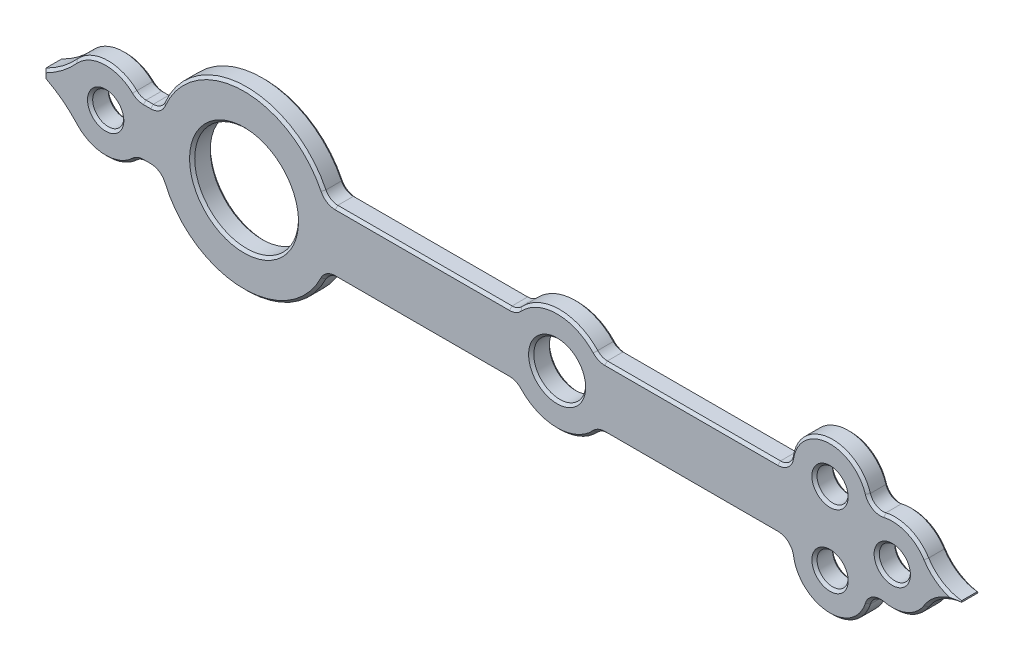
ISO-10303-21;
HEADER;
FILE_DESCRIPTION(('STEP AP214'),'2;1');
FILE_NAME('part.step','',(''),(''),'','','');
FILE_SCHEMA(('AUTOMOTIVE_DESIGN { 1 0 10303 214 1 1 1 1 }'));
ENDSEC;
DATA;
#1=APPLICATION_CONTEXT('core data for automotive mechanical design processes');
#2=APPLICATION_PROTOCOL_DEFINITION('international standard','automotive_design',2000,#1);
#3=PRODUCT_CONTEXT('',#1,'mechanical');
#4=PRODUCT('Part','Part','',(#3));
#5=PRODUCT_RELATED_PRODUCT_CATEGORY('part','',(#4));
#6=PRODUCT_DEFINITION_FORMATION('','',#4);
#7=PRODUCT_DEFINITION_CONTEXT('part definition',#1,'design');
#8=PRODUCT_DEFINITION('design','',#6,#7);
#9=PRODUCT_DEFINITION_SHAPE('','',#8);
#10=(LENGTH_UNIT() NAMED_UNIT(*) SI_UNIT(.MILLI.,.METRE.));
#11=(NAMED_UNIT(*) PLANE_ANGLE_UNIT() SI_UNIT($,.RADIAN.));
#12=(NAMED_UNIT(*) SI_UNIT($,.STERADIAN.) SOLID_ANGLE_UNIT());
#13=UNCERTAINTY_MEASURE_WITH_UNIT(LENGTH_MEASURE(1.E-05),#10,'distance_accuracy_value','');
#14=(GEOMETRIC_REPRESENTATION_CONTEXT(3) GLOBAL_UNCERTAINTY_ASSIGNED_CONTEXT((#13)) GLOBAL_UNIT_ASSIGNED_CONTEXT((#10,
#11,#12)) REPRESENTATION_CONTEXT('',''));
#15=CARTESIAN_POINT('',(0.,0.,0.));
#16=DIRECTION('',(0.,0.,1.));
#17=DIRECTION('',(1.,0.,0.));
#18=AXIS2_PLACEMENT_3D('',#15,#16,#17);
#19=CARTESIAN_POINT('',(26.3,-3.5,2.));
#20=DIRECTION('',(0.,0.,-1.));
#21=DIRECTION('',(-1.,0.,0.));
#22=AXIS2_PLACEMENT_3D('',#19,#20,#21);
#23=PLANE('',#22);
#24=CARTESIAN_POINT('',(0.,0.,2.));
#25=DIRECTION('',(0.,0.,-1.));
#26=DIRECTION('',(-1.,0.,0.));
#27=AXIS2_PLACEMENT_3D('',#24,#25,#26);
#28=CIRCLE('',#27,2.75000000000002);
#29=CARTESIAN_POINT('',(-2.75000000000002,0.,2.));
#30=VERTEX_POINT('',#29);
#31=EDGE_CURVE('E11',#30,#30,#28,.T.);
#32=ORIENTED_EDGE('',*,*,#31,.T.);
#33=EDGE_LOOP('',(#32));
#34=FACE_BOUND('',#33,.T.);
#35=CARTESIAN_POINT('',(-43.5095,0.,2.));
#36=DIRECTION('',(0.,0.,-1.));
#37=DIRECTION('',(-1.,0.,0.));
#38=AXIS2_PLACEMENT_3D('',#35,#36,#37);
#39=CIRCLE('',#38,1.75000000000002);
#40=CARTESIAN_POINT('',(-45.2595,0.,2.));
#41=VERTEX_POINT('',#40);
#42=EDGE_CURVE('E40',#41,#41,#39,.T.);
#43=ORIENTED_EDGE('',*,*,#42,.T.);
#44=EDGE_LOOP('',(#43));
#45=FACE_BOUND('',#44,.T.);
#46=CARTESIAN_POINT('',(26.3,-3.5,2.));
#47=DIRECTION('',(0.,0.,-1.));
#48=DIRECTION('',(-1.,0.,0.));
#49=AXIS2_PLACEMENT_3D('',#46,#47,#48);
#50=CIRCLE('',#49,1.75000000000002);
#51=CARTESIAN_POINT('',(24.55,-3.5,2.));
#52=VERTEX_POINT('',#51);
#53=EDGE_CURVE('E1253',#52,#52,#50,.T.);
#54=ORIENTED_EDGE('',*,*,#53,.T.);
#55=EDGE_LOOP('',(#54));
#56=FACE_BOUND('',#55,.T.);
#57=DIRECTION('',(1.,0.,0.));
#58=VECTOR('',#57,1.);
#59=CARTESIAN_POINT('',(26.3,-2.74999999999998,2.));
#60=LINE('',#59,#58);
#61=CARTESIAN_POINT('',(4.5912961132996,-2.74999999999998,2.));
#62=VERTEX_POINT('',#61);
#63=CARTESIAN_POINT('',(21.2786953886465,-2.74999999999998,2.));
#64=VERTEX_POINT('',#63);
#65=EDGE_CURVE('E48',#62,#64,#60,.T.);
#66=ORIENTED_EDGE('',*,*,#65,.T.);
#67=CARTESIAN_POINT('',(21.2786953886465,-4.27,2.));
#68=DIRECTION('',(0.,0.,-1.));
#69=DIRECTION('',(-1.,0.,0.));
#70=AXIS2_PLACEMENT_3D('',#67,#68,#69);
#71=CIRCLE('',#70,1.52000000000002);
#72=CARTESIAN_POINT('',(22.781132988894,-4.0396062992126,2.));
#73=VERTEX_POINT('',#72);
#74=EDGE_CURVE('E1251',#64,#73,#71,.T.);
#75=ORIENTED_EDGE('',*,*,#74,.T.);
#76=CARTESIAN_POINT('',(26.3,-3.5,2.));
#77=DIRECTION('',(0.,0.,-1.));
#78=DIRECTION('',(-1.,0.,0.));
#79=AXIS2_PLACEMENT_3D('',#76,#77,#78);
#80=CIRCLE('',#79,3.55999999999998);
#81=CARTESIAN_POINT('',(29.7032866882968,-4.54462419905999,2.));
#82=VERTEX_POINT('',#81);
#83=EDGE_CURVE('E1185',#73,#82,#80,.F.);
#84=ORIENTED_EDGE('',*,*,#83,.T.);
#85=CARTESIAN_POINT('',(31.1563753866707,-4.99064352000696,2.));
#86=DIRECTION('',(0.,0.,-1.));
#87=DIRECTION('',(-1.,0.,0.));
#88=AXIS2_PLACEMENT_3D('',#85,#86,#87);
#89=CIRCLE('',#88,1.52000000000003);
#90=CARTESIAN_POINT('',(31.4958889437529,-3.50904622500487,2.));
#91=VERTEX_POINT('',#90);
#92=EDGE_CURVE('E1187',#82,#91,#89,.T.);
#93=ORIENTED_EDGE('',*,*,#92,.T.);
#94=CARTESIAN_POINT('',(32.3,0.,2.));
#95=DIRECTION('',(0.,0.,-1.));
#96=DIRECTION('',(-1.,0.,0.));
#97=AXIS2_PLACEMENT_3D('',#94,#95,#96);
#98=CIRCLE('',#97,3.59999999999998);
#99=CARTESIAN_POINT('',(35.351199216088,-1.91054530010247,2.));
#100=VERTEX_POINT('',#99);
#101=EDGE_CURVE('E1189',#91,#100,#98,.F.);
#102=ORIENTED_EDGE('',*,*,#101,.T.);
#103=CARTESIAN_POINT('',(39.1651982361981,-4.2987269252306,2.));
#104=DIRECTION('',(0.,0.,-1.));
#105=DIRECTION('',(-1.,0.,0.));
#106=AXIS2_PLACEMENT_3D('',#103,#104,#105);
#107=CIRCLE('',#106,4.50000000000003);
#108=CARTESIAN_POINT('',(37.8344289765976,0.,2.));
#109=VERTEX_POINT('',#108);
#110=EDGE_CURVE('E1191',#100,#109,#107,.T.);
#111=ORIENTED_EDGE('',*,*,#110,.T.);
#112=CARTESIAN_POINT('',(39.1651982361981,4.2987269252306,2.));
#113=DIRECTION('',(0.,0.,-1.));
#114=DIRECTION('',(-1.,0.,0.));
#115=AXIS2_PLACEMENT_3D('',#112,#113,#114);
#116=CIRCLE('',#115,4.50000000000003);
#117=CARTESIAN_POINT('',(35.351199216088,1.91054530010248,2.));
#118=VERTEX_POINT('',#117);
#119=EDGE_CURVE('E1193',#109,#118,#116,.T.);
#120=ORIENTED_EDGE('',*,*,#119,.T.);
#121=CARTESIAN_POINT('',(32.3,0.,2.));
#122=DIRECTION('',(0.,0.,-1.));
#123=DIRECTION('',(-1.,0.,0.));
#124=AXIS2_PLACEMENT_3D('',#121,#122,#123);
#125=CIRCLE('',#124,3.59999999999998);
#126=CARTESIAN_POINT('',(31.4958889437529,3.50904622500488,2.));
#127=VERTEX_POINT('',#126);
#128=EDGE_CURVE('E1195',#118,#127,#125,.F.);
#129=ORIENTED_EDGE('',*,*,#128,.T.);
#130=CARTESIAN_POINT('',(31.1563753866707,4.99064352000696,2.));
#131=DIRECTION('',(0.,0.,-1.));
#132=DIRECTION('',(-1.,0.,0.));
#133=AXIS2_PLACEMENT_3D('',#130,#131,#132);
#134=CIRCLE('',#133,1.52000000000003);
#135=CARTESIAN_POINT('',(29.7032866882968,4.54462419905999,2.));
#136=VERTEX_POINT('',#135);
#137=EDGE_CURVE('E1197',#127,#136,#134,.T.);
#138=ORIENTED_EDGE('',*,*,#137,.T.);
#139=CARTESIAN_POINT('',(26.3,3.5,2.));
#140=DIRECTION('',(0.,0.,-1.));
#141=DIRECTION('',(-1.,0.,0.));
#142=AXIS2_PLACEMENT_3D('',#139,#140,#141);
#143=CIRCLE('',#142,3.55999999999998);
#144=CARTESIAN_POINT('',(22.781132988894,4.0396062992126,2.));
#145=VERTEX_POINT('',#144);
#146=EDGE_CURVE('E1199',#136,#145,#143,.F.);
#147=ORIENTED_EDGE('',*,*,#146,.T.);
#148=CARTESIAN_POINT('',(21.2786953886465,4.27,2.));
#149=DIRECTION('',(0.,0.,-1.));
#150=DIRECTION('',(-1.,0.,0.));
#151=AXIS2_PLACEMENT_3D('',#148,#149,#150);
#152=CIRCLE('',#151,1.52000000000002);
#153=CARTESIAN_POINT('',(21.2786953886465,2.74999999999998,2.));
#154=VERTEX_POINT('',#153);
#155=EDGE_CURVE('E1201',#145,#154,#152,.T.);
#156=ORIENTED_EDGE('',*,*,#155,.T.);
#157=DIRECTION('',(-1.,0.,0.));
#158=VECTOR('',#157,1.);
#159=CARTESIAN_POINT('',(26.3,2.74999999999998,2.));
#160=LINE('',#159,#158);
#161=CARTESIAN_POINT('',(4.5912961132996,2.74999999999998,2.));
#162=VERTEX_POINT('',#161);
#163=EDGE_CURVE('E1203',#154,#162,#160,.T.);
#164=ORIENTED_EDGE('',*,*,#163,.T.);
#165=CARTESIAN_POINT('',(4.5912961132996,4.27,2.));
#166=DIRECTION('',(0.,0.,-1.));
#167=DIRECTION('',(-1.,0.,0.));
#168=AXIS2_PLACEMENT_3D('',#165,#166,#167);
#169=CIRCLE('',#168,1.52000000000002);
#170=CARTESIAN_POINT('',(3.47825463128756,3.23484848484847,2.));
#171=VERTEX_POINT('',#170);
#172=EDGE_CURVE('E1205',#162,#171,#169,.T.);
#173=ORIENTED_EDGE('',*,*,#172,.T.);
#174=CARTESIAN_POINT('',(0.,0.,2.));
#175=DIRECTION('',(0.,0.,-1.));
#176=DIRECTION('',(-1.,0.,0.));
#177=AXIS2_PLACEMENT_3D('',#174,#175,#176);
#178=CIRCLE('',#177,4.74999999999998);
#179=CARTESIAN_POINT('',(-3.47825463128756,3.23484848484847,2.));
#180=VERTEX_POINT('',#179);
#181=EDGE_CURVE('E1207',#171,#180,#178,.F.);
#182=ORIENTED_EDGE('',*,*,#181,.T.);
#183=CARTESIAN_POINT('',(-4.5912961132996,4.27,2.));
#184=DIRECTION('',(0.,0.,-1.));
#185=DIRECTION('',(-1.,0.,0.));
#186=AXIS2_PLACEMENT_3D('',#183,#184,#185);
#187=CIRCLE('',#186,1.52000000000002);
#188=CARTESIAN_POINT('',(-4.5912961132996,2.74999999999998,2.));
#189=VERTEX_POINT('',#188);
#190=EDGE_CURVE('E1209',#180,#189,#187,.T.);
#191=ORIENTED_EDGE('',*,*,#190,.T.);
#192=DIRECTION('',(-1.,0.,0.));
#193=VECTOR('',#192,1.);
#194=CARTESIAN_POINT('',(26.3,2.74999999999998,2.));
#195=LINE('',#194,#193);
#196=CARTESIAN_POINT('',(-21.3870088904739,2.74999999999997,2.));
#197=VERTEX_POINT('',#196);
#198=EDGE_CURVE('E1211',#189,#197,#195,.T.);
#199=ORIENTED_EDGE('',*,*,#198,.T.);
#200=CARTESIAN_POINT('',(-21.3870088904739,4.27,2.));
#201=DIRECTION('',(0.,0.,-1.));
#202=DIRECTION('',(-1.,0.,0.));
#203=AXIS2_PLACEMENT_3D('',#200,#201,#202);
#204=CIRCLE('',#203,1.52000000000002);
#205=CARTESIAN_POINT('',(-22.7541518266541,3.60568065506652,2.));
#206=VERTEX_POINT('',#205);
#207=EDGE_CURVE('E1213',#197,#206,#204,.T.);
#208=ORIENTED_EDGE('',*,*,#207,.T.);
#209=CARTESIAN_POINT('',(-30.1745,0.,2.));
#210=DIRECTION('',(0.,0.,-1.));
#211=DIRECTION('',(-1.,0.,0.));
#212=AXIS2_PLACEMENT_3D('',#209,#210,#211);
#213=CIRCLE('',#212,8.24999999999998);
#214=CARTESIAN_POINT('',(-37.7713298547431,3.21724667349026,2.));
#215=VERTEX_POINT('',#214);
#216=EDGE_CURVE('E1215',#206,#215,#213,.F.);
#217=ORIENTED_EDGE('',*,*,#216,.T.);
#218=CARTESIAN_POINT('',(-39.1709882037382,3.81,2.));
#219=DIRECTION('',(0.,0.,-1.));
#220=DIRECTION('',(-1.,0.,0.));
#221=AXIS2_PLACEMENT_3D('',#218,#219,#220);
#222=CIRCLE('',#221,1.52000000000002);
#223=CARTESIAN_POINT('',(-39.1709882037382,2.28999999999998,2.));
#224=VERTEX_POINT('',#223);
#225=EDGE_CURVE('E1217',#215,#224,#222,.T.);
#226=ORIENTED_EDGE('',*,*,#225,.T.);
#227=DIRECTION('',(-1.,0.,0.));
#228=VECTOR('',#227,1.);
#229=CARTESIAN_POINT('',(26.3,2.28999999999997,2.));
#230=LINE('',#229,#228);
#231=CARTESIAN_POINT('',(-39.8685111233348,2.28999999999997,2.));
#232=VERTEX_POINT('',#231);
#233=EDGE_CURVE('E1219',#224,#232,#230,.T.);
#234=ORIENTED_EDGE('',*,*,#233,.T.);
#235=CARTESIAN_POINT('',(-39.8685111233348,3.81,2.));
#236=DIRECTION('',(0.,0.,-1.));
#237=DIRECTION('',(-1.,0.,0.));
#238=AXIS2_PLACEMENT_3D('',#235,#236,#237);
#239=CIRCLE('',#238,1.52000000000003);
#240=CARTESIAN_POINT('',(-40.9186635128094,2.71110056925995,2.));
#241=VERTEX_POINT('',#240);
#242=EDGE_CURVE('E1221',#232,#241,#239,.T.);
#243=ORIENTED_EDGE('',*,*,#242,.T.);
#244=CARTESIAN_POINT('',(-43.5095,0.,2.));
#245=DIRECTION('',(0.,0.,-1.));
#246=DIRECTION('',(-1.,0.,0.));
#247=AXIS2_PLACEMENT_3D('',#244,#245,#246);
#248=CIRCLE('',#247,3.74999999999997);
#249=CARTESIAN_POINT('',(-46.291892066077,2.51411900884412,2.));
#250=VERTEX_POINT('',#249);
#251=EDGE_CURVE('E1223',#241,#250,#248,.F.);
#252=ORIENTED_EDGE('',*,*,#251,.T.);
#253=CARTESIAN_POINT('',(-53.8970970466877,9.38604429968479,2.));
#254=DIRECTION('',(0.,0.,-1.));
#255=DIRECTION('',(-1.,0.,0.));
#256=AXIS2_PLACEMENT_3D('',#253,#254,#255);
#257=CIRCLE('',#256,10.25);
#258=CARTESIAN_POINT('',(-49.2595,0.245191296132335,2.));
#259=VERTEX_POINT('',#258);
#260=EDGE_CURVE('E1225',#250,#259,#257,.T.);
#261=ORIENTED_EDGE('',*,*,#260,.T.);
#262=DIRECTION('',(0.,-1.,0.));
#263=VECTOR('',#262,1.);
#264=CARTESIAN_POINT('',(-49.2595,-3.5,2.));
#265=LINE('',#264,#263);
#266=CARTESIAN_POINT('',(-49.2595,-0.245191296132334,2.));
#267=VERTEX_POINT('',#266);
#268=EDGE_CURVE('E1227',#259,#267,#265,.T.);
#269=ORIENTED_EDGE('',*,*,#268,.T.);
#270=CARTESIAN_POINT('',(-53.8970970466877,-9.38604429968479,2.));
#271=DIRECTION('',(0.,0.,-1.));
#272=DIRECTION('',(-1.,0.,0.));
#273=AXIS2_PLACEMENT_3D('',#270,#271,#272);
#274=CIRCLE('',#273,10.25);
#275=CARTESIAN_POINT('',(-46.291892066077,-2.51411900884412,2.));
#276=VERTEX_POINT('',#275);
#277=EDGE_CURVE('E1229',#267,#276,#274,.T.);
#278=ORIENTED_EDGE('',*,*,#277,.T.);
#279=CARTESIAN_POINT('',(-43.5095,0.,2.));
#280=DIRECTION('',(0.,0.,-1.));
#281=DIRECTION('',(-1.,0.,0.));
#282=AXIS2_PLACEMENT_3D('',#279,#280,#281);
#283=CIRCLE('',#282,3.74999999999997);
#284=CARTESIAN_POINT('',(-40.9186635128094,-2.71110056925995,2.));
#285=VERTEX_POINT('',#284);
#286=EDGE_CURVE('E1231',#276,#285,#283,.F.);
#287=ORIENTED_EDGE('',*,*,#286,.T.);
#288=CARTESIAN_POINT('',(-39.8685111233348,-3.81,2.));
#289=DIRECTION('',(0.,0.,-1.));
#290=DIRECTION('',(-1.,0.,0.));
#291=AXIS2_PLACEMENT_3D('',#288,#289,#290);
#292=CIRCLE('',#291,1.52000000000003);
#293=CARTESIAN_POINT('',(-39.8685111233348,-2.28999999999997,2.));
#294=VERTEX_POINT('',#293);
#295=EDGE_CURVE('E1233',#285,#294,#292,.T.);
#296=ORIENTED_EDGE('',*,*,#295,.T.);
#297=DIRECTION('',(1.,0.,0.));
#298=VECTOR('',#297,1.);
#299=CARTESIAN_POINT('',(26.3,-2.28999999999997,2.));
#300=LINE('',#299,#298);
#301=CARTESIAN_POINT('',(-39.1709882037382,-2.28999999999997,2.));
#302=VERTEX_POINT('',#301);
#303=EDGE_CURVE('E1235',#294,#302,#300,.T.);
#304=ORIENTED_EDGE('',*,*,#303,.T.);
#305=CARTESIAN_POINT('',(-39.1709882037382,-3.81,2.));
#306=DIRECTION('',(0.,0.,-1.));
#307=DIRECTION('',(-1.,0.,0.));
#308=AXIS2_PLACEMENT_3D('',#305,#306,#307);
#309=CIRCLE('',#308,1.52000000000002);
#310=CARTESIAN_POINT('',(-37.7713298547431,-3.21724667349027,2.));
#311=VERTEX_POINT('',#310);
#312=EDGE_CURVE('E1237',#302,#311,#309,.T.);
#313=ORIENTED_EDGE('',*,*,#312,.T.);
#314=CARTESIAN_POINT('',(-30.1745,0.,2.));
#315=DIRECTION('',(0.,0.,-1.));
#316=DIRECTION('',(-1.,0.,0.));
#317=AXIS2_PLACEMENT_3D('',#314,#315,#316);
#318=CIRCLE('',#317,8.24999999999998);
#319=CARTESIAN_POINT('',(-22.754151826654,-3.60568065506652,2.));
#320=VERTEX_POINT('',#319);
#321=EDGE_CURVE('E1239',#311,#320,#318,.F.);
#322=ORIENTED_EDGE('',*,*,#321,.T.);
#323=CARTESIAN_POINT('',(-21.3870088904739,-4.27,2.));
#324=DIRECTION('',(0.,0.,-1.));
#325=DIRECTION('',(-1.,0.,0.));
#326=AXIS2_PLACEMENT_3D('',#323,#324,#325);
#327=CIRCLE('',#326,1.52000000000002);
#328=CARTESIAN_POINT('',(-21.3870088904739,-2.74999999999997,2.));
#329=VERTEX_POINT('',#328);
#330=EDGE_CURVE('E1241',#320,#329,#327,.T.);
#331=ORIENTED_EDGE('',*,*,#330,.T.);
#332=DIRECTION('',(1.,0.,0.));
#333=VECTOR('',#332,1.);
#334=CARTESIAN_POINT('',(26.3,-2.74999999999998,2.));
#335=LINE('',#334,#333);
#336=CARTESIAN_POINT('',(-4.5912961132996,-2.74999999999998,2.));
#337=VERTEX_POINT('',#336);
#338=EDGE_CURVE('E1243',#329,#337,#335,.T.);
#339=ORIENTED_EDGE('',*,*,#338,.T.);
#340=CARTESIAN_POINT('',(-4.5912961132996,-4.27,2.));
#341=DIRECTION('',(0.,0.,-1.));
#342=DIRECTION('',(-1.,0.,0.));
#343=AXIS2_PLACEMENT_3D('',#340,#341,#342);
#344=CIRCLE('',#343,1.52000000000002);
#345=CARTESIAN_POINT('',(-3.47825463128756,-3.23484848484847,2.));
#346=VERTEX_POINT('',#345);
#347=EDGE_CURVE('E1245',#337,#346,#344,.T.);
#348=ORIENTED_EDGE('',*,*,#347,.T.);
#349=CARTESIAN_POINT('',(0.,0.,2.));
#350=DIRECTION('',(0.,0.,-1.));
#351=DIRECTION('',(-1.,0.,0.));
#352=AXIS2_PLACEMENT_3D('',#349,#350,#351);
#353=CIRCLE('',#352,4.74999999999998);
#354=CARTESIAN_POINT('',(3.47825463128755,-3.23484848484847,2.));
#355=VERTEX_POINT('',#354);
#356=EDGE_CURVE('E1247',#346,#355,#353,.F.);
#357=ORIENTED_EDGE('',*,*,#356,.T.);
#358=CARTESIAN_POINT('',(4.5912961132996,-4.27,2.));
#359=DIRECTION('',(0.,0.,-1.));
#360=DIRECTION('',(-1.,0.,0.));
#361=AXIS2_PLACEMENT_3D('',#358,#359,#360);
#362=CIRCLE('',#361,1.52000000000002);
#363=EDGE_CURVE('E53',#355,#62,#362,.T.);
#364=ORIENTED_EDGE('',*,*,#363,.T.);
#365=EDGE_LOOP('',(#66,#75,#84,#93,#102,#111,#120,#129,#138,#147,#156,#164,#173,#182,#191,#199,
#208,#217,#226,#234,#243,#252,#261,#269,#278,#287,#296,#304,#313,#322,#331,#339,#348,#357,#364));
#366=FACE_BOUND('',#365,.T.);
#367=CARTESIAN_POINT('',(32.3,0.,2.));
#368=DIRECTION('',(0.,0.,-1.));
#369=DIRECTION('',(-1.,0.,0.));
#370=AXIS2_PLACEMENT_3D('',#367,#368,#369);
#371=CIRCLE('',#370,1.75000000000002);
#372=CARTESIAN_POINT('',(30.55,0.,2.));
#373=VERTEX_POINT('',#372);
#374=EDGE_CURVE('E1182',#373,#373,#371,.T.);
#375=ORIENTED_EDGE('',*,*,#374,.T.);
#376=EDGE_LOOP('',(#375));
#377=FACE_BOUND('',#376,.T.);
#378=CARTESIAN_POINT('',(-30.1745,0.,2.));
#379=DIRECTION('',(0.,0.,-1.));
#380=DIRECTION('',(-1.,0.,0.));
#381=AXIS2_PLACEMENT_3D('',#378,#379,#380);
#382=CIRCLE('',#381,5.25000000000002);
#383=CARTESIAN_POINT('',(-35.4245,0.,2.));
#384=VERTEX_POINT('',#383);
#385=EDGE_CURVE('E1179',#384,#384,#382,.T.);
#386=ORIENTED_EDGE('',*,*,#385,.T.);
#387=EDGE_LOOP('',(#386));
#388=FACE_BOUND('',#387,.T.);
#389=CARTESIAN_POINT('',(26.3,3.5,2.));
#390=DIRECTION('',(0.,0.,-1.));
#391=DIRECTION('',(-1.,0.,0.));
#392=AXIS2_PLACEMENT_3D('',#389,#390,#391);
#393=CIRCLE('',#392,1.75000000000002);
#394=CARTESIAN_POINT('',(24.55,3.5,2.));
#395=VERTEX_POINT('',#394);
#396=EDGE_CURVE('E1176',#395,#395,#393,.T.);
#397=ORIENTED_EDGE('',*,*,#396,.T.);
#398=EDGE_LOOP('',(#397));
#399=FACE_BOUND('',#398,.T.);
#400=ADVANCED_FACE('F31',(#34,#45,#56,#366,#377,#388,#399),#23,.F.);
#401=CARTESIAN_POINT('',(26.3,-3.5,0.));
#402=DIRECTION('',(0.,0.,-1.));
#403=DIRECTION('',(-1.,0.,0.));
#404=AXIS2_PLACEMENT_3D('',#401,#402,#403);
#405=PLANE('',#404);
#406=CARTESIAN_POINT('',(0.,0.,0.));
#407=DIRECTION('',(0.,0.,-1.));
#408=DIRECTION('',(-1.,0.,0.));
#409=AXIS2_PLACEMENT_3D('',#406,#407,#408);
#410=CIRCLE('',#409,2.75);
#411=CARTESIAN_POINT('',(-2.75,0.,0.));
#412=VERTEX_POINT('',#411);
#413=EDGE_CURVE('E521',#412,#412,#410,.F.);
#414=ORIENTED_EDGE('',*,*,#413,.T.);
#415=EDGE_LOOP('',(#414));
#416=FACE_BOUND('',#415,.T.);
#417=CARTESIAN_POINT('',(-43.5095,0.,0.));
#418=DIRECTION('',(0.,0.,-1.));
#419=DIRECTION('',(-1.,0.,0.));
#420=AXIS2_PLACEMENT_3D('',#417,#418,#419);
#421=CIRCLE('',#420,1.75);
#422=CARTESIAN_POINT('',(-45.2595,0.,0.));
#423=VERTEX_POINT('',#422);
#424=EDGE_CURVE('E513',#423,#423,#421,.F.);
#425=ORIENTED_EDGE('',*,*,#424,.T.);
#426=EDGE_LOOP('',(#425));
#427=FACE_BOUND('',#426,.T.);
#428=CARTESIAN_POINT('',(26.3,-3.5,0.));
#429=DIRECTION('',(0.,0.,-1.));
#430=DIRECTION('',(-1.,0.,0.));
#431=AXIS2_PLACEMENT_3D('',#428,#429,#430);
#432=CIRCLE('',#431,1.75000000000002);
#433=CARTESIAN_POINT('',(24.55,-3.5,0.));
#434=VERTEX_POINT('',#433);
#435=EDGE_CURVE('E510',#434,#434,#432,.F.);
#436=ORIENTED_EDGE('',*,*,#435,.T.);
#437=EDGE_LOOP('',(#436));
#438=FACE_BOUND('',#437,.T.);
#439=CARTESIAN_POINT('',(32.3,0.,0.));
#440=DIRECTION('',(0.,0.,-1.));
#441=DIRECTION('',(-1.,0.,0.));
#442=AXIS2_PLACEMENT_3D('',#439,#440,#441);
#443=CIRCLE('',#442,3.6);
#444=CARTESIAN_POINT('',(35.351199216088,-1.91054530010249,0.));
#445=VERTEX_POINT('',#444);
#446=CARTESIAN_POINT('',(31.4958889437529,-3.50904622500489,0.));
#447=VERTEX_POINT('',#446);
#448=EDGE_CURVE('E509',#445,#447,#443,.T.);
#449=ORIENTED_EDGE('',*,*,#448,.T.);
#450=CARTESIAN_POINT('',(31.1563753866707,-4.99064352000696,0.));
#451=DIRECTION('',(0.,0.,-1.));
#452=DIRECTION('',(-1.,0.,0.));
#453=AXIS2_PLACEMENT_3D('',#450,#451,#452);
#454=CIRCLE('',#453,1.52);
#455=CARTESIAN_POINT('',(29.7032866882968,-4.54462419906,0.));
#456=VERTEX_POINT('',#455);
#457=EDGE_CURVE('E487',#447,#456,#454,.F.);
#458=ORIENTED_EDGE('',*,*,#457,.T.);
#459=CARTESIAN_POINT('',(26.3,-3.5,0.));
#460=DIRECTION('',(0.,0.,-1.));
#461=DIRECTION('',(-1.,0.,0.));
#462=AXIS2_PLACEMENT_3D('',#459,#460,#461);
#463=CIRCLE('',#462,3.56);
#464=CARTESIAN_POINT('',(22.781132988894,-4.0396062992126,0.));
#465=VERTEX_POINT('',#464);
#466=EDGE_CURVE('E497',#456,#465,#463,.T.);
#467=ORIENTED_EDGE('',*,*,#466,.T.);
#468=CARTESIAN_POINT('',(21.2786953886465,-4.27,0.));
#469=DIRECTION('',(0.,0.,-1.));
#470=DIRECTION('',(-1.,0.,0.));
#471=AXIS2_PLACEMENT_3D('',#468,#469,#470);
#472=CIRCLE('',#471,1.52);
#473=CARTESIAN_POINT('',(21.2786953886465,-2.75,0.));
#474=VERTEX_POINT('',#473);
#475=EDGE_CURVE('E503',#465,#474,#472,.F.);
#476=ORIENTED_EDGE('',*,*,#475,.T.);
#477=DIRECTION('',(-1.,0.,0.));
#478=VECTOR('',#477,1.);
#479=CARTESIAN_POINT('',(4.5912961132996,-2.75,0.));
#480=LINE('',#479,#478);
#481=CARTESIAN_POINT('',(4.5912961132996,-2.75,0.));
#482=VERTEX_POINT('',#481);
#483=EDGE_CURVE('E958',#474,#482,#480,.T.);
#484=ORIENTED_EDGE('',*,*,#483,.T.);
#485=CARTESIAN_POINT('',(4.5912961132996,-4.27,0.));
#486=DIRECTION('',(0.,0.,-1.));
#487=DIRECTION('',(-1.,0.,0.));
#488=AXIS2_PLACEMENT_3D('',#485,#486,#487);
#489=CIRCLE('',#488,1.52);
#490=CARTESIAN_POINT('',(3.47825463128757,-3.23484848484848,0.));
#491=VERTEX_POINT('',#490);
#492=EDGE_CURVE('E960',#482,#491,#489,.F.);
#493=ORIENTED_EDGE('',*,*,#492,.T.);
#494=CARTESIAN_POINT('',(0.,0.,0.));
#495=DIRECTION('',(0.,0.,-1.));
#496=DIRECTION('',(-1.,0.,0.));
#497=AXIS2_PLACEMENT_3D('',#494,#495,#496);
#498=CIRCLE('',#497,4.75);
#499=CARTESIAN_POINT('',(-3.47825463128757,-3.23484848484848,0.));
#500=VERTEX_POINT('',#499);
#501=EDGE_CURVE('E962',#491,#500,#498,.T.);
#502=ORIENTED_EDGE('',*,*,#501,.T.);
#503=CARTESIAN_POINT('',(-4.5912961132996,-4.27,0.));
#504=DIRECTION('',(0.,0.,-1.));
#505=DIRECTION('',(-1.,0.,0.));
#506=AXIS2_PLACEMENT_3D('',#503,#504,#505);
#507=CIRCLE('',#506,1.52);
#508=CARTESIAN_POINT('',(-4.5912961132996,-2.75,0.));
#509=VERTEX_POINT('',#508);
#510=EDGE_CURVE('E964',#500,#509,#507,.F.);
#511=ORIENTED_EDGE('',*,*,#510,.T.);
#512=DIRECTION('',(-1.,0.,0.));
#513=VECTOR('',#512,1.);
#514=CARTESIAN_POINT('',(-21.3870088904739,-2.74999999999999,0.));
#515=LINE('',#514,#513);
#516=CARTESIAN_POINT('',(-21.3870088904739,-2.74999999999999,0.));
#517=VERTEX_POINT('',#516);
#518=EDGE_CURVE('E966',#509,#517,#515,.T.);
#519=ORIENTED_EDGE('',*,*,#518,.T.);
#520=CARTESIAN_POINT('',(-21.3870088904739,-4.27,0.));
#521=DIRECTION('',(0.,0.,-1.));
#522=DIRECTION('',(-1.,0.,0.));
#523=AXIS2_PLACEMENT_3D('',#520,#521,#522);
#524=CIRCLE('',#523,1.52);
#525=CARTESIAN_POINT('',(-22.754151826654,-3.60568065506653,0.));
#526=VERTEX_POINT('',#525);
#527=EDGE_CURVE('E968',#517,#526,#524,.F.);
#528=ORIENTED_EDGE('',*,*,#527,.T.);
#529=CARTESIAN_POINT('',(-30.1745,0.,0.));
#530=DIRECTION('',(0.,0.,-1.));
#531=DIRECTION('',(-1.,0.,0.));
#532=AXIS2_PLACEMENT_3D('',#529,#530,#531);
#533=CIRCLE('',#532,8.25);
#534=CARTESIAN_POINT('',(-37.7713298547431,-3.21724667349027,0.));
#535=VERTEX_POINT('',#534);
#536=EDGE_CURVE('E970',#526,#535,#533,.T.);
#537=ORIENTED_EDGE('',*,*,#536,.T.);
#538=CARTESIAN_POINT('',(-39.1709882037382,-3.81,0.));
#539=DIRECTION('',(0.,0.,-1.));
#540=DIRECTION('',(-1.,0.,0.));
#541=AXIS2_PLACEMENT_3D('',#538,#539,#540);
#542=CIRCLE('',#541,1.52000000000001);
#543=CARTESIAN_POINT('',(-39.1709882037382,-2.28999999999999,0.));
#544=VERTEX_POINT('',#543);
#545=EDGE_CURVE('E972',#535,#544,#542,.F.);
#546=ORIENTED_EDGE('',*,*,#545,.T.);
#547=DIRECTION('',(-1.,0.,0.));
#548=VECTOR('',#547,1.);
#549=CARTESIAN_POINT('',(-39.8685111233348,-2.29,0.));
#550=LINE('',#549,#548);
#551=CARTESIAN_POINT('',(-39.8685111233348,-2.29,0.));
#552=VERTEX_POINT('',#551);
#553=EDGE_CURVE('E974',#544,#552,#550,.T.);
#554=ORIENTED_EDGE('',*,*,#553,.T.);
#555=CARTESIAN_POINT('',(-39.8685111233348,-3.81,0.));
#556=DIRECTION('',(0.,0.,-1.));
#557=DIRECTION('',(-1.,0.,0.));
#558=AXIS2_PLACEMENT_3D('',#555,#556,#557);
#559=CIRCLE('',#558,1.52000000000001);
#560=CARTESIAN_POINT('',(-40.9186635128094,-2.71110056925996,0.));
#561=VERTEX_POINT('',#560);
#562=EDGE_CURVE('E976',#552,#561,#559,.F.);
#563=ORIENTED_EDGE('',*,*,#562,.T.);
#564=CARTESIAN_POINT('',(-43.5095,0.,0.));
#565=DIRECTION('',(0.,0.,-1.));
#566=DIRECTION('',(-1.,0.,0.));
#567=AXIS2_PLACEMENT_3D('',#564,#565,#566);
#568=CIRCLE('',#567,3.74999999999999);
#569=CARTESIAN_POINT('',(-46.2918920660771,-2.51411900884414,0.));
#570=VERTEX_POINT('',#569);
#571=EDGE_CURVE('E978',#561,#570,#568,.T.);
#572=ORIENTED_EDGE('',*,*,#571,.T.);
#573=CARTESIAN_POINT('',(-53.8970970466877,-9.38604429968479,0.));
#574=DIRECTION('',(0.,0.,-1.));
#575=DIRECTION('',(-1.,0.,0.));
#576=AXIS2_PLACEMENT_3D('',#573,#574,#575);
#577=CIRCLE('',#576,10.25);
#578=CARTESIAN_POINT('',(-49.2595,-0.245191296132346,0.));
#579=VERTEX_POINT('',#578);
#580=EDGE_CURVE('E980',#570,#579,#577,.F.);
#581=ORIENTED_EDGE('',*,*,#580,.T.);
#582=DIRECTION('',(0.,1.,0.));
#583=VECTOR('',#582,1.);
#584=CARTESIAN_POINT('',(-49.2595,0.399999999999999,0.));
#585=LINE('',#584,#583);
#586=CARTESIAN_POINT('',(-49.2595,0.245191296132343,0.));
#587=VERTEX_POINT('',#586);
#588=EDGE_CURVE('E982',#579,#587,#585,.T.);
#589=ORIENTED_EDGE('',*,*,#588,.T.);
#590=CARTESIAN_POINT('',(-53.8970970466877,9.38604429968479,0.));
#591=DIRECTION('',(0.,0.,-1.));
#592=DIRECTION('',(-1.,0.,0.));
#593=AXIS2_PLACEMENT_3D('',#590,#591,#592);
#594=CIRCLE('',#593,10.25);
#595=CARTESIAN_POINT('',(-46.2918920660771,2.51411900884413,0.));
#596=VERTEX_POINT('',#595);
#597=EDGE_CURVE('E984',#587,#596,#594,.F.);
#598=ORIENTED_EDGE('',*,*,#597,.T.);
#599=CARTESIAN_POINT('',(-43.5095,0.,0.));
#600=DIRECTION('',(0.,0.,-1.));
#601=DIRECTION('',(-1.,0.,0.));
#602=AXIS2_PLACEMENT_3D('',#599,#600,#601);
#603=CIRCLE('',#602,3.74999999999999);
#604=CARTESIAN_POINT('',(-40.9186635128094,2.71110056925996,0.));
#605=VERTEX_POINT('',#604);
#606=EDGE_CURVE('E986',#596,#605,#603,.T.);
#607=ORIENTED_EDGE('',*,*,#606,.T.);
#608=CARTESIAN_POINT('',(-39.8685111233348,3.81,0.));
#609=DIRECTION('',(0.,0.,-1.));
#610=DIRECTION('',(-1.,0.,0.));
#611=AXIS2_PLACEMENT_3D('',#608,#609,#610);
#612=CIRCLE('',#611,1.52000000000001);
#613=CARTESIAN_POINT('',(-39.8685111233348,2.28999999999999,0.));
#614=VERTEX_POINT('',#613);
#615=EDGE_CURVE('E988',#605,#614,#612,.F.);
#616=ORIENTED_EDGE('',*,*,#615,.T.);
#617=DIRECTION('',(1.,0.,0.));
#618=VECTOR('',#617,1.);
#619=CARTESIAN_POINT('',(-39.1709882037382,2.29,0.));
#620=LINE('',#619,#618);
#621=CARTESIAN_POINT('',(-39.1709882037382,2.29,0.));
#622=VERTEX_POINT('',#621);
#623=EDGE_CURVE('E990',#614,#622,#620,.T.);
#624=ORIENTED_EDGE('',*,*,#623,.T.);
#625=CARTESIAN_POINT('',(-39.1709882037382,3.81,0.));
#626=DIRECTION('',(0.,0.,-1.));
#627=DIRECTION('',(-1.,0.,0.));
#628=AXIS2_PLACEMENT_3D('',#625,#626,#627);
#629=CIRCLE('',#628,1.52000000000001);
#630=CARTESIAN_POINT('',(-37.7713298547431,3.21724667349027,0.));
#631=VERTEX_POINT('',#630);
#632=EDGE_CURVE('E992',#622,#631,#629,.F.);
#633=ORIENTED_EDGE('',*,*,#632,.T.);
#634=CARTESIAN_POINT('',(-30.1745,0.,0.));
#635=DIRECTION('',(0.,0.,-1.));
#636=DIRECTION('',(-1.,0.,0.));
#637=AXIS2_PLACEMENT_3D('',#634,#635,#636);
#638=CIRCLE('',#637,8.25);
#639=CARTESIAN_POINT('',(-22.754151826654,3.60568065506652,0.));
#640=VERTEX_POINT('',#639);
#641=EDGE_CURVE('E994',#631,#640,#638,.T.);
#642=ORIENTED_EDGE('',*,*,#641,.T.);
#643=CARTESIAN_POINT('',(-21.3870088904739,4.27,0.));
#644=DIRECTION('',(0.,0.,-1.));
#645=DIRECTION('',(-1.,0.,0.));
#646=AXIS2_PLACEMENT_3D('',#643,#644,#645);
#647=CIRCLE('',#646,1.52);
#648=CARTESIAN_POINT('',(-21.3870088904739,2.75,0.));
#649=VERTEX_POINT('',#648);
#650=EDGE_CURVE('E996',#640,#649,#647,.F.);
#651=ORIENTED_EDGE('',*,*,#650,.T.);
#652=DIRECTION('',(1.,0.,0.));
#653=VECTOR('',#652,1.);
#654=CARTESIAN_POINT('',(-4.5912961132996,2.75,0.));
#655=LINE('',#654,#653);
#656=CARTESIAN_POINT('',(-4.5912961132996,2.75,0.));
#657=VERTEX_POINT('',#656);
#658=EDGE_CURVE('E998',#649,#657,#655,.T.);
#659=ORIENTED_EDGE('',*,*,#658,.T.);
#660=CARTESIAN_POINT('',(-4.5912961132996,4.27,0.));
#661=DIRECTION('',(0.,0.,-1.));
#662=DIRECTION('',(-1.,0.,0.));
#663=AXIS2_PLACEMENT_3D('',#660,#661,#662);
#664=CIRCLE('',#663,1.52);
#665=CARTESIAN_POINT('',(-3.47825463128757,3.23484848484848,0.));
#666=VERTEX_POINT('',#665);
#667=EDGE_CURVE('E1000',#657,#666,#664,.F.);
#668=ORIENTED_EDGE('',*,*,#667,.T.);
#669=CARTESIAN_POINT('',(0.,0.,0.));
#670=DIRECTION('',(0.,0.,-1.));
#671=DIRECTION('',(-1.,0.,0.));
#672=AXIS2_PLACEMENT_3D('',#669,#670,#671);
#673=CIRCLE('',#672,4.75);
#674=CARTESIAN_POINT('',(3.47825463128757,3.23484848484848,0.));
#675=VERTEX_POINT('',#674);
#676=EDGE_CURVE('E1002',#666,#675,#673,.T.);
#677=ORIENTED_EDGE('',*,*,#676,.T.);
#678=CARTESIAN_POINT('',(4.5912961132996,4.27,0.));
#679=DIRECTION('',(0.,0.,-1.));
#680=DIRECTION('',(-1.,0.,0.));
#681=AXIS2_PLACEMENT_3D('',#678,#679,#680);
#682=CIRCLE('',#681,1.52);
#683=CARTESIAN_POINT('',(4.5912961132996,2.75,0.));
#684=VERTEX_POINT('',#683);
#685=EDGE_CURVE('E1004',#675,#684,#682,.F.);
#686=ORIENTED_EDGE('',*,*,#685,.T.);
#687=DIRECTION('',(1.,0.,0.));
#688=VECTOR('',#687,1.);
#689=CARTESIAN_POINT('',(21.2786953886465,2.75,0.));
#690=LINE('',#689,#688);
#691=CARTESIAN_POINT('',(21.2786953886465,2.75,0.));
#692=VERTEX_POINT('',#691);
#693=EDGE_CURVE('E1006',#684,#692,#690,.T.);
#694=ORIENTED_EDGE('',*,*,#693,.T.);
#695=CARTESIAN_POINT('',(21.2786953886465,4.27,0.));
#696=DIRECTION('',(0.,0.,-1.));
#697=DIRECTION('',(-1.,0.,0.));
#698=AXIS2_PLACEMENT_3D('',#695,#696,#697);
#699=CIRCLE('',#698,1.52);
#700=CARTESIAN_POINT('',(22.781132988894,4.0396062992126,0.));
#701=VERTEX_POINT('',#700);
#702=EDGE_CURVE('E1008',#692,#701,#699,.F.);
#703=ORIENTED_EDGE('',*,*,#702,.T.);
#704=CARTESIAN_POINT('',(26.3,3.5,0.));
#705=DIRECTION('',(0.,0.,-1.));
#706=DIRECTION('',(-1.,0.,0.));
#707=AXIS2_PLACEMENT_3D('',#704,#705,#706);
#708=CIRCLE('',#707,3.56);
#709=CARTESIAN_POINT('',(29.7032866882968,4.54462419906,0.));
#710=VERTEX_POINT('',#709);
#711=EDGE_CURVE('E1010',#701,#710,#708,.T.);
#712=ORIENTED_EDGE('',*,*,#711,.T.);
#713=CARTESIAN_POINT('',(31.1563753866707,4.99064352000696,0.));
#714=DIRECTION('',(0.,0.,-1.));
#715=DIRECTION('',(-1.,0.,0.));
#716=AXIS2_PLACEMENT_3D('',#713,#714,#715);
#717=CIRCLE('',#716,1.52000000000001);
#718=CARTESIAN_POINT('',(31.4958889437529,3.50904622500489,0.));
#719=VERTEX_POINT('',#718);
#720=EDGE_CURVE('E1012',#710,#719,#717,.F.);
#721=ORIENTED_EDGE('',*,*,#720,.T.);
#722=CARTESIAN_POINT('',(32.3,0.,0.));
#723=DIRECTION('',(0.,0.,-1.));
#724=DIRECTION('',(-1.,0.,0.));
#725=AXIS2_PLACEMENT_3D('',#722,#723,#724);
#726=CIRCLE('',#725,3.6);
#727=CARTESIAN_POINT('',(35.351199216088,1.91054530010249,0.));
#728=VERTEX_POINT('',#727);
#729=EDGE_CURVE('E1014',#719,#728,#726,.T.);
#730=ORIENTED_EDGE('',*,*,#729,.T.);
#731=CARTESIAN_POINT('',(39.1651982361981,4.2987269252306,0.));
#732=DIRECTION('',(0.,0.,-1.));
#733=DIRECTION('',(-1.,0.,0.));
#734=AXIS2_PLACEMENT_3D('',#731,#732,#733);
#735=CIRCLE('',#734,4.50000000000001);
#736=CARTESIAN_POINT('',(37.8344289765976,0.,0.));
#737=VERTEX_POINT('',#736);
#738=EDGE_CURVE('E1016',#728,#737,#735,.F.);
#739=ORIENTED_EDGE('',*,*,#738,.T.);
#740=CARTESIAN_POINT('',(39.1651982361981,-4.2987269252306,0.));
#741=DIRECTION('',(0.,0.,-1.));
#742=DIRECTION('',(-1.,0.,0.));
#743=AXIS2_PLACEMENT_3D('',#740,#741,#742);
#744=CIRCLE('',#743,4.5);
#745=EDGE_CURVE('E515',#737,#445,#744,.F.);
#746=ORIENTED_EDGE('',*,*,#745,.T.);
#747=EDGE_LOOP('',(#449,#458,#467,#476,#484,#493,#502,#511,#519,#528,#537,#546,#554,#563,#572,
#581,#589,#598,#607,#616,#624,#633,#642,#651,#659,#668,#677,#686,#694,#703,#712,#721,#730,#739,#746));
#748=FACE_BOUND('',#747,.T.);
#749=CARTESIAN_POINT('',(32.3,0.,0.));
#750=DIRECTION('',(0.,0.,-1.));
#751=DIRECTION('',(-1.,0.,0.));
#752=AXIS2_PLACEMENT_3D('',#749,#750,#751);
#753=CIRCLE('',#752,1.75);
#754=CARTESIAN_POINT('',(30.55,0.,0.));
#755=VERTEX_POINT('',#754);
#756=EDGE_CURVE('E504',#755,#755,#753,.F.);
#757=ORIENTED_EDGE('',*,*,#756,.T.);
#758=EDGE_LOOP('',(#757));
#759=FACE_BOUND('',#758,.T.);
#760=CARTESIAN_POINT('',(-30.1745,0.,0.));
#761=DIRECTION('',(0.,0.,-1.));
#762=DIRECTION('',(-1.,0.,0.));
#763=AXIS2_PLACEMENT_3D('',#760,#761,#762);
#764=CIRCLE('',#763,5.25000000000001);
#765=CARTESIAN_POINT('',(-35.4245,0.,0.));
#766=VERTEX_POINT('',#765);
#767=EDGE_CURVE('E952',#766,#766,#764,.F.);
#768=ORIENTED_EDGE('',*,*,#767,.T.);
#769=EDGE_LOOP('',(#768));
#770=FACE_BOUND('',#769,.T.);
#771=CARTESIAN_POINT('',(26.3,3.5,0.));
#772=DIRECTION('',(0.,0.,-1.));
#773=DIRECTION('',(-1.,0.,0.));
#774=AXIS2_PLACEMENT_3D('',#771,#772,#773);
#775=CIRCLE('',#774,1.75000000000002);
#776=CARTESIAN_POINT('',(24.55,3.5,0.));
#777=VERTEX_POINT('',#776);
#778=EDGE_CURVE('E949',#777,#777,#775,.F.);
#779=ORIENTED_EDGE('',*,*,#778,.T.);
#780=EDGE_LOOP('',(#779));
#781=FACE_BOUND('',#780,.T.);
#782=ADVANCED_FACE('F506',(#416,#427,#438,#748,#759,#770,#781),#405,.T.);
#783=CARTESIAN_POINT('',(26.3,-3.5,2.));
#784=DIRECTION('',(0.,0.,-1.));
#785=DIRECTION('',(-1.,0.,0.));
#786=AXIS2_PLACEMENT_3D('',#783,#784,#785);
#787=CYLINDRICAL_SURFACE('',#786,3.81);
#788=DIRECTION('',(0.,0.,-1.));
#789=VECTOR('',#788,1.);
#790=CARTESIAN_POINT('',(22.5340215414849,-4.0775,2.));
#791=LINE('',#790,#789);
#792=CARTESIAN_POINT('',(22.5340215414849,-4.0775,1.74999999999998));
#793=VERTEX_POINT('',#792);
#794=CARTESIAN_POINT('',(22.5340215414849,-4.0775,0.250000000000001));
#795=VERTEX_POINT('',#794);
#796=EDGE_CURVE('E1541',#793,#795,#791,.T.);
#797=ORIENTED_EDGE('',*,*,#796,.T.);
#798=CARTESIAN_POINT('',(26.3,-3.5,0.250000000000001));
#799=DIRECTION('',(0.,0.,-1.));
#800=DIRECTION('',(-1.,0.,0.));
#801=AXIS2_PLACEMENT_3D('',#798,#799,#800);
#802=CIRCLE('',#801,3.81);
#803=CARTESIAN_POINT('',(29.942281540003,-4.61798264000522,0.250000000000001));
#804=VERTEX_POINT('',#803);
#805=EDGE_CURVE('E1156',#795,#804,#802,.F.);
#806=ORIENTED_EDGE('',*,*,#805,.T.);
#807=DIRECTION('',(0.,0.,-1.));
#808=VECTOR('',#807,1.);
#809=CARTESIAN_POINT('',(29.942281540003,-4.61798264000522,2.));
#810=LINE('',#809,#808);
#811=CARTESIAN_POINT('',(29.942281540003,-4.61798264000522,1.74999999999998));
#812=VERTEX_POINT('',#811);
#813=EDGE_CURVE('E946',#812,#804,#810,.T.);
#814=ORIENTED_EDGE('',*,*,#813,.F.);
#815=CARTESIAN_POINT('',(26.3,-3.5,1.74999999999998));
#816=DIRECTION('',(0.,0.,-1.));
#817=DIRECTION('',(-1.,0.,0.));
#818=AXIS2_PLACEMENT_3D('',#815,#816,#817);
#819=CIRCLE('',#818,3.81);
#820=EDGE_CURVE('E1154',#812,#793,#819,.T.);
#821=ORIENTED_EDGE('',*,*,#820,.T.);
#822=EDGE_LOOP('',(#797,#806,#814,#821));
#823=FACE_BOUND('',#822,.T.);
#824=ADVANCED_FACE('F1284',(#823),#787,.T.);
#825=CARTESIAN_POINT('',(31.1563753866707,-4.99064352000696,2.));
#826=DIRECTION('',(0.,0.,-1.));
#827=DIRECTION('',(-1.,0.,0.));
#828=AXIS2_PLACEMENT_3D('',#825,#826,#827);
#829=CYLINDRICAL_SURFACE('',#828,1.27);
#830=ORIENTED_EDGE('',*,*,#813,.T.);
#831=CARTESIAN_POINT('',(31.1563753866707,-4.99064352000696,0.250000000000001));
#832=DIRECTION('',(0.,0.,-1.));
#833=DIRECTION('',(-1.,0.,0.));
#834=AXIS2_PLACEMENT_3D('',#831,#832,#833);
#835=CIRCLE('',#834,1.27);
#836=CARTESIAN_POINT('',(31.4400478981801,-3.75272999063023,0.250000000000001));
#837=VERTEX_POINT('',#836);
#838=EDGE_CURVE('E490',#804,#837,#835,.T.);
#839=ORIENTED_EDGE('',*,*,#838,.T.);
#840=DIRECTION('',(0.,0.,-1.));
#841=VECTOR('',#840,1.);
#842=CARTESIAN_POINT('',(31.4400478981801,-3.75272999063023,2.));
#843=LINE('',#842,#841);
#844=CARTESIAN_POINT('',(31.4400478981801,-3.75272999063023,1.74999999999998));
#845=VERTEX_POINT('',#844);
#846=EDGE_CURVE('E937',#845,#837,#843,.T.);
#847=ORIENTED_EDGE('',*,*,#846,.F.);
#848=CARTESIAN_POINT('',(31.1563753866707,-4.99064352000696,1.74999999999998));
#849=DIRECTION('',(0.,0.,-1.));
#850=DIRECTION('',(-1.,0.,0.));
#851=AXIS2_PLACEMENT_3D('',#848,#849,#850);
#852=CIRCLE('',#851,1.27);
#853=EDGE_CURVE('E542',#845,#812,#852,.F.);
#854=ORIENTED_EDGE('',*,*,#853,.T.);
#855=EDGE_LOOP('',(#830,#839,#847,#854));
#856=FACE_BOUND('',#855,.T.);
#857=ADVANCED_FACE('F2064',(#856),#829,.F.);
#858=CARTESIAN_POINT('',(32.3,0.,2.));
#859=DIRECTION('',(0.,0.,-1.));
#860=DIRECTION('',(-1.,0.,0.));
#861=AXIS2_PLACEMENT_3D('',#858,#859,#860);
#862=CYLINDRICAL_SURFACE('',#861,3.85);
#863=ORIENTED_EDGE('',*,*,#846,.T.);
#864=CARTESIAN_POINT('',(32.3,0.,0.250000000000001));
#865=DIRECTION('',(0.,0.,-1.));
#866=DIRECTION('',(-1.,0.,0.));
#867=AXIS2_PLACEMENT_3D('',#864,#865,#866);
#868=CIRCLE('',#867,3.85);
#869=CARTESIAN_POINT('',(35.5630880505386,-2.04322205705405,0.250000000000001));
#870=VERTEX_POINT('',#869);
#871=EDGE_CURVE('E547',#837,#870,#868,.F.);
#872=ORIENTED_EDGE('',*,*,#871,.T.);
#873=DIRECTION('',(0.,0.,-1.));
#874=VECTOR('',#873,1.);
#875=CARTESIAN_POINT('',(35.5630880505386,-2.04322205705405,2.));
#876=LINE('',#875,#874);
#877=CARTESIAN_POINT('',(35.5630880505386,-2.04322205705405,1.74999999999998));
#878=VERTEX_POINT('',#877);
#879=EDGE_CURVE('E932',#878,#870,#876,.T.);
#880=ORIENTED_EDGE('',*,*,#879,.F.);
#881=CARTESIAN_POINT('',(32.3,0.,1.74999999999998));
#882=DIRECTION('',(0.,0.,-1.));
#883=DIRECTION('',(-1.,0.,0.));
#884=AXIS2_PLACEMENT_3D('',#881,#882,#883);
#885=CIRCLE('',#884,3.85);
#886=EDGE_CURVE('E545',#878,#845,#885,.T.);
#887=ORIENTED_EDGE('',*,*,#886,.T.);
#888=EDGE_LOOP('',(#863,#872,#880,#887));
#889=FACE_BOUND('',#888,.T.);
#890=ADVANCED_FACE('F2056',(#889),#862,.T.);
#891=CARTESIAN_POINT('',(39.1651982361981,-4.2987269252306,2.));
#892=DIRECTION('',(0.,0.,-1.));
#893=DIRECTION('',(-1.,0.,0.));
#894=AXIS2_PLACEMENT_3D('',#891,#892,#893);
#895=CYLINDRICAL_SURFACE('',#894,4.25);
#896=ORIENTED_EDGE('',*,*,#879,.T.);
#897=CARTESIAN_POINT('',(39.1651982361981,-4.2987269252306,0.250000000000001));
#898=DIRECTION('',(0.,0.,-1.));
#899=DIRECTION('',(-1.,0.,0.));
#900=AXIS2_PLACEMENT_3D('',#897,#898,#899);
#901=CIRCLE('',#900,4.25);
#902=CARTESIAN_POINT('',(38.7405,-0.0699999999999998,0.250000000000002));
#903=VERTEX_POINT('',#902);
#904=EDGE_CURVE('E551',#870,#903,#901,.T.);
#905=ORIENTED_EDGE('',*,*,#904,.T.);
#906=DIRECTION('',(0.,0.,-1.));
#907=VECTOR('',#906,1.);
#908=CARTESIAN_POINT('',(38.7405,-0.0699999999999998,2.));
#909=LINE('',#908,#907);
#910=CARTESIAN_POINT('',(38.7405,-0.0699999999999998,1.74999999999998));
#911=VERTEX_POINT('',#910);
#912=EDGE_CURVE('E929',#911,#903,#909,.T.);
#913=ORIENTED_EDGE('',*,*,#912,.F.);
#914=CARTESIAN_POINT('',(39.1651982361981,-4.2987269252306,1.74999999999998));
#915=DIRECTION('',(0.,0.,-1.));
#916=DIRECTION('',(-1.,0.,0.));
#917=AXIS2_PLACEMENT_3D('',#914,#915,#916);
#918=CIRCLE('',#917,4.25);
#919=EDGE_CURVE('E549',#911,#878,#918,.F.);
#920=ORIENTED_EDGE('',*,*,#919,.T.);
#921=EDGE_LOOP('',(#896,#905,#913,#920));
#922=FACE_BOUND('',#921,.T.);
#923=ADVANCED_FACE('F575',(#922),#895,.F.);
#924=CARTESIAN_POINT('',(38.7405,-0.0699999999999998,2.));
#925=DIRECTION('',(-1.,0.,0.));
#926=DIRECTION('',(0.,0.,1.));
#927=AXIS2_PLACEMENT_3D('',#924,#925,#926);
#928=PLANE('',#927);
#929=ORIENTED_EDGE('',*,*,#912,.T.);
#930=CARTESIAN_POINT('',(38.7405,-0.0699999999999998,0.250000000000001));
#931=CARTESIAN_POINT('',(38.7405,-0.0466648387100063,0.226781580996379));
#932=CARTESIAN_POINT('',(38.7405,-0.0233305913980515,0.203562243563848));
#933=CARTESIAN_POINT('',(38.7405,0.023336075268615,0.157121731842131));
#934=CARTESIAN_POINT('',(38.7405,0.0466684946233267,0.133900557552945));
#935=CARTESIAN_POINT('',(38.7405,0.07,0.11067846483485));
#936=B_SPLINE_CURVE_WITH_KNOTS('',3,(#930,#931,#932,#933,#934,#935),.UNSPECIFIED.,.F.,.F.,(4,2,
4),(0.,0.0987553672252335,0.197510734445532),.UNSPECIFIED.);
#937=CARTESIAN_POINT('',(38.7405,0.,0.180344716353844));
#938=VERTEX_POINT('',#937);
#939=EDGE_CURVE('E588',#903,#938,#936,.T.);
#940=ORIENTED_EDGE('',*,*,#939,.T.);
#941=CARTESIAN_POINT('',(38.7405,-0.0699999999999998,0.110678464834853));
#942=CARTESIAN_POINT('',(38.7405,-0.0466684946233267,0.133900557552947));
#943=CARTESIAN_POINT('',(38.7405,-0.0233360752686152,0.157121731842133));
#944=CARTESIAN_POINT('',(38.7405,0.0233305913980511,0.20356224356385));
#945=CARTESIAN_POINT('',(38.7405,0.0466648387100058,0.22678158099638));
#946=CARTESIAN_POINT('',(38.7405,0.0699999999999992,0.250000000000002));
#947=B_SPLINE_CURVE_WITH_KNOTS('',3,(#941,#942,#943,#944,#945,#946),.UNSPECIFIED.,.F.,.F.,(4,2,
4),(0.,0.0987553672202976,0.19751073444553),.UNSPECIFIED.);
#948=CARTESIAN_POINT('',(38.7405,0.0699999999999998,0.250000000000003));
#949=VERTEX_POINT('',#948);
#950=EDGE_CURVE('E583',#938,#949,#947,.T.);
#951=ORIENTED_EDGE('',*,*,#950,.T.);
#952=DIRECTION('',(0.,0.,-1.));
#953=VECTOR('',#952,1.);
#954=CARTESIAN_POINT('',(38.7405,0.0699999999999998,2.));
#955=LINE('',#954,#953);
#956=CARTESIAN_POINT('',(38.7405,0.0699999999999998,1.74999999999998));
#957=VERTEX_POINT('',#956);
#958=EDGE_CURVE('E935',#957,#949,#955,.T.);
#959=ORIENTED_EDGE('',*,*,#958,.F.);
#960=CARTESIAN_POINT('',(38.7405,0.0699999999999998,1.74999999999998));
#961=CARTESIAN_POINT('',(38.7405,0.0466648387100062,1.7732184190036));
#962=CARTESIAN_POINT('',(38.7405,0.0233305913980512,1.79643775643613));
#963=CARTESIAN_POINT('',(38.7405,-0.0233360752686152,1.84287826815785));
#964=CARTESIAN_POINT('',(38.7405,-0.0466684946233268,1.86609944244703));
#965=CARTESIAN_POINT('',(38.7405,-0.0699999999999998,1.88932153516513));
#966=B_SPLINE_CURVE_WITH_KNOTS('',3,(#960,#961,#962,#963,#964,#965),.UNSPECIFIED.,.F.,.F.,(4,2,
4),(0.,0.0987553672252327,0.19751073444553),.UNSPECIFIED.);
#967=CARTESIAN_POINT('',(38.7405,0.,1.81965528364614));
#968=VERTEX_POINT('',#967);
#969=EDGE_CURVE('E560',#957,#968,#966,.T.);
#970=ORIENTED_EDGE('',*,*,#969,.T.);
#971=CARTESIAN_POINT('',(38.7405,0.0699999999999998,1.88932153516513));
#972=CARTESIAN_POINT('',(38.7405,0.0466684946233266,1.86609944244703));
#973=CARTESIAN_POINT('',(38.7405,0.023336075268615,1.84287826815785));
#974=CARTESIAN_POINT('',(38.7405,-0.0233305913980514,1.79643775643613));
#975=CARTESIAN_POINT('',(38.7405,-0.0466648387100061,1.7732184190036));
#976=CARTESIAN_POINT('',(38.7405,-0.0699999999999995,1.74999999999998));
#977=B_SPLINE_CURVE_WITH_KNOTS('',3,(#971,#972,#973,#974,#975,#976),.UNSPECIFIED.,.F.,.F.,(4,2,
4),(0.,0.0987553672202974,0.19751073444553),.UNSPECIFIED.);
#978=EDGE_CURVE('E553',#968,#911,#977,.T.);
#979=ORIENTED_EDGE('',*,*,#978,.T.);
#980=EDGE_LOOP('',(#929,#940,#951,#959,#970,#979));
#981=FACE_BOUND('',#980,.T.);
#982=ADVANCED_FACE('F569',(#981),#928,.F.);
#983=CARTESIAN_POINT('',(39.1651982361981,4.2987269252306,2.));
#984=DIRECTION('',(0.,0.,-1.));
#985=DIRECTION('',(-1.,0.,0.));
#986=AXIS2_PLACEMENT_3D('',#983,#984,#985);
#987=CYLINDRICAL_SURFACE('',#986,4.25);
#988=ORIENTED_EDGE('',*,*,#958,.T.);
#989=CARTESIAN_POINT('',(39.1651982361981,4.2987269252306,0.250000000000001));
#990=DIRECTION('',(0.,0.,-1.));
#991=DIRECTION('',(-1.,0.,0.));
#992=AXIS2_PLACEMENT_3D('',#989,#990,#991);
#993=CIRCLE('',#992,4.25);
#994=CARTESIAN_POINT('',(35.5630880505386,2.04322205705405,0.250000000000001));
#995=VERTEX_POINT('',#994);
#996=EDGE_CURVE('E1022',#949,#995,#993,.T.);
#997=ORIENTED_EDGE('',*,*,#996,.T.);
#998=DIRECTION('',(0.,0.,-1.));
#999=VECTOR('',#998,1.);
#1000=CARTESIAN_POINT('',(35.5630880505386,2.04322205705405,2.));
#1001=LINE('',#1000,#999);
#1002=CARTESIAN_POINT('',(35.5630880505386,2.04322205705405,1.74999999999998));
#1003=VERTEX_POINT('',#1002);
#1004=EDGE_CURVE('E940',#1003,#995,#1001,.T.);
#1005=ORIENTED_EDGE('',*,*,#1004,.F.);
#1006=CARTESIAN_POINT('',(39.1651982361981,4.2987269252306,1.74999999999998));
#1007=DIRECTION('',(0.,0.,-1.));
#1008=DIRECTION('',(-1.,0.,0.));
#1009=AXIS2_PLACEMENT_3D('',#1006,#1007,#1008);
#1010=CIRCLE('',#1009,4.25);
#1011=EDGE_CURVE('E1029',#1003,#957,#1010,.F.);
#1012=ORIENTED_EDGE('',*,*,#1011,.T.);
#1013=EDGE_LOOP('',(#988,#997,#1005,#1012));
#1014=FACE_BOUND('',#1013,.T.);
#1015=ADVANCED_FACE('F574',(#1014),#987,.F.);
#1016=CARTESIAN_POINT('',(32.3,0.,2.));
#1017=DIRECTION('',(0.,0.,-1.));
#1018=DIRECTION('',(-1.,0.,0.));
#1019=AXIS2_PLACEMENT_3D('',#1016,#1017,#1018);
#1020=CYLINDRICAL_SURFACE('',#1019,3.85);
#1021=ORIENTED_EDGE('',*,*,#1004,.T.);
#1022=CARTESIAN_POINT('',(32.3,0.,0.250000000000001));
#1023=DIRECTION('',(0.,0.,-1.));
#1024=DIRECTION('',(-1.,0.,0.));
#1025=AXIS2_PLACEMENT_3D('',#1022,#1023,#1024);
#1026=CIRCLE('',#1025,3.85);
#1027=CARTESIAN_POINT('',(31.4400478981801,3.75272999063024,0.250000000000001));
#1028=VERTEX_POINT('',#1027);
#1029=EDGE_CURVE('E1035',#995,#1028,#1026,.F.);
#1030=ORIENTED_EDGE('',*,*,#1029,.T.);
#1031=DIRECTION('',(0.,0.,-1.));
#1032=VECTOR('',#1031,1.);
#1033=CARTESIAN_POINT('',(31.4400478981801,3.75272999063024,2.));
#1034=LINE('',#1033,#1032);
#1035=CARTESIAN_POINT('',(31.4400478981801,3.75272999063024,1.74999999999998));
#1036=VERTEX_POINT('',#1035);
#1037=EDGE_CURVE('E1416',#1036,#1028,#1034,.T.);
#1038=ORIENTED_EDGE('',*,*,#1037,.F.);
#1039=CARTESIAN_POINT('',(32.3,0.,1.74999999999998));
#1040=DIRECTION('',(0.,0.,-1.));
#1041=DIRECTION('',(-1.,0.,0.));
#1042=AXIS2_PLACEMENT_3D('',#1039,#1040,#1041);
#1043=CIRCLE('',#1042,3.85);
#1044=EDGE_CURVE('E1031',#1036,#1003,#1043,.T.);
#1045=ORIENTED_EDGE('',*,*,#1044,.T.);
#1046=EDGE_LOOP('',(#1021,#1030,#1038,#1045));
#1047=FACE_BOUND('',#1046,.T.);
#1048=ADVANCED_FACE('F1405',(#1047),#1020,.T.);
#1049=CARTESIAN_POINT('',(31.1563753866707,4.99064352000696,2.));
#1050=DIRECTION('',(0.,0.,-1.));
#1051=DIRECTION('',(-1.,0.,0.));
#1052=AXIS2_PLACEMENT_3D('',#1049,#1050,#1051);
#1053=CYLINDRICAL_SURFACE('',#1052,1.27);
#1054=ORIENTED_EDGE('',*,*,#1037,.T.);
#1055=CARTESIAN_POINT('',(31.1563753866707,4.99064352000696,0.250000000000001));
#1056=DIRECTION('',(0.,0.,-1.));
#1057=DIRECTION('',(-1.,0.,0.));
#1058=AXIS2_PLACEMENT_3D('',#1055,#1056,#1057);
#1059=CIRCLE('',#1058,1.27);
#1060=CARTESIAN_POINT('',(29.942281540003,4.61798264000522,0.250000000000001));
#1061=VERTEX_POINT('',#1060);
#1062=EDGE_CURVE('E1039',#1028,#1061,#1059,.T.);
#1063=ORIENTED_EDGE('',*,*,#1062,.T.);
#1064=DIRECTION('',(0.,0.,-1.));
#1065=VECTOR('',#1064,1.);
#1066=CARTESIAN_POINT('',(29.942281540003,4.61798264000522,2.));
#1067=LINE('',#1066,#1065);
#1068=CARTESIAN_POINT('',(29.942281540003,4.61798264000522,1.74999999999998));
#1069=VERTEX_POINT('',#1068);
#1070=EDGE_CURVE('E1427',#1069,#1061,#1067,.T.);
#1071=ORIENTED_EDGE('',*,*,#1070,.F.);
#1072=CARTESIAN_POINT('',(31.1563753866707,4.99064352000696,1.74999999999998));
#1073=DIRECTION('',(0.,0.,-1.));
#1074=DIRECTION('',(-1.,0.,0.));
#1075=AXIS2_PLACEMENT_3D('',#1072,#1073,#1074);
#1076=CIRCLE('',#1075,1.27);
#1077=EDGE_CURVE('E1037',#1069,#1036,#1076,.F.);
#1078=ORIENTED_EDGE('',*,*,#1077,.T.);
#1079=EDGE_LOOP('',(#1054,#1063,#1071,#1078));
#1080=FACE_BOUND('',#1079,.T.);
#1081=ADVANCED_FACE('F1402',(#1080),#1053,.F.);
#1082=CARTESIAN_POINT('',(26.3,3.5,2.));
#1083=DIRECTION('',(0.,0.,-1.));
#1084=DIRECTION('',(-1.,0.,0.));
#1085=AXIS2_PLACEMENT_3D('',#1082,#1083,#1084);
#1086=CYLINDRICAL_SURFACE('',#1085,3.81);
#1087=ORIENTED_EDGE('',*,*,#1070,.T.);
#1088=CARTESIAN_POINT('',(26.3,3.5,0.250000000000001));
#1089=DIRECTION('',(0.,0.,-1.));
#1090=DIRECTION('',(-1.,0.,0.));
#1091=AXIS2_PLACEMENT_3D('',#1088,#1089,#1090);
#1092=CIRCLE('',#1091,3.81);
#1093=CARTESIAN_POINT('',(22.5340215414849,4.0775,0.250000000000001));
#1094=VERTEX_POINT('',#1093);
#1095=EDGE_CURVE('E1043',#1061,#1094,#1092,.F.);
#1096=ORIENTED_EDGE('',*,*,#1095,.T.);
#1097=DIRECTION('',(0.,0.,-1.));
#1098=VECTOR('',#1097,1.);
#1099=CARTESIAN_POINT('',(22.5340215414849,4.0775,2.));
#1100=LINE('',#1099,#1098);
#1101=CARTESIAN_POINT('',(22.5340215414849,4.0775,1.74999999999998));
#1102=VERTEX_POINT('',#1101);
#1103=EDGE_CURVE('E1433',#1102,#1094,#1100,.T.);
#1104=ORIENTED_EDGE('',*,*,#1103,.F.);
#1105=CARTESIAN_POINT('',(26.3,3.5,1.74999999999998));
#1106=DIRECTION('',(0.,0.,-1.));
#1107=DIRECTION('',(-1.,0.,0.));
#1108=AXIS2_PLACEMENT_3D('',#1105,#1106,#1107);
#1109=CIRCLE('',#1108,3.81);
#1110=EDGE_CURVE('E1041',#1102,#1069,#1109,.T.);
#1111=ORIENTED_EDGE('',*,*,#1110,.T.);
#1112=EDGE_LOOP('',(#1087,#1096,#1104,#1111));
#1113=FACE_BOUND('',#1112,.T.);
#1114=ADVANCED_FACE('F1398',(#1113),#1086,.T.);
#1115=CARTESIAN_POINT('',(21.2786953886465,4.27,2.));
#1116=DIRECTION('',(0.,0.,-1.));
#1117=DIRECTION('',(-1.,0.,0.));
#1118=AXIS2_PLACEMENT_3D('',#1115,#1116,#1117);
#1119=CYLINDRICAL_SURFACE('',#1118,1.27);
#1120=ORIENTED_EDGE('',*,*,#1103,.T.);
#1121=CARTESIAN_POINT('',(21.2786953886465,4.27,0.250000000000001));
#1122=DIRECTION('',(0.,0.,-1.));
#1123=DIRECTION('',(-1.,0.,0.));
#1124=AXIS2_PLACEMENT_3D('',#1121,#1122,#1123);
#1125=CIRCLE('',#1124,1.27);
#1126=CARTESIAN_POINT('',(21.2786953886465,3.,0.250000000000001));
#1127=VERTEX_POINT('',#1126);
#1128=EDGE_CURVE('E1047',#1094,#1127,#1125,.T.);
#1129=ORIENTED_EDGE('',*,*,#1128,.T.);
#1130=DIRECTION('',(0.,0.,-1.));
#1131=VECTOR('',#1130,1.);
#1132=CARTESIAN_POINT('',(21.2786953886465,3.,2.));
#1133=LINE('',#1132,#1131);
#1134=CARTESIAN_POINT('',(21.2786953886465,3.,1.74999999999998));
#1135=VERTEX_POINT('',#1134);
#1136=EDGE_CURVE('E1446',#1135,#1127,#1133,.T.);
#1137=ORIENTED_EDGE('',*,*,#1136,.F.);
#1138=CARTESIAN_POINT('',(21.2786953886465,4.27,1.74999999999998));
#1139=DIRECTION('',(0.,0.,-1.));
#1140=DIRECTION('',(-1.,0.,0.));
#1141=AXIS2_PLACEMENT_3D('',#1138,#1139,#1140);
#1142=CIRCLE('',#1141,1.27);
#1143=EDGE_CURVE('E1045',#1135,#1102,#1142,.F.);
#1144=ORIENTED_EDGE('',*,*,#1143,.T.);
#1145=EDGE_LOOP('',(#1120,#1129,#1137,#1144));
#1146=FACE_BOUND('',#1145,.T.);
#1147=ADVANCED_FACE('F1394',(#1146),#1119,.F.);
#1148=CARTESIAN_POINT('',(21.2786953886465,3.,2.));
#1149=DIRECTION('',(0.,-1.,0.));
#1150=DIRECTION('',(1.,0.,0.));
#1151=AXIS2_PLACEMENT_3D('',#1148,#1149,#1150);
#1152=PLANE('',#1151);
#1153=ORIENTED_EDGE('',*,*,#1136,.T.);
#1154=DIRECTION('',(-1.,0.,0.));
#1155=VECTOR('',#1154,1.);
#1156=CARTESIAN_POINT('',(4.5912961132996,3.,0.250000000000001));
#1157=LINE('',#1156,#1155);
#1158=CARTESIAN_POINT('',(4.5912961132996,3.,0.250000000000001));
#1159=VERTEX_POINT('',#1158);
#1160=EDGE_CURVE('E1051',#1127,#1159,#1157,.T.);
#1161=ORIENTED_EDGE('',*,*,#1160,.T.);
#1162=DIRECTION('',(0.,0.,-1.));
#1163=VECTOR('',#1162,1.);
#1164=CARTESIAN_POINT('',(4.5912961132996,3.,2.));
#1165=LINE('',#1164,#1163);
#1166=CARTESIAN_POINT('',(4.5912961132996,3.,1.74999999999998));
#1167=VERTEX_POINT('',#1166);
#1168=EDGE_CURVE('E1452',#1167,#1159,#1165,.T.);
#1169=ORIENTED_EDGE('',*,*,#1168,.F.);
#1170=DIRECTION('',(1.,0.,0.));
#1171=VECTOR('',#1170,1.);
#1172=CARTESIAN_POINT('',(21.2786953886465,3.,1.74999999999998));
#1173=LINE('',#1172,#1171);
#1174=EDGE_CURVE('E1049',#1167,#1135,#1173,.T.);
#1175=ORIENTED_EDGE('',*,*,#1174,.T.);
#1176=EDGE_LOOP('',(#1153,#1161,#1169,#1175));
#1177=FACE_BOUND('',#1176,.T.);
#1178=ADVANCED_FACE('F1390',(#1177),#1152,.F.);
#1179=CARTESIAN_POINT('',(4.5912961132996,4.27,2.));
#1180=DIRECTION('',(0.,0.,-1.));
#1181=DIRECTION('',(-1.,0.,0.));
#1182=AXIS2_PLACEMENT_3D('',#1179,#1180,#1181);
#1183=CYLINDRICAL_SURFACE('',#1182,1.27);
#1184=ORIENTED_EDGE('',*,*,#1168,.T.);
#1185=CARTESIAN_POINT('',(4.5912961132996,4.27,0.250000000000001));
#1186=DIRECTION('',(0.,0.,-1.));
#1187=DIRECTION('',(-1.,0.,0.));
#1188=AXIS2_PLACEMENT_3D('',#1185,#1186,#1187);
#1189=CIRCLE('',#1188,1.27);
#1190=CARTESIAN_POINT('',(3.66132066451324,3.40510366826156,0.250000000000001));
#1191=VERTEX_POINT('',#1190);
#1192=EDGE_CURVE('E1055',#1159,#1191,#1189,.T.);
#1193=ORIENTED_EDGE('',*,*,#1192,.T.);
#1194=DIRECTION('',(0.,0.,-1.));
#1195=VECTOR('',#1194,1.);
#1196=CARTESIAN_POINT('',(3.66132066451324,3.40510366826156,2.));
#1197=LINE('',#1196,#1195);
#1198=CARTESIAN_POINT('',(3.66132066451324,3.40510366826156,1.74999999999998));
#1199=VERTEX_POINT('',#1198);
#1200=EDGE_CURVE('E1465',#1199,#1191,#1197,.T.);
#1201=ORIENTED_EDGE('',*,*,#1200,.F.);
#1202=CARTESIAN_POINT('',(4.5912961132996,4.27,1.74999999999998));
#1203=DIRECTION('',(0.,0.,-1.));
#1204=DIRECTION('',(-1.,0.,0.));
#1205=AXIS2_PLACEMENT_3D('',#1202,#1203,#1204);
#1206=CIRCLE('',#1205,1.27);
#1207=EDGE_CURVE('E1053',#1199,#1167,#1206,.F.);
#1208=ORIENTED_EDGE('',*,*,#1207,.T.);
#1209=EDGE_LOOP('',(#1184,#1193,#1201,#1208));
#1210=FACE_BOUND('',#1209,.T.);
#1211=ADVANCED_FACE('F1386',(#1210),#1183,.F.);
#1212=CARTESIAN_POINT('',(0.,0.,2.));
#1213=DIRECTION('',(0.,0.,-1.));
#1214=DIRECTION('',(-1.,0.,0.));
#1215=AXIS2_PLACEMENT_3D('',#1212,#1213,#1214);
#1216=CYLINDRICAL_SURFACE('',#1215,5.);
#1217=ORIENTED_EDGE('',*,*,#1200,.T.);
#1218=CARTESIAN_POINT('',(0.,0.,0.250000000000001));
#1219=DIRECTION('',(0.,0.,-1.));
#1220=DIRECTION('',(-1.,0.,0.));
#1221=AXIS2_PLACEMENT_3D('',#1218,#1219,#1220);
#1222=CIRCLE('',#1221,5.);
#1223=CARTESIAN_POINT('',(-3.66132066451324,3.40510366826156,0.250000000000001));
#1224=VERTEX_POINT('',#1223);
#1225=EDGE_CURVE('E1059',#1191,#1224,#1222,.F.);
#1226=ORIENTED_EDGE('',*,*,#1225,.T.);
#1227=DIRECTION('',(0.,0.,-1.));
#1228=VECTOR('',#1227,1.);
#1229=CARTESIAN_POINT('',(-3.66132066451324,3.40510366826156,2.));
#1230=LINE('',#1229,#1228);
#1231=CARTESIAN_POINT('',(-3.66132066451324,3.40510366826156,1.74999999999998));
#1232=VERTEX_POINT('',#1231);
#1233=EDGE_CURVE('E1471',#1232,#1224,#1230,.T.);
#1234=ORIENTED_EDGE('',*,*,#1233,.F.);
#1235=CARTESIAN_POINT('',(0.,0.,1.74999999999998));
#1236=DIRECTION('',(0.,0.,-1.));
#1237=DIRECTION('',(-1.,0.,0.));
#1238=AXIS2_PLACEMENT_3D('',#1235,#1236,#1237);
#1239=CIRCLE('',#1238,5.);
#1240=EDGE_CURVE('E1057',#1232,#1199,#1239,.T.);
#1241=ORIENTED_EDGE('',*,*,#1240,.T.);
#1242=EDGE_LOOP('',(#1217,#1226,#1234,#1241));
#1243=FACE_BOUND('',#1242,.T.);
#1244=ADVANCED_FACE('F1382',(#1243),#1216,.T.);
#1245=CARTESIAN_POINT('',(-4.5912961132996,4.27,2.));
#1246=DIRECTION('',(0.,0.,-1.));
#1247=DIRECTION('',(-1.,0.,0.));
#1248=AXIS2_PLACEMENT_3D('',#1245,#1246,#1247);
#1249=CYLINDRICAL_SURFACE('',#1248,1.27);
#1250=ORIENTED_EDGE('',*,*,#1233,.T.);
#1251=CARTESIAN_POINT('',(-4.5912961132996,4.27,0.250000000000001));
#1252=DIRECTION('',(0.,0.,-1.));
#1253=DIRECTION('',(-1.,0.,0.));
#1254=AXIS2_PLACEMENT_3D('',#1251,#1252,#1253);
#1255=CIRCLE('',#1254,1.27);
#1256=CARTESIAN_POINT('',(-4.5912961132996,3.,0.250000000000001));
#1257=VERTEX_POINT('',#1256);
#1258=EDGE_CURVE('E1063',#1224,#1257,#1255,.T.);
#1259=ORIENTED_EDGE('',*,*,#1258,.T.);
#1260=DIRECTION('',(0.,0.,-1.));
#1261=VECTOR('',#1260,1.);
#1262=CARTESIAN_POINT('',(-4.5912961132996,3.,2.));
#1263=LINE('',#1262,#1261);
#1264=CARTESIAN_POINT('',(-4.5912961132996,3.,1.74999999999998));
#1265=VERTEX_POINT('',#1264);
#1266=EDGE_CURVE('E1484',#1265,#1257,#1263,.T.);
#1267=ORIENTED_EDGE('',*,*,#1266,.F.);
#1268=CARTESIAN_POINT('',(-4.5912961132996,4.27,1.74999999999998));
#1269=DIRECTION('',(0.,0.,-1.));
#1270=DIRECTION('',(-1.,0.,0.));
#1271=AXIS2_PLACEMENT_3D('',#1268,#1269,#1270);
#1272=CIRCLE('',#1271,1.27);
#1273=EDGE_CURVE('E1061',#1265,#1232,#1272,.F.);
#1274=ORIENTED_EDGE('',*,*,#1273,.T.);
#1275=EDGE_LOOP('',(#1250,#1259,#1267,#1274));
#1276=FACE_BOUND('',#1275,.T.);
#1277=ADVANCED_FACE('F1378',(#1276),#1249,.F.);
#1278=CARTESIAN_POINT('',(-4.5912961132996,3.,2.));
#1279=DIRECTION('',(0.,-1.,0.));
#1280=DIRECTION('',(1.,0.,0.));
#1281=AXIS2_PLACEMENT_3D('',#1278,#1279,#1280);
#1282=PLANE('',#1281);
#1283=ORIENTED_EDGE('',*,*,#1266,.T.);
#1284=DIRECTION('',(-1.,0.,0.));
#1285=VECTOR('',#1284,1.);
#1286=CARTESIAN_POINT('',(-21.3870088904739,3.,0.250000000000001));
#1287=LINE('',#1286,#1285);
#1288=CARTESIAN_POINT('',(-21.3870088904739,3.,0.250000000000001));
#1289=VERTEX_POINT('',#1288);
#1290=EDGE_CURVE('E1067',#1257,#1289,#1287,.T.);
#1291=ORIENTED_EDGE('',*,*,#1290,.T.);
#1292=DIRECTION('',(0.,0.,-1.));
#1293=VECTOR('',#1292,1.);
#1294=CARTESIAN_POINT('',(-21.3870088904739,3.,2.));
#1295=LINE('',#1294,#1293);
#1296=CARTESIAN_POINT('',(-21.3870088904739,3.,1.74999999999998));
#1297=VERTEX_POINT('',#1296);
#1298=EDGE_CURVE('E1490',#1297,#1289,#1295,.T.);
#1299=ORIENTED_EDGE('',*,*,#1298,.F.);
#1300=DIRECTION('',(1.,0.,0.));
#1301=VECTOR('',#1300,1.);
#1302=CARTESIAN_POINT('',(-4.5912961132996,3.,1.74999999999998));
#1303=LINE('',#1302,#1301);
#1304=EDGE_CURVE('E1065',#1297,#1265,#1303,.T.);
#1305=ORIENTED_EDGE('',*,*,#1304,.T.);
#1306=EDGE_LOOP('',(#1283,#1291,#1299,#1305));
#1307=FACE_BOUND('',#1306,.T.);
#1308=ADVANCED_FACE('F1374',(#1307),#1282,.F.);
#1309=CARTESIAN_POINT('',(-21.3870088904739,4.27,2.));
#1310=DIRECTION('',(0.,0.,-1.));
#1311=DIRECTION('',(-1.,0.,0.));
#1312=AXIS2_PLACEMENT_3D('',#1309,#1310,#1311);
#1313=CYLINDRICAL_SURFACE('',#1312,1.27);
#1314=ORIENTED_EDGE('',*,*,#1298,.T.);
#1315=CARTESIAN_POINT('',(-21.3870088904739,4.27,0.250000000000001));
#1316=DIRECTION('',(0.,0.,-1.));
#1317=DIRECTION('',(-1.,0.,0.));
#1318=AXIS2_PLACEMENT_3D('',#1315,#1316,#1317);
#1319=CIRCLE('',#1318,1.27);
#1320=CARTESIAN_POINT('',(-22.5292927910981,3.71494370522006,0.250000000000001));
#1321=VERTEX_POINT('',#1320);
#1322=EDGE_CURVE('E1071',#1289,#1321,#1319,.T.);
#1323=ORIENTED_EDGE('',*,*,#1322,.T.);
#1324=DIRECTION('',(0.,0.,-1.));
#1325=VECTOR('',#1324,1.);
#1326=CARTESIAN_POINT('',(-22.5292927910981,3.71494370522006,2.));
#1327=LINE('',#1326,#1325);
#1328=CARTESIAN_POINT('',(-22.5292927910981,3.71494370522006,1.74999999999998));
#1329=VERTEX_POINT('',#1328);
#1330=EDGE_CURVE('E1503',#1329,#1321,#1327,.T.);
#1331=ORIENTED_EDGE('',*,*,#1330,.F.);
#1332=CARTESIAN_POINT('',(-21.3870088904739,4.27,1.74999999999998));
#1333=DIRECTION('',(0.,0.,-1.));
#1334=DIRECTION('',(-1.,0.,0.));
#1335=AXIS2_PLACEMENT_3D('',#1332,#1333,#1334);
#1336=CIRCLE('',#1335,1.27);
#1337=EDGE_CURVE('E1069',#1329,#1297,#1336,.F.);
#1338=ORIENTED_EDGE('',*,*,#1337,.T.);
#1339=EDGE_LOOP('',(#1314,#1323,#1331,#1338));
#1340=FACE_BOUND('',#1339,.T.);
#1341=ADVANCED_FACE('F1370',(#1340),#1313,.F.);
#1342=CARTESIAN_POINT('',(-30.1745,0.,2.));
#1343=DIRECTION('',(0.,0.,-1.));
#1344=DIRECTION('',(-1.,0.,0.));
#1345=AXIS2_PLACEMENT_3D('',#1342,#1343,#1344);
#1346=CYLINDRICAL_SURFACE('',#1345,8.5);
#1347=ORIENTED_EDGE('',*,*,#1330,.T.);
#1348=CARTESIAN_POINT('',(-30.1745,0.,0.250000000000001));
#1349=DIRECTION('',(0.,0.,-1.));
#1350=DIRECTION('',(-1.,0.,0.));
#1351=AXIS2_PLACEMENT_3D('',#1348,#1349,#1350);
#1352=CIRCLE('',#1351,8.5);
#1353=CARTESIAN_POINT('',(-38.0015368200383,3.31473899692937,0.250000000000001));
#1354=VERTEX_POINT('',#1353);
#1355=EDGE_CURVE('E1075',#1321,#1354,#1352,.F.);
#1356=ORIENTED_EDGE('',*,*,#1355,.T.);
#1357=DIRECTION('',(0.,0.,-1.));
#1358=VECTOR('',#1357,1.);
#1359=CARTESIAN_POINT('',(-38.0015368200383,3.31473899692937,2.));
#1360=LINE('',#1359,#1358);
#1361=CARTESIAN_POINT('',(-38.0015368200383,3.31473899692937,1.74999999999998));
#1362=VERTEX_POINT('',#1361);
#1363=EDGE_CURVE('E1509',#1362,#1354,#1360,.T.);
#1364=ORIENTED_EDGE('',*,*,#1363,.F.);
#1365=CARTESIAN_POINT('',(-30.1745,0.,1.74999999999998));
#1366=DIRECTION('',(0.,0.,-1.));
#1367=DIRECTION('',(-1.,0.,0.));
#1368=AXIS2_PLACEMENT_3D('',#1365,#1366,#1367);
#1369=CIRCLE('',#1368,8.5);
#1370=EDGE_CURVE('E1073',#1362,#1329,#1369,.T.);
#1371=ORIENTED_EDGE('',*,*,#1370,.T.);
#1372=EDGE_LOOP('',(#1347,#1356,#1364,#1371));
#1373=FACE_BOUND('',#1372,.T.);
#1374=ADVANCED_FACE('F1366',(#1373),#1346,.T.);
#1375=CARTESIAN_POINT('',(-39.1709882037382,3.81,2.));
#1376=DIRECTION('',(0.,0.,-1.));
#1377=DIRECTION('',(-1.,0.,0.));
#1378=AXIS2_PLACEMENT_3D('',#1375,#1376,#1377);
#1379=CYLINDRICAL_SURFACE('',#1378,1.27);
#1380=ORIENTED_EDGE('',*,*,#1363,.T.);
#1381=CARTESIAN_POINT('',(-39.1709882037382,3.81,0.250000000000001));
#1382=DIRECTION('',(0.,0.,-1.));
#1383=DIRECTION('',(-1.,0.,0.));
#1384=AXIS2_PLACEMENT_3D('',#1381,#1382,#1383);
#1385=CIRCLE('',#1384,1.27);
#1386=CARTESIAN_POINT('',(-39.1709882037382,2.54,0.250000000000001));
#1387=VERTEX_POINT('',#1386);
#1388=EDGE_CURVE('E1079',#1354,#1387,#1385,.T.);
#1389=ORIENTED_EDGE('',*,*,#1388,.T.);
#1390=DIRECTION('',(0.,0.,-1.));
#1391=VECTOR('',#1390,1.);
#1392=CARTESIAN_POINT('',(-39.1709882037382,2.54,2.));
#1393=LINE('',#1392,#1391);
#1394=CARTESIAN_POINT('',(-39.1709882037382,2.54,1.74999999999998));
#1395=VERTEX_POINT('',#1394);
#1396=EDGE_CURVE('E1522',#1395,#1387,#1393,.T.);
#1397=ORIENTED_EDGE('',*,*,#1396,.F.);
#1398=CARTESIAN_POINT('',(-39.1709882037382,3.81,1.74999999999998));
#1399=DIRECTION('',(0.,0.,-1.));
#1400=DIRECTION('',(-1.,0.,0.));
#1401=AXIS2_PLACEMENT_3D('',#1398,#1399,#1400);
#1402=CIRCLE('',#1401,1.27);
#1403=EDGE_CURVE('E1077',#1395,#1362,#1402,.F.);
#1404=ORIENTED_EDGE('',*,*,#1403,.T.);
#1405=EDGE_LOOP('',(#1380,#1389,#1397,#1404));
#1406=FACE_BOUND('',#1405,.T.);
#1407=ADVANCED_FACE('F1362',(#1406),#1379,.F.);
#1408=CARTESIAN_POINT('',(-39.1709882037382,2.54,2.));
#1409=DIRECTION('',(0.,-1.,0.));
#1410=DIRECTION('',(0.,0.,-1.));
#1411=AXIS2_PLACEMENT_3D('',#1408,#1409,#1410);
#1412=PLANE('',#1411);
#1413=ORIENTED_EDGE('',*,*,#1396,.T.);
#1414=DIRECTION('',(-1.,0.,0.));
#1415=VECTOR('',#1414,1.);
#1416=CARTESIAN_POINT('',(-39.8685111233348,2.54,0.250000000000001));
#1417=LINE('',#1416,#1415);
#1418=CARTESIAN_POINT('',(-39.8685111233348,2.54,0.250000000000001));
#1419=VERTEX_POINT('',#1418);
#1420=EDGE_CURVE('E1083',#1387,#1419,#1417,.T.);
#1421=ORIENTED_EDGE('',*,*,#1420,.T.);
#1422=DIRECTION('',(0.,0.,-1.));
#1423=VECTOR('',#1422,1.);
#1424=CARTESIAN_POINT('',(-39.8685111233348,2.54,2.));
#1425=LINE('',#1424,#1423);
#1426=CARTESIAN_POINT('',(-39.8685111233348,2.54,1.74999999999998));
#1427=VERTEX_POINT('',#1426);
#1428=EDGE_CURVE('E1527',#1427,#1419,#1425,.T.);
#1429=ORIENTED_EDGE('',*,*,#1428,.F.);
#1430=DIRECTION('',(1.,0.,0.));
#1431=VECTOR('',#1430,1.);
#1432=CARTESIAN_POINT('',(-39.1709882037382,2.54,1.74999999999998));
#1433=LINE('',#1432,#1431);
#1434=EDGE_CURVE('E1081',#1427,#1395,#1433,.T.);
#1435=ORIENTED_EDGE('',*,*,#1434,.T.);
#1436=EDGE_LOOP('',(#1413,#1421,#1429,#1435));
#1437=FACE_BOUND('',#1436,.T.);
#1438=ADVANCED_FACE('F1358',(#1437),#1412,.F.);
#1439=CARTESIAN_POINT('',(-39.8685111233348,3.81,2.));
#1440=DIRECTION('',(0.,0.,-1.));
#1441=DIRECTION('',(-1.,0.,0.));
#1442=AXIS2_PLACEMENT_3D('',#1439,#1440,#1441);
#1443=CYLINDRICAL_SURFACE('',#1442,1.27);
#1444=ORIENTED_EDGE('',*,*,#1428,.T.);
#1445=CARTESIAN_POINT('',(-39.8685111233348,3.81,0.250000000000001));
#1446=DIRECTION('',(0.,0.,-1.));
#1447=DIRECTION('',(-1.,0.,0.));
#1448=AXIS2_PLACEMENT_3D('',#1445,#1446,#1447);
#1449=CIRCLE('',#1448,1.27);
#1450=CARTESIAN_POINT('',(-40.74594108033,2.89184060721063,0.250000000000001));
#1451=VERTEX_POINT('',#1450);
#1452=EDGE_CURVE('E1087',#1419,#1451,#1449,.T.);
#1453=ORIENTED_EDGE('',*,*,#1452,.T.);
#1454=DIRECTION('',(0.,0.,-1.));
#1455=VECTOR('',#1454,1.);
#1456=CARTESIAN_POINT('',(-40.74594108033,2.89184060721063,2.));
#1457=LINE('',#1456,#1455);
#1458=CARTESIAN_POINT('',(-40.74594108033,2.89184060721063,1.74999999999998));
#1459=VERTEX_POINT('',#1458);
#1460=EDGE_CURVE('E1672',#1459,#1451,#1457,.T.);
#1461=ORIENTED_EDGE('',*,*,#1460,.F.);
#1462=CARTESIAN_POINT('',(-39.8685111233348,3.81,1.74999999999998));
#1463=DIRECTION('',(0.,0.,-1.));
#1464=DIRECTION('',(-1.,0.,0.));
#1465=AXIS2_PLACEMENT_3D('',#1462,#1463,#1464);
#1466=CIRCLE('',#1465,1.27);
#1467=EDGE_CURVE('E1085',#1459,#1427,#1466,.F.);
#1468=ORIENTED_EDGE('',*,*,#1467,.T.);
#1469=EDGE_LOOP('',(#1444,#1453,#1461,#1468));
#1470=FACE_BOUND('',#1469,.T.);
#1471=ADVANCED_FACE('F1354',(#1470),#1443,.F.);
#1472=CARTESIAN_POINT('',(-43.5095,0.,2.));
#1473=DIRECTION('',(0.,0.,-1.));
#1474=DIRECTION('',(-1.,0.,0.));
#1475=AXIS2_PLACEMENT_3D('',#1472,#1473,#1474);
#1476=CYLINDRICAL_SURFACE('',#1475,4.);
#1477=ORIENTED_EDGE('',*,*,#1460,.T.);
#1478=CARTESIAN_POINT('',(-43.5095,0.,0.250000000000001));
#1479=DIRECTION('',(0.,0.,-1.));
#1480=DIRECTION('',(-1.,0.,0.));
#1481=AXIS2_PLACEMENT_3D('',#1478,#1479,#1480);
#1482=CIRCLE('',#1481,4.);
#1483=CARTESIAN_POINT('',(-46.4773848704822,2.68172694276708,0.250000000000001));
#1484=VERTEX_POINT('',#1483);
#1485=EDGE_CURVE('E1091',#1451,#1484,#1482,.F.);
#1486=ORIENTED_EDGE('',*,*,#1485,.T.);
#1487=DIRECTION('',(0.,0.,-1.));
#1488=VECTOR('',#1487,1.);
#1489=CARTESIAN_POINT('',(-46.4773848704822,2.68172694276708,2.));
#1490=LINE('',#1489,#1488);
#1491=CARTESIAN_POINT('',(-46.4773848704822,2.68172694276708,1.74999999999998));
#1492=VERTEX_POINT('',#1491);
#1493=EDGE_CURVE('E1667',#1492,#1484,#1490,.T.);
#1494=ORIENTED_EDGE('',*,*,#1493,.F.);
#1495=CARTESIAN_POINT('',(-43.5095,0.,1.74999999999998));
#1496=DIRECTION('',(0.,0.,-1.));
#1497=DIRECTION('',(-1.,0.,0.));
#1498=AXIS2_PLACEMENT_3D('',#1495,#1496,#1497);
#1499=CIRCLE('',#1498,4.);
#1500=EDGE_CURVE('E1089',#1492,#1459,#1499,.T.);
#1501=ORIENTED_EDGE('',*,*,#1500,.T.);
#1502=EDGE_LOOP('',(#1477,#1486,#1494,#1501));
#1503=FACE_BOUND('',#1502,.T.);
#1504=ADVANCED_FACE('F1350',(#1503),#1476,.T.);
#1505=CARTESIAN_POINT('',(-53.8970970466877,9.38604429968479,2.));
#1506=DIRECTION('',(0.,0.,-1.));
#1507=DIRECTION('',(-1.,0.,0.));
#1508=AXIS2_PLACEMENT_3D('',#1505,#1506,#1507);
#1509=CYLINDRICAL_SURFACE('',#1508,10.);
#1510=ORIENTED_EDGE('',*,*,#1493,.T.);
#1511=CARTESIAN_POINT('',(-53.8970970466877,9.38604429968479,0.250000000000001));
#1512=DIRECTION('',(0.,0.,-1.));
#1513=DIRECTION('',(-1.,0.,0.));
#1514=AXIS2_PLACEMENT_3D('',#1511,#1512,#1513);
#1515=CIRCLE('',#1514,10.);
#1516=CARTESIAN_POINT('',(-49.5095,0.399999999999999,0.250000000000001));
#1517=VERTEX_POINT('',#1516);
#1518=EDGE_CURVE('E1095',#1484,#1517,#1515,.T.);
#1519=ORIENTED_EDGE('',*,*,#1518,.T.);
#1520=DIRECTION('',(0.,0.,-1.));
#1521=VECTOR('',#1520,1.);
#1522=CARTESIAN_POINT('',(-49.5095,0.399999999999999,2.));
#1523=LINE('',#1522,#1521);
#1524=CARTESIAN_POINT('',(-49.5095,0.399999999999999,1.74999999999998));
#1525=VERTEX_POINT('',#1524);
#1526=EDGE_CURVE('E1657',#1525,#1517,#1523,.T.);
#1527=ORIENTED_EDGE('',*,*,#1526,.F.);
#1528=CARTESIAN_POINT('',(-53.8970970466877,9.38604429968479,1.74999999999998));
#1529=DIRECTION('',(0.,0.,-1.));
#1530=DIRECTION('',(-1.,0.,0.));
#1531=AXIS2_PLACEMENT_3D('',#1528,#1529,#1530);
#1532=CIRCLE('',#1531,10.);
#1533=EDGE_CURVE('E1093',#1525,#1492,#1532,.F.);
#1534=ORIENTED_EDGE('',*,*,#1533,.T.);
#1535=EDGE_LOOP('',(#1510,#1519,#1527,#1534));
#1536=FACE_BOUND('',#1535,.T.);
#1537=ADVANCED_FACE('F1346',(#1536),#1509,.F.);
#1538=CARTESIAN_POINT('',(-49.5095,-0.4,2.));
#1539=DIRECTION('',(1.,0.,0.));
#1540=DIRECTION('',(0.,0.,-1.));
#1541=AXIS2_PLACEMENT_3D('',#1538,#1539,#1540);
#1542=PLANE('',#1541);
#1543=ORIENTED_EDGE('',*,*,#1526,.T.);
#1544=DIRECTION('',(0.,-1.,0.));
#1545=VECTOR('',#1544,1.);
#1546=CARTESIAN_POINT('',(-49.5095,-0.4,0.250000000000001));
#1547=LINE('',#1546,#1545);
#1548=CARTESIAN_POINT('',(-49.5095,-0.4,0.250000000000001));
#1549=VERTEX_POINT('',#1548);
#1550=EDGE_CURVE('E1099',#1517,#1549,#1547,.T.);
#1551=ORIENTED_EDGE('',*,*,#1550,.T.);
#1552=DIRECTION('',(0.,0.,-1.));
#1553=VECTOR('',#1552,1.);
#1554=CARTESIAN_POINT('',(-49.5095,-0.4,2.));
#1555=LINE('',#1554,#1553);
#1556=CARTESIAN_POINT('',(-49.5095,-0.4,1.74999999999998));
#1557=VERTEX_POINT('',#1556);
#1558=EDGE_CURVE('E1651',#1557,#1549,#1555,.T.);
#1559=ORIENTED_EDGE('',*,*,#1558,.F.);
#1560=DIRECTION('',(0.,1.,0.));
#1561=VECTOR('',#1560,1.);
#1562=CARTESIAN_POINT('',(-49.5095,-0.4,1.74999999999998));
#1563=LINE('',#1562,#1561);
#1564=EDGE_CURVE('E1097',#1557,#1525,#1563,.T.);
#1565=ORIENTED_EDGE('',*,*,#1564,.T.);
#1566=EDGE_LOOP('',(#1543,#1551,#1559,#1565));
#1567=FACE_BOUND('',#1566,.T.);
#1568=ADVANCED_FACE('F1342',(#1567),#1542,.F.);
#1569=CARTESIAN_POINT('',(-53.8970970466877,-9.38604429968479,2.));
#1570=DIRECTION('',(0.,0.,-1.));
#1571=DIRECTION('',(-1.,0.,0.));
#1572=AXIS2_PLACEMENT_3D('',#1569,#1570,#1571);
#1573=CYLINDRICAL_SURFACE('',#1572,10.);
#1574=ORIENTED_EDGE('',*,*,#1558,.T.);
#1575=CARTESIAN_POINT('',(-53.8970970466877,-9.38604429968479,0.250000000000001));
#1576=DIRECTION('',(0.,0.,-1.));
#1577=DIRECTION('',(-1.,0.,0.));
#1578=AXIS2_PLACEMENT_3D('',#1575,#1576,#1577);
#1579=CIRCLE('',#1578,10.);
#1580=CARTESIAN_POINT('',(-46.4773848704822,-2.68172694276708,0.250000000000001));
#1581=VERTEX_POINT('',#1580);
#1582=EDGE_CURVE('E1103',#1549,#1581,#1579,.T.);
#1583=ORIENTED_EDGE('',*,*,#1582,.T.);
#1584=DIRECTION('',(0.,0.,-1.));
#1585=VECTOR('',#1584,1.);
#1586=CARTESIAN_POINT('',(-46.4773848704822,-2.68172694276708,2.));
#1587=LINE('',#1586,#1585);
#1588=CARTESIAN_POINT('',(-46.4773848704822,-2.68172694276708,1.74999999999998));
#1589=VERTEX_POINT('',#1588);
#1590=EDGE_CURVE('E1640',#1589,#1581,#1587,.T.);
#1591=ORIENTED_EDGE('',*,*,#1590,.F.);
#1592=CARTESIAN_POINT('',(-53.8970970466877,-9.38604429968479,1.74999999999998));
#1593=DIRECTION('',(0.,0.,-1.));
#1594=DIRECTION('',(-1.,0.,0.));
#1595=AXIS2_PLACEMENT_3D('',#1592,#1593,#1594);
#1596=CIRCLE('',#1595,10.);
#1597=EDGE_CURVE('E1101',#1589,#1557,#1596,.F.);
#1598=ORIENTED_EDGE('',*,*,#1597,.T.);
#1599=EDGE_LOOP('',(#1574,#1583,#1591,#1598));
#1600=FACE_BOUND('',#1599,.T.);
#1601=ADVANCED_FACE('F1338',(#1600),#1573,.F.);
#1602=CARTESIAN_POINT('',(-43.5095,0.,2.));
#1603=DIRECTION('',(0.,0.,-1.));
#1604=DIRECTION('',(-1.,0.,0.));
#1605=AXIS2_PLACEMENT_3D('',#1602,#1603,#1604);
#1606=CYLINDRICAL_SURFACE('',#1605,4.);
#1607=ORIENTED_EDGE('',*,*,#1590,.T.);
#1608=CARTESIAN_POINT('',(-43.5095,0.,0.250000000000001));
#1609=DIRECTION('',(0.,0.,-1.));
#1610=DIRECTION('',(-1.,0.,0.));
#1611=AXIS2_PLACEMENT_3D('',#1608,#1609,#1610);
#1612=CIRCLE('',#1611,4.);
#1613=CARTESIAN_POINT('',(-40.74594108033,-2.89184060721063,0.250000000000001));
#1614=VERTEX_POINT('',#1613);
#1615=EDGE_CURVE('E1107',#1581,#1614,#1612,.F.);
#1616=ORIENTED_EDGE('',*,*,#1615,.T.);
#1617=DIRECTION('',(0.,0.,-1.));
#1618=VECTOR('',#1617,1.);
#1619=CARTESIAN_POINT('',(-40.74594108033,-2.89184060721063,2.));
#1620=LINE('',#1619,#1618);
#1621=CARTESIAN_POINT('',(-40.74594108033,-2.89184060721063,1.74999999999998));
#1622=VERTEX_POINT('',#1621);
#1623=EDGE_CURVE('E1634',#1622,#1614,#1620,.T.);
#1624=ORIENTED_EDGE('',*,*,#1623,.F.);
#1625=CARTESIAN_POINT('',(-43.5095,0.,1.74999999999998));
#1626=DIRECTION('',(0.,0.,-1.));
#1627=DIRECTION('',(-1.,0.,0.));
#1628=AXIS2_PLACEMENT_3D('',#1625,#1626,#1627);
#1629=CIRCLE('',#1628,4.);
#1630=EDGE_CURVE('E1105',#1622,#1589,#1629,.T.);
#1631=ORIENTED_EDGE('',*,*,#1630,.T.);
#1632=EDGE_LOOP('',(#1607,#1616,#1624,#1631));
#1633=FACE_BOUND('',#1632,.T.);
#1634=ADVANCED_FACE('F1334',(#1633),#1606,.T.);
#1635=CARTESIAN_POINT('',(-39.8685111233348,-3.81,2.));
#1636=DIRECTION('',(0.,0.,-1.));
#1637=DIRECTION('',(-1.,0.,0.));
#1638=AXIS2_PLACEMENT_3D('',#1635,#1636,#1637);
#1639=CYLINDRICAL_SURFACE('',#1638,1.27);
#1640=ORIENTED_EDGE('',*,*,#1623,.T.);
#1641=CARTESIAN_POINT('',(-39.8685111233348,-3.81,0.250000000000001));
#1642=DIRECTION('',(0.,0.,-1.));
#1643=DIRECTION('',(-1.,0.,0.));
#1644=AXIS2_PLACEMENT_3D('',#1641,#1642,#1643);
#1645=CIRCLE('',#1644,1.27);
#1646=CARTESIAN_POINT('',(-39.8685111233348,-2.54,0.250000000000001));
#1647=VERTEX_POINT('',#1646);
#1648=EDGE_CURVE('E1111',#1614,#1647,#1645,.T.);
#1649=ORIENTED_EDGE('',*,*,#1648,.T.);
#1650=DIRECTION('',(0.,0.,-1.));
#1651=VECTOR('',#1650,1.);
#1652=CARTESIAN_POINT('',(-39.8685111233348,-2.54,2.));
#1653=LINE('',#1652,#1651);
#1654=CARTESIAN_POINT('',(-39.8685111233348,-2.54,1.74999999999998));
#1655=VERTEX_POINT('',#1654);
#1656=EDGE_CURVE('E1621',#1655,#1647,#1653,.T.);
#1657=ORIENTED_EDGE('',*,*,#1656,.F.);
#1658=CARTESIAN_POINT('',(-39.8685111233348,-3.81,1.74999999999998));
#1659=DIRECTION('',(0.,0.,-1.));
#1660=DIRECTION('',(-1.,0.,0.));
#1661=AXIS2_PLACEMENT_3D('',#1658,#1659,#1660);
#1662=CIRCLE('',#1661,1.27);
#1663=EDGE_CURVE('E1109',#1655,#1622,#1662,.F.);
#1664=ORIENTED_EDGE('',*,*,#1663,.T.);
#1665=EDGE_LOOP('',(#1640,#1649,#1657,#1664));
#1666=FACE_BOUND('',#1665,.T.);
#1667=ADVANCED_FACE('F1330',(#1666),#1639,.F.);
#1668=CARTESIAN_POINT('',(-39.1709882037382,-2.54,2.));
#1669=DIRECTION('',(0.,1.,0.));
#1670=DIRECTION('',(0.,0.,1.));
#1671=AXIS2_PLACEMENT_3D('',#1668,#1669,#1670);
#1672=PLANE('',#1671);
#1673=ORIENTED_EDGE('',*,*,#1656,.T.);
#1674=DIRECTION('',(1.,0.,0.));
#1675=VECTOR('',#1674,1.);
#1676=CARTESIAN_POINT('',(-39.1709882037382,-2.54,0.250000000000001));
#1677=LINE('',#1676,#1675);
#1678=CARTESIAN_POINT('',(-39.1709882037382,-2.54,0.250000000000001));
#1679=VERTEX_POINT('',#1678);
#1680=EDGE_CURVE('E1115',#1647,#1679,#1677,.T.);
#1681=ORIENTED_EDGE('',*,*,#1680,.T.);
#1682=DIRECTION('',(0.,0.,-1.));
#1683=VECTOR('',#1682,1.);
#1684=CARTESIAN_POINT('',(-39.1709882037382,-2.54,2.));
#1685=LINE('',#1684,#1683);
#1686=CARTESIAN_POINT('',(-39.1709882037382,-2.54,1.74999999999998));
#1687=VERTEX_POINT('',#1686);
#1688=EDGE_CURVE('E1615',#1687,#1679,#1685,.T.);
#1689=ORIENTED_EDGE('',*,*,#1688,.F.);
#1690=DIRECTION('',(-1.,0.,0.));
#1691=VECTOR('',#1690,1.);
#1692=CARTESIAN_POINT('',(-39.1709882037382,-2.54,1.74999999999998));
#1693=LINE('',#1692,#1691);
#1694=EDGE_CURVE('E1113',#1687,#1655,#1693,.T.);
#1695=ORIENTED_EDGE('',*,*,#1694,.T.);
#1696=EDGE_LOOP('',(#1673,#1681,#1689,#1695));
#1697=FACE_BOUND('',#1696,.T.);
#1698=ADVANCED_FACE('F1326',(#1697),#1672,.F.);
#1699=CARTESIAN_POINT('',(-39.1709882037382,-3.81,2.));
#1700=DIRECTION('',(0.,0.,-1.));
#1701=DIRECTION('',(-1.,0.,0.));
#1702=AXIS2_PLACEMENT_3D('',#1699,#1700,#1701);
#1703=CYLINDRICAL_SURFACE('',#1702,1.27);
#1704=ORIENTED_EDGE('',*,*,#1688,.T.);
#1705=CARTESIAN_POINT('',(-39.1709882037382,-3.81,0.250000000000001));
#1706=DIRECTION('',(0.,0.,-1.));
#1707=DIRECTION('',(-1.,0.,0.));
#1708=AXIS2_PLACEMENT_3D('',#1705,#1706,#1707);
#1709=CIRCLE('',#1708,1.27);
#1710=CARTESIAN_POINT('',(-38.0015368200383,-3.31473899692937,0.250000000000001));
#1711=VERTEX_POINT('',#1710);
#1712=EDGE_CURVE('E1119',#1679,#1711,#1709,.T.);
#1713=ORIENTED_EDGE('',*,*,#1712,.T.);
#1714=DIRECTION('',(0.,0.,-1.));
#1715=VECTOR('',#1714,1.);
#1716=CARTESIAN_POINT('',(-38.0015368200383,-3.31473899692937,2.));
#1717=LINE('',#1716,#1715);
#1718=CARTESIAN_POINT('',(-38.0015368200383,-3.31473899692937,1.74999999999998));
#1719=VERTEX_POINT('',#1718);
#1720=EDGE_CURVE('E1602',#1719,#1711,#1717,.T.);
#1721=ORIENTED_EDGE('',*,*,#1720,.F.);
#1722=CARTESIAN_POINT('',(-39.1709882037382,-3.81,1.74999999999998));
#1723=DIRECTION('',(0.,0.,-1.));
#1724=DIRECTION('',(-1.,0.,0.));
#1725=AXIS2_PLACEMENT_3D('',#1722,#1723,#1724);
#1726=CIRCLE('',#1725,1.27);
#1727=EDGE_CURVE('E1117',#1719,#1687,#1726,.F.);
#1728=ORIENTED_EDGE('',*,*,#1727,.T.);
#1729=EDGE_LOOP('',(#1704,#1713,#1721,#1728));
#1730=FACE_BOUND('',#1729,.T.);
#1731=ADVANCED_FACE('F1322',(#1730),#1703,.F.);
#1732=CARTESIAN_POINT('',(-30.1745,0.,2.));
#1733=DIRECTION('',(0.,0.,-1.));
#1734=DIRECTION('',(-1.,0.,0.));
#1735=AXIS2_PLACEMENT_3D('',#1732,#1733,#1734);
#1736=CYLINDRICAL_SURFACE('',#1735,8.5);
#1737=ORIENTED_EDGE('',*,*,#1720,.T.);
#1738=CARTESIAN_POINT('',(-30.1745,0.,0.250000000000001));
#1739=DIRECTION('',(0.,0.,-1.));
#1740=DIRECTION('',(-1.,0.,0.));
#1741=AXIS2_PLACEMENT_3D('',#1738,#1739,#1740);
#1742=CIRCLE('',#1741,8.5);
#1743=CARTESIAN_POINT('',(-22.5292927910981,-3.71494370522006,0.250000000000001));
#1744=VERTEX_POINT('',#1743);
#1745=EDGE_CURVE('E1123',#1711,#1744,#1742,.F.);
#1746=ORIENTED_EDGE('',*,*,#1745,.T.);
#1747=DIRECTION('',(0.,0.,-1.));
#1748=VECTOR('',#1747,1.);
#1749=CARTESIAN_POINT('',(-22.5292927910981,-3.71494370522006,2.));
#1750=LINE('',#1749,#1748);
#1751=CARTESIAN_POINT('',(-22.5292927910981,-3.71494370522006,1.74999999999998));
#1752=VERTEX_POINT('',#1751);
#1753=EDGE_CURVE('E1596',#1752,#1744,#1750,.T.);
#1754=ORIENTED_EDGE('',*,*,#1753,.F.);
#1755=CARTESIAN_POINT('',(-30.1745,0.,1.74999999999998));
#1756=DIRECTION('',(0.,0.,-1.));
#1757=DIRECTION('',(-1.,0.,0.));
#1758=AXIS2_PLACEMENT_3D('',#1755,#1756,#1757);
#1759=CIRCLE('',#1758,8.5);
#1760=EDGE_CURVE('E1121',#1752,#1719,#1759,.T.);
#1761=ORIENTED_EDGE('',*,*,#1760,.T.);
#1762=EDGE_LOOP('',(#1737,#1746,#1754,#1761));
#1763=FACE_BOUND('',#1762,.T.);
#1764=ADVANCED_FACE('F1318',(#1763),#1736,.T.);
#1765=CARTESIAN_POINT('',(-21.3870088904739,-4.27,2.));
#1766=DIRECTION('',(0.,0.,-1.));
#1767=DIRECTION('',(-1.,0.,0.));
#1768=AXIS2_PLACEMENT_3D('',#1765,#1766,#1767);
#1769=CYLINDRICAL_SURFACE('',#1768,1.27);
#1770=ORIENTED_EDGE('',*,*,#1753,.T.);
#1771=CARTESIAN_POINT('',(-21.3870088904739,-4.27,0.250000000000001));
#1772=DIRECTION('',(0.,0.,-1.));
#1773=DIRECTION('',(-1.,0.,0.));
#1774=AXIS2_PLACEMENT_3D('',#1771,#1772,#1773);
#1775=CIRCLE('',#1774,1.27);
#1776=CARTESIAN_POINT('',(-21.3870088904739,-3.,0.250000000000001));
#1777=VERTEX_POINT('',#1776);
#1778=EDGE_CURVE('E1127',#1744,#1777,#1775,.T.);
#1779=ORIENTED_EDGE('',*,*,#1778,.T.);
#1780=DIRECTION('',(0.,0.,-1.));
#1781=VECTOR('',#1780,1.);
#1782=CARTESIAN_POINT('',(-21.3870088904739,-3.,2.));
#1783=LINE('',#1782,#1781);
#1784=CARTESIAN_POINT('',(-21.3870088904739,-3.,1.74999999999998));
#1785=VERTEX_POINT('',#1784);
#1786=EDGE_CURVE('E1584',#1785,#1777,#1783,.T.);
#1787=ORIENTED_EDGE('',*,*,#1786,.F.);
#1788=CARTESIAN_POINT('',(-21.3870088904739,-4.27,1.74999999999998));
#1789=DIRECTION('',(0.,0.,-1.));
#1790=DIRECTION('',(-1.,0.,0.));
#1791=AXIS2_PLACEMENT_3D('',#1788,#1789,#1790);
#1792=CIRCLE('',#1791,1.27);
#1793=EDGE_CURVE('E1125',#1785,#1752,#1792,.F.);
#1794=ORIENTED_EDGE('',*,*,#1793,.T.);
#1795=EDGE_LOOP('',(#1770,#1779,#1787,#1794));
#1796=FACE_BOUND('',#1795,.T.);
#1797=ADVANCED_FACE('F1314',(#1796),#1769,.F.);
#1798=CARTESIAN_POINT('',(-4.5912961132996,-3.,2.));
#1799=DIRECTION('',(0.,1.,0.));
#1800=DIRECTION('',(-1.,0.,0.));
#1801=AXIS2_PLACEMENT_3D('',#1798,#1799,#1800);
#1802=PLANE('',#1801);
#1803=ORIENTED_EDGE('',*,*,#1786,.T.);
#1804=DIRECTION('',(1.,0.,0.));
#1805=VECTOR('',#1804,1.);
#1806=CARTESIAN_POINT('',(-4.5912961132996,-3.,0.250000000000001));
#1807=LINE('',#1806,#1805);
#1808=CARTESIAN_POINT('',(-4.5912961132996,-3.,0.250000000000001));
#1809=VERTEX_POINT('',#1808);
#1810=EDGE_CURVE('E1131',#1777,#1809,#1807,.T.);
#1811=ORIENTED_EDGE('',*,*,#1810,.T.);
#1812=DIRECTION('',(0.,0.,-1.));
#1813=VECTOR('',#1812,1.);
#1814=CARTESIAN_POINT('',(-4.5912961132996,-3.,2.));
#1815=LINE('',#1814,#1813);
#1816=CARTESIAN_POINT('',(-4.5912961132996,-3.,1.74999999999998));
#1817=VERTEX_POINT('',#1816);
#1818=EDGE_CURVE('E1576',#1817,#1809,#1815,.T.);
#1819=ORIENTED_EDGE('',*,*,#1818,.F.);
#1820=DIRECTION('',(-1.,0.,0.));
#1821=VECTOR('',#1820,1.);
#1822=CARTESIAN_POINT('',(-4.5912961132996,-3.,1.74999999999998));
#1823=LINE('',#1822,#1821);
#1824=EDGE_CURVE('E1129',#1817,#1785,#1823,.T.);
#1825=ORIENTED_EDGE('',*,*,#1824,.T.);
#1826=EDGE_LOOP('',(#1803,#1811,#1819,#1825));
#1827=FACE_BOUND('',#1826,.T.);
#1828=ADVANCED_FACE('F1310',(#1827),#1802,.F.);
#1829=CARTESIAN_POINT('',(-4.5912961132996,-4.27,2.));
#1830=DIRECTION('',(0.,0.,-1.));
#1831=DIRECTION('',(-1.,0.,0.));
#1832=AXIS2_PLACEMENT_3D('',#1829,#1830,#1831);
#1833=CYLINDRICAL_SURFACE('',#1832,1.27);
#1834=ORIENTED_EDGE('',*,*,#1818,.T.);
#1835=CARTESIAN_POINT('',(-4.5912961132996,-4.27,0.250000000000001));
#1836=DIRECTION('',(0.,0.,-1.));
#1837=DIRECTION('',(-1.,0.,0.));
#1838=AXIS2_PLACEMENT_3D('',#1835,#1836,#1837);
#1839=CIRCLE('',#1838,1.27);
#1840=CARTESIAN_POINT('',(-3.66132066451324,-3.40510366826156,0.250000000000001));
#1841=VERTEX_POINT('',#1840);
#1842=EDGE_CURVE('E1135',#1809,#1841,#1839,.T.);
#1843=ORIENTED_EDGE('',*,*,#1842,.T.);
#1844=DIRECTION('',(0.,0.,-1.));
#1845=VECTOR('',#1844,1.);
#1846=CARTESIAN_POINT('',(-3.66132066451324,-3.40510366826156,2.));
#1847=LINE('',#1846,#1845);
#1848=CARTESIAN_POINT('',(-3.66132066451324,-3.40510366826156,1.74999999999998));
#1849=VERTEX_POINT('',#1848);
#1850=EDGE_CURVE('E1579',#1849,#1841,#1847,.T.);
#1851=ORIENTED_EDGE('',*,*,#1850,.F.);
#1852=CARTESIAN_POINT('',(-4.5912961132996,-4.27,1.74999999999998));
#1853=DIRECTION('',(0.,0.,-1.));
#1854=DIRECTION('',(-1.,0.,0.));
#1855=AXIS2_PLACEMENT_3D('',#1852,#1853,#1854);
#1856=CIRCLE('',#1855,1.27);
#1857=EDGE_CURVE('E1133',#1849,#1817,#1856,.F.);
#1858=ORIENTED_EDGE('',*,*,#1857,.T.);
#1859=EDGE_LOOP('',(#1834,#1843,#1851,#1858));
#1860=FACE_BOUND('',#1859,.T.);
#1861=ADVANCED_FACE('F1306',(#1860),#1833,.F.);
#1862=CARTESIAN_POINT('',(0.,0.,2.));
#1863=DIRECTION('',(0.,0.,-1.));
#1864=DIRECTION('',(-1.,0.,0.));
#1865=AXIS2_PLACEMENT_3D('',#1862,#1863,#1864);
#1866=CYLINDRICAL_SURFACE('',#1865,5.);
#1867=ORIENTED_EDGE('',*,*,#1850,.T.);
#1868=CARTESIAN_POINT('',(0.,0.,0.250000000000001));
#1869=DIRECTION('',(0.,0.,-1.));
#1870=DIRECTION('',(-1.,0.,0.));
#1871=AXIS2_PLACEMENT_3D('',#1868,#1869,#1870);
#1872=CIRCLE('',#1871,5.);
#1873=CARTESIAN_POINT('',(3.66132066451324,-3.40510366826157,0.250000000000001));
#1874=VERTEX_POINT('',#1873);
#1875=EDGE_CURVE('E1139',#1841,#1874,#1872,.F.);
#1876=ORIENTED_EDGE('',*,*,#1875,.T.);
#1877=DIRECTION('',(0.,0.,-1.));
#1878=VECTOR('',#1877,1.);
#1879=CARTESIAN_POINT('',(3.66132066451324,-3.40510366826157,2.));
#1880=LINE('',#1879,#1878);
#1881=CARTESIAN_POINT('',(3.66132066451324,-3.40510366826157,1.74999999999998));
#1882=VERTEX_POINT('',#1881);
#1883=EDGE_CURVE('E1698',#1882,#1874,#1880,.T.);
#1884=ORIENTED_EDGE('',*,*,#1883,.F.);
#1885=CARTESIAN_POINT('',(0.,0.,1.74999999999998));
#1886=DIRECTION('',(0.,0.,-1.));
#1887=DIRECTION('',(-1.,0.,0.));
#1888=AXIS2_PLACEMENT_3D('',#1885,#1886,#1887);
#1889=CIRCLE('',#1888,5.);
#1890=EDGE_CURVE('E1137',#1882,#1849,#1889,.T.);
#1891=ORIENTED_EDGE('',*,*,#1890,.T.);
#1892=EDGE_LOOP('',(#1867,#1876,#1884,#1891));
#1893=FACE_BOUND('',#1892,.T.);
#1894=ADVANCED_FACE('F1302',(#1893),#1866,.T.);
#1895=CARTESIAN_POINT('',(4.5912961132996,-4.27,2.));
#1896=DIRECTION('',(0.,0.,-1.));
#1897=DIRECTION('',(-1.,0.,0.));
#1898=AXIS2_PLACEMENT_3D('',#1895,#1896,#1897);
#1899=CYLINDRICAL_SURFACE('',#1898,1.27);
#1900=ORIENTED_EDGE('',*,*,#1883,.T.);
#1901=CARTESIAN_POINT('',(4.5912961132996,-4.27,0.250000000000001));
#1902=DIRECTION('',(0.,0.,-1.));
#1903=DIRECTION('',(-1.,0.,0.));
#1904=AXIS2_PLACEMENT_3D('',#1901,#1902,#1903);
#1905=CIRCLE('',#1904,1.27);
#1906=CARTESIAN_POINT('',(4.5912961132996,-3.,0.250000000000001));
#1907=VERTEX_POINT('',#1906);
#1908=EDGE_CURVE('E1143',#1874,#1907,#1905,.T.);
#1909=ORIENTED_EDGE('',*,*,#1908,.T.);
#1910=DIRECTION('',(0.,0.,-1.));
#1911=VECTOR('',#1910,1.);
#1912=CARTESIAN_POINT('',(4.5912961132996,-3.,2.));
#1913=LINE('',#1912,#1911);
#1914=CARTESIAN_POINT('',(4.5912961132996,-3.,1.74999999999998));
#1915=VERTEX_POINT('',#1914);
#1916=EDGE_CURVE('E1701',#1915,#1907,#1913,.T.);
#1917=ORIENTED_EDGE('',*,*,#1916,.F.);
#1918=CARTESIAN_POINT('',(4.5912961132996,-4.27,1.74999999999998));
#1919=DIRECTION('',(0.,0.,-1.));
#1920=DIRECTION('',(-1.,0.,0.));
#1921=AXIS2_PLACEMENT_3D('',#1918,#1919,#1920);
#1922=CIRCLE('',#1921,1.27);
#1923=EDGE_CURVE('E1141',#1915,#1882,#1922,.F.);
#1924=ORIENTED_EDGE('',*,*,#1923,.T.);
#1925=EDGE_LOOP('',(#1900,#1909,#1917,#1924));
#1926=FACE_BOUND('',#1925,.T.);
#1927=ADVANCED_FACE('F1298',(#1926),#1899,.F.);
#1928=CARTESIAN_POINT('',(21.2786953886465,-3.,2.));
#1929=DIRECTION('',(0.,1.,0.));
#1930=DIRECTION('',(-1.,0.,0.));
#1931=AXIS2_PLACEMENT_3D('',#1928,#1929,#1930);
#1932=PLANE('',#1931);
#1933=ORIENTED_EDGE('',*,*,#1916,.T.);
#1934=DIRECTION('',(1.,0.,0.));
#1935=VECTOR('',#1934,1.);
#1936=CARTESIAN_POINT('',(21.2786953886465,-3.,0.250000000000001));
#1937=LINE('',#1936,#1935);
#1938=CARTESIAN_POINT('',(21.2786953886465,-3.,0.250000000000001));
#1939=VERTEX_POINT('',#1938);
#1940=EDGE_CURVE('E1147',#1907,#1939,#1937,.T.);
#1941=ORIENTED_EDGE('',*,*,#1940,.T.);
#1942=DIRECTION('',(0.,0.,-1.));
#1943=VECTOR('',#1942,1.);
#1944=CARTESIAN_POINT('',(21.2786953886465,-3.,2.));
#1945=LINE('',#1944,#1943);
#1946=CARTESIAN_POINT('',(21.2786953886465,-3.,1.74999999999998));
#1947=VERTEX_POINT('',#1946);
#1948=EDGE_CURVE('E1704',#1947,#1939,#1945,.T.);
#1949=ORIENTED_EDGE('',*,*,#1948,.F.);
#1950=DIRECTION('',(-1.,0.,0.));
#1951=VECTOR('',#1950,1.);
#1952=CARTESIAN_POINT('',(21.2786953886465,-3.,1.74999999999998));
#1953=LINE('',#1952,#1951);
#1954=EDGE_CURVE('E1145',#1947,#1915,#1953,.T.);
#1955=ORIENTED_EDGE('',*,*,#1954,.T.);
#1956=EDGE_LOOP('',(#1933,#1941,#1949,#1955));
#1957=FACE_BOUND('',#1956,.T.);
#1958=ADVANCED_FACE('F1294',(#1957),#1932,.F.);
#1959=CARTESIAN_POINT('',(21.2786953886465,-4.27,2.));
#1960=DIRECTION('',(0.,0.,-1.));
#1961=DIRECTION('',(-1.,0.,0.));
#1962=AXIS2_PLACEMENT_3D('',#1959,#1960,#1961);
#1963=CYLINDRICAL_SURFACE('',#1962,1.27);
#1964=ORIENTED_EDGE('',*,*,#1948,.T.);
#1965=CARTESIAN_POINT('',(21.2786953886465,-4.27,0.250000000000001));
#1966=DIRECTION('',(0.,0.,-1.));
#1967=DIRECTION('',(-1.,0.,0.));
#1968=AXIS2_PLACEMENT_3D('',#1965,#1966,#1967);
#1969=CIRCLE('',#1968,1.27);
#1970=EDGE_CURVE('E1152',#1939,#795,#1969,.T.);
#1971=ORIENTED_EDGE('',*,*,#1970,.T.);
#1972=ORIENTED_EDGE('',*,*,#796,.F.);
#1973=CARTESIAN_POINT('',(21.2786953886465,-4.27,1.74999999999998));
#1974=DIRECTION('',(0.,0.,-1.));
#1975=DIRECTION('',(-1.,0.,0.));
#1976=AXIS2_PLACEMENT_3D('',#1973,#1974,#1975);
#1977=CIRCLE('',#1976,1.27);
#1978=EDGE_CURVE('E1149',#793,#1947,#1977,.F.);
#1979=ORIENTED_EDGE('',*,*,#1978,.T.);
#1980=EDGE_LOOP('',(#1964,#1971,#1972,#1979));
#1981=FACE_BOUND('',#1980,.T.);
#1982=ADVANCED_FACE('F1291',(#1981),#1963,.F.);
#1983=CARTESIAN_POINT('',(32.3,0.,2.));
#1984=DIRECTION('',(0.,0.,-1.));
#1985=DIRECTION('',(-1.,0.,0.));
#1986=AXIS2_PLACEMENT_3D('',#1983,#1984,#1985);
#1987=CYLINDRICAL_SURFACE('',#1986,1.5);
#1988=CARTESIAN_POINT('',(32.3,0.,0.249999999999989));
#1989=DIRECTION('',(0.,0.,-1.));
#1990=DIRECTION('',(-1.,0.,0.));
#1991=AXIS2_PLACEMENT_3D('',#1988,#1989,#1990);
#1992=CIRCLE('',#1991,1.5);
#1993=CARTESIAN_POINT('',(30.8,0.,0.249999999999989));
#1994=VERTEX_POINT('',#1993);
#1995=EDGE_CURVE('E1161',#1994,#1994,#1992,.T.);
#1996=ORIENTED_EDGE('',*,*,#1995,.T.);
#1997=EDGE_LOOP('',(#1996));
#1998=FACE_BOUND('',#1997,.T.);
#1999=CARTESIAN_POINT('',(32.3,0.,1.75));
#2000=DIRECTION('',(0.,0.,-1.));
#2001=DIRECTION('',(-1.,0.,0.));
#2002=AXIS2_PLACEMENT_3D('',#1999,#2000,#2001);
#2003=CIRCLE('',#2002,1.5);
#2004=CARTESIAN_POINT('',(30.8,0.,1.75));
#2005=VERTEX_POINT('',#2004);
#2006=EDGE_CURVE('E1158',#2005,#2005,#2003,.F.);
#2007=ORIENTED_EDGE('',*,*,#2006,.T.);
#2008=EDGE_LOOP('',(#2007));
#2009=FACE_BOUND('',#2008,.T.);
#2010=ADVANCED_FACE('F1288',(#1998,#2009),#1987,.F.);
#2011=CARTESIAN_POINT('',(26.3,-3.5,2.));
#2012=DIRECTION('',(0.,0.,-1.));
#2013=DIRECTION('',(-1.,0.,0.));
#2014=AXIS2_PLACEMENT_3D('',#2011,#2012,#2013);
#2015=CYLINDRICAL_SURFACE('',#2014,1.5);
#2016=CARTESIAN_POINT('',(26.3,-3.5,0.25000000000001));
#2017=DIRECTION('',(0.,0.,-1.));
#2018=DIRECTION('',(-1.,0.,0.));
#2019=AXIS2_PLACEMENT_3D('',#2016,#2017,#2018);
#2020=CIRCLE('',#2019,1.5);
#2021=CARTESIAN_POINT('',(24.8,-3.5,0.25000000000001));
#2022=VERTEX_POINT('',#2021);
#2023=EDGE_CURVE('E539',#2022,#2022,#2020,.T.);
#2024=ORIENTED_EDGE('',*,*,#2023,.T.);
#2025=EDGE_LOOP('',(#2024));
#2026=FACE_BOUND('',#2025,.T.);
#2027=CARTESIAN_POINT('',(26.3,-3.5,1.75));
#2028=DIRECTION('',(0.,0.,-1.));
#2029=DIRECTION('',(-1.,0.,0.));
#2030=AXIS2_PLACEMENT_3D('',#2027,#2028,#2029);
#2031=CIRCLE('',#2030,1.5);
#2032=CARTESIAN_POINT('',(24.8,-3.5,1.75));
#2033=VERTEX_POINT('',#2032);
#2034=EDGE_CURVE('E536',#2033,#2033,#2031,.F.);
#2035=ORIENTED_EDGE('',*,*,#2034,.T.);
#2036=EDGE_LOOP('',(#2035));
#2037=FACE_BOUND('',#2036,.T.);
#2038=ADVANCED_FACE('F1275',(#2026,#2037),#2015,.F.);
#2039=CARTESIAN_POINT('',(-30.1745,0.,2.));
#2040=DIRECTION('',(0.,0.,-1.));
#2041=DIRECTION('',(-1.,0.,0.));
#2042=AXIS2_PLACEMENT_3D('',#2039,#2040,#2041);
#2043=CYLINDRICAL_SURFACE('',#2042,5.);
#2044=CARTESIAN_POINT('',(-30.1745,0.,0.249999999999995));
#2045=DIRECTION('',(0.,0.,-1.));
#2046=DIRECTION('',(-1.,0.,0.));
#2047=AXIS2_PLACEMENT_3D('',#2044,#2045,#2046);
#2048=CIRCLE('',#2047,5.);
#2049=CARTESIAN_POINT('',(-35.1745,0.,0.249999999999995));
#2050=VERTEX_POINT('',#2049);
#2051=EDGE_CURVE('E1167',#2050,#2050,#2048,.T.);
#2052=ORIENTED_EDGE('',*,*,#2051,.T.);
#2053=EDGE_LOOP('',(#2052));
#2054=FACE_BOUND('',#2053,.T.);
#2055=CARTESIAN_POINT('',(-30.1745,0.,1.74999999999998));
#2056=DIRECTION('',(0.,0.,-1.));
#2057=DIRECTION('',(-1.,0.,0.));
#2058=AXIS2_PLACEMENT_3D('',#2055,#2056,#2057);
#2059=CIRCLE('',#2058,5.);
#2060=CARTESIAN_POINT('',(-35.1745,0.,1.74999999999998));
#2061=VERTEX_POINT('',#2060);
#2062=EDGE_CURVE('E1164',#2061,#2061,#2059,.F.);
#2063=ORIENTED_EDGE('',*,*,#2062,.T.);
#2064=EDGE_LOOP('',(#2063));
#2065=FACE_BOUND('',#2064,.T.);
#2066=ADVANCED_FACE('F1265',(#2054,#2065),#2043,.F.);
#2067=CARTESIAN_POINT('',(-43.5095,0.,2.));
#2068=DIRECTION('',(0.,0.,-1.));
#2069=DIRECTION('',(-1.,0.,0.));
#2070=AXIS2_PLACEMENT_3D('',#2067,#2068,#2069);
#2071=CYLINDRICAL_SURFACE('',#2070,1.5);
#2072=CARTESIAN_POINT('',(-43.5095,0.,0.249999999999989));
#2073=DIRECTION('',(0.,0.,-1.));
#2074=DIRECTION('',(-1.,0.,0.));
#2075=AXIS2_PLACEMENT_3D('',#2072,#2073,#2074);
#2076=CIRCLE('',#2075,1.5);
#2077=CARTESIAN_POINT('',(-45.0095,0.,0.249999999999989));
#2078=VERTEX_POINT('',#2077);
#2079=EDGE_CURVE('E533',#2078,#2078,#2076,.T.);
#2080=ORIENTED_EDGE('',*,*,#2079,.T.);
#2081=EDGE_LOOP('',(#2080));
#2082=FACE_BOUND('',#2081,.T.);
#2083=CARTESIAN_POINT('',(-43.5095,0.,1.75));
#2084=DIRECTION('',(0.,0.,-1.));
#2085=DIRECTION('',(-1.,0.,0.));
#2086=AXIS2_PLACEMENT_3D('',#2083,#2084,#2085);
#2087=CIRCLE('',#2086,1.5);
#2088=CARTESIAN_POINT('',(-45.0095,0.,1.75));
#2089=VERTEX_POINT('',#2088);
#2090=EDGE_CURVE('E530',#2089,#2089,#2087,.F.);
#2091=ORIENTED_EDGE('',*,*,#2090,.T.);
#2092=EDGE_LOOP('',(#2091));
#2093=FACE_BOUND('',#2092,.T.);
#2094=ADVANCED_FACE('F1262',(#2082,#2093),#2071,.F.);
#2095=CARTESIAN_POINT('',(26.3,3.5,2.));
#2096=DIRECTION('',(0.,0.,-1.));
#2097=DIRECTION('',(-1.,0.,0.));
#2098=AXIS2_PLACEMENT_3D('',#2095,#2096,#2097);
#2099=CYLINDRICAL_SURFACE('',#2098,1.5);
#2100=CARTESIAN_POINT('',(26.3,3.5,0.25000000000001));
#2101=DIRECTION('',(0.,0.,-1.));
#2102=DIRECTION('',(-1.,0.,0.));
#2103=AXIS2_PLACEMENT_3D('',#2100,#2101,#2102);
#2104=CIRCLE('',#2103,1.5);
#2105=CARTESIAN_POINT('',(24.8,3.5,0.25000000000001));
#2106=VERTEX_POINT('',#2105);
#2107=EDGE_CURVE('E1173',#2106,#2106,#2104,.T.);
#2108=ORIENTED_EDGE('',*,*,#2107,.T.);
#2109=EDGE_LOOP('',(#2108));
#2110=FACE_BOUND('',#2109,.T.);
#2111=CARTESIAN_POINT('',(26.3,3.5,1.75));
#2112=DIRECTION('',(0.,0.,-1.));
#2113=DIRECTION('',(-1.,0.,0.));
#2114=AXIS2_PLACEMENT_3D('',#2111,#2112,#2113);
#2115=CIRCLE('',#2114,1.5);
#2116=CARTESIAN_POINT('',(24.8,3.5,1.75));
#2117=VERTEX_POINT('',#2116);
#2118=EDGE_CURVE('E1170',#2117,#2117,#2115,.F.);
#2119=ORIENTED_EDGE('',*,*,#2118,.T.);
#2120=EDGE_LOOP('',(#2119));
#2121=FACE_BOUND('',#2120,.T.);
#2122=ADVANCED_FACE('F1264',(#2110,#2121),#2099,.F.);
#2123=CARTESIAN_POINT('',(0.,0.,2.));
#2124=DIRECTION('',(0.,0.,-1.));
#2125=DIRECTION('',(-1.,0.,0.));
#2126=AXIS2_PLACEMENT_3D('',#2123,#2124,#2125);
#2127=CYLINDRICAL_SURFACE('',#2126,2.5);
#2128=CARTESIAN_POINT('',(0.,0.,0.250000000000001));
#2129=DIRECTION('',(0.,0.,-1.));
#2130=DIRECTION('',(-1.,0.,0.));
#2131=AXIS2_PLACEMENT_3D('',#2128,#2129,#2130);
#2132=CIRCLE('',#2131,2.5);
#2133=CARTESIAN_POINT('',(-2.5,0.,0.250000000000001));
#2134=VERTEX_POINT('',#2133);
#2135=EDGE_CURVE('E527',#2134,#2134,#2132,.T.);
#2136=ORIENTED_EDGE('',*,*,#2135,.T.);
#2137=EDGE_LOOP('',(#2136));
#2138=FACE_BOUND('',#2137,.T.);
#2139=CARTESIAN_POINT('',(0.,0.,1.74999999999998));
#2140=DIRECTION('',(0.,0.,-1.));
#2141=DIRECTION('',(-1.,0.,0.));
#2142=AXIS2_PLACEMENT_3D('',#2139,#2140,#2141);
#2143=CIRCLE('',#2142,2.5);
#2144=CARTESIAN_POINT('',(-2.5,0.,1.74999999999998));
#2145=VERTEX_POINT('',#2144);
#2146=EDGE_CURVE('E524',#2145,#2145,#2143,.F.);
#2147=ORIENTED_EDGE('',*,*,#2146,.T.);
#2148=EDGE_LOOP('',(#2147));
#2149=FACE_BOUND('',#2148,.T.);
#2150=ADVANCED_FACE('F1272',(#2138,#2149),#2127,.F.);
#2151=CARTESIAN_POINT('',(0.,0.,0.));
#2152=DIRECTION('',(0.,0.,-1.));
#2153=DIRECTION('',(-1.,0.,0.));
#2154=AXIS2_PLACEMENT_3D('',#2151,#2152,#2153);
#2155=CONICAL_SURFACE('',#2154,2.75,0.785398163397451);
#2156=ORIENTED_EDGE('',*,*,#2135,.F.);
#2157=EDGE_LOOP('',(#2156));
#2158=FACE_BOUND('',#2157,.T.);
#2159=ORIENTED_EDGE('',*,*,#413,.F.);
#2160=EDGE_LOOP('',(#2159));
#2161=FACE_BOUND('',#2160,.T.);
#2162=ADVANCED_FACE('F1810',(#2158,#2161),#2155,.F.);
#2163=CARTESIAN_POINT('',(-43.5095,0.,0.));
#2164=DIRECTION('',(0.,0.,-1.));
#2165=DIRECTION('',(-1.,0.,0.));
#2166=AXIS2_PLACEMENT_3D('',#2163,#2164,#2165);
#2167=CONICAL_SURFACE('',#2166,1.75,0.785398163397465);
#2168=ORIENTED_EDGE('',*,*,#2079,.F.);
#2169=EDGE_LOOP('',(#2168));
#2170=FACE_BOUND('',#2169,.T.);
#2171=ORIENTED_EDGE('',*,*,#424,.F.);
#2172=EDGE_LOOP('',(#2171));
#2173=FACE_BOUND('',#2172,.T.);
#2174=ADVANCED_FACE('F1802',(#2170,#2173),#2167,.F.);
#2175=CARTESIAN_POINT('',(26.3,-3.5,0.));
#2176=DIRECTION('',(0.,0.,-1.));
#2177=DIRECTION('',(-1.,0.,0.));
#2178=AXIS2_PLACEMENT_3D('',#2175,#2176,#2177);
#2179=CONICAL_SURFACE('',#2178,1.75000000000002,0.785398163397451);
#2180=CARTESIAN_POINT('',(24.8,-3.5,0.25000000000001));
#2181=CARTESIAN_POINT('',(24.7973958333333,-3.5,0.247395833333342));
#2182=CARTESIAN_POINT('',(24.7947916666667,-3.5,0.244791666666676));
#2183=CARTESIAN_POINT('',(24.7895833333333,-3.5,0.239583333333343));
#2184=CARTESIAN_POINT('',(24.7869791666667,-3.5,0.236979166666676));
#2185=CARTESIAN_POINT('',(24.7817708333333,-3.5,0.231770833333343));
#2186=CARTESIAN_POINT('',(24.7791666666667,-3.5,0.229166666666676));
#2187=CARTESIAN_POINT('',(24.7739583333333,-3.5,0.223958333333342));
#2188=CARTESIAN_POINT('',(24.7713541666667,-3.5,0.221354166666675));
#2189=CARTESIAN_POINT('',(24.7661458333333,-3.5,0.216145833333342));
#2190=CARTESIAN_POINT('',(24.7635416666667,-3.5,0.213541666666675));
#2191=CARTESIAN_POINT('',(24.7583333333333,-3.5,0.208333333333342));
#2192=CARTESIAN_POINT('',(24.7557291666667,-3.5,0.205729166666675));
#2193=CARTESIAN_POINT('',(24.7505208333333,-3.5,0.200520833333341));
#2194=CARTESIAN_POINT('',(24.7479166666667,-3.5,0.197916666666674));
#2195=CARTESIAN_POINT('',(24.7427083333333,-3.5,0.192708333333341));
#2196=CARTESIAN_POINT('',(24.7401041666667,-3.5,0.190104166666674));
#2197=CARTESIAN_POINT('',(24.7348958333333,-3.5,0.184895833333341));
#2198=CARTESIAN_POINT('',(24.7322916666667,-3.5,0.182291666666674));
#2199=CARTESIAN_POINT('',(24.7270833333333,-3.5,0.17708333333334));
#2200=CARTESIAN_POINT('',(24.7244791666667,-3.5,0.174479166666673));
#2201=CARTESIAN_POINT('',(24.7192708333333,-3.5,0.16927083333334));
#2202=CARTESIAN_POINT('',(24.7166666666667,-3.5,0.166666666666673));
#2203=CARTESIAN_POINT('',(24.7114583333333,-3.5,0.16145833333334));
#2204=CARTESIAN_POINT('',(24.7088541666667,-3.5,0.158854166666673));
#2205=CARTESIAN_POINT('',(24.7036458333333,-3.5,0.153645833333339));
#2206=CARTESIAN_POINT('',(24.7010416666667,-3.5,0.151041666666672));
#2207=CARTESIAN_POINT('',(24.6958333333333,-3.5,0.145833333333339));
#2208=CARTESIAN_POINT('',(24.6932291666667,-3.5,0.143229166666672));
#2209=CARTESIAN_POINT('',(24.6880208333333,-3.5,0.138020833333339));
#2210=CARTESIAN_POINT('',(24.6854166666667,-3.5,0.135416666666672));
#2211=CARTESIAN_POINT('',(24.6802083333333,-3.5,0.130208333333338));
#2212=CARTESIAN_POINT('',(24.6776041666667,-3.5,0.127604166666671));
#2213=CARTESIAN_POINT('',(24.6723958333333,-3.5,0.122395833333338));
#2214=CARTESIAN_POINT('',(24.6697916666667,-3.5,0.119791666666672));
#2215=CARTESIAN_POINT('',(24.6645833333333,-3.5,0.114583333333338));
#2216=CARTESIAN_POINT('',(24.6619791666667,-3.5,0.111979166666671));
#2217=CARTESIAN_POINT('',(24.6567708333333,-3.5,0.106770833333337));
#2218=CARTESIAN_POINT('',(24.6541666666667,-3.5,0.10416666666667));
#2219=CARTESIAN_POINT('',(24.6489583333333,-3.5,0.098958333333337));
#2220=CARTESIAN_POINT('',(24.6463541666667,-3.5,0.0963541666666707));
#2221=CARTESIAN_POINT('',(24.6411458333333,-3.5,0.0911458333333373));
#2222=CARTESIAN_POINT('',(24.6385416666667,-3.5,0.0885416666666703));
#2223=CARTESIAN_POINT('',(24.6333333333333,-3.5,0.0833333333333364));
#2224=CARTESIAN_POINT('',(24.6307291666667,-3.5,0.0807291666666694));
#2225=CARTESIAN_POINT('',(24.6255208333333,-3.5,0.0755208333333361));
#2226=CARTESIAN_POINT('',(24.6229166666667,-3.5,0.0729166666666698));
#2227=CARTESIAN_POINT('',(24.6177083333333,-3.5,0.0677083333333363));
#2228=CARTESIAN_POINT('',(24.6151041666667,-3.5,0.065104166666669));
#2229=CARTESIAN_POINT('',(24.6098958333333,-3.5,0.0598958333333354));
#2230=CARTESIAN_POINT('',(24.6072916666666,-3.5,0.0572916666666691));
#2231=CARTESIAN_POINT('',(24.6020833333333,-3.5,0.0520833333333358));
#2232=CARTESIAN_POINT('',(24.5994791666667,-3.5,0.0494791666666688));
#2233=CARTESIAN_POINT('',(24.5942708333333,-3.5,0.0442708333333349));
#2234=CARTESIAN_POINT('',(24.5916666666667,-3.5,0.0416666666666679));
#2235=CARTESIAN_POINT('',(24.5864583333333,-3.5,0.0364583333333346));
#2236=CARTESIAN_POINT('',(24.5838541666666,-3.5,0.0338541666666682));
#2237=CARTESIAN_POINT('',(24.5786458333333,-3.5,0.0286458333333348));
#2238=CARTESIAN_POINT('',(24.5760416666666,-3.5,0.0260416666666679));
#2239=CARTESIAN_POINT('',(24.5708333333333,-3.5,0.020833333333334));
#2240=CARTESIAN_POINT('',(24.5682291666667,-3.5,0.018229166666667));
#2241=CARTESIAN_POINT('',(24.5630208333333,-3.5,0.0130208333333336));
#2242=CARTESIAN_POINT('',(24.5604166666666,-3.5,0.0104166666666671));
#2243=CARTESIAN_POINT('',(24.5552083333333,-3.5,0.00520833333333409));
#2244=CARTESIAN_POINT('',(24.5526041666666,-3.5,0.00260416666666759));
#2245=CARTESIAN_POINT('',(24.55,-3.5,0.));
#2246=B_SPLINE_CURVE_WITH_KNOTS('',3,(#2180,#2181,#2182,#2183,#2184,#2185,#2186,#2187,#2188,
#2189,#2190,#2191,#2192,#2193,#2194,#2195,#2196,#2197,#2198,#2199,#2200,#2201,#2202,#2203,#2204,
#2205,#2206,#2207,#2208,#2209,#2210,#2211,#2212,#2213,#2214,#2215,#2216,#2217,#2218,#2219,#2220,
#2221,#2222,#2223,#2224,#2225,#2226,#2227,#2228,#2229,#2230,#2231,#2232,#2233,#2234,#2235,#2236,
#2237,#2238,#2239,#2240,#2241,#2242,#2243,#2244,#2245),.UNSPECIFIED.,.F.,.F.,(4,2,2,2,2,2,2,2,2,
2,2,2,2,2,2,2,2,2,2,2,2,2,2,2,2,2,2,2,2,2,2,2,4),(0.,0.0110485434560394,0.0220970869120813,
0.0331456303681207,0.0441941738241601,0.055242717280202,0.0662912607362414,0.0773398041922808,
0.0883883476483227,0.0994368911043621,0.110485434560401,0.121533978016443,0.132582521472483,
0.143631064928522,0.154679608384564,0.165728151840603,0.176776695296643,0.187825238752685,
0.198873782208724,0.209922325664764,0.220970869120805,0.232019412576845,0.243067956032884,
0.254116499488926,0.265165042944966,0.276213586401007,0.287262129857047,0.298310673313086,
0.309359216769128,0.320407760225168,0.331456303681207,0.342504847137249,0.353553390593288),.UNSPECIFIED.);
#2247=EDGE_CURVE('BSEAM732',#2022,#434,#2246,.T.);
#2248=ORIENTED_EDGE('',*,*,#2023,.F.);
#2249=ORIENTED_EDGE('',*,*,#435,.F.);
#2250=ORIENTED_EDGE('',*,*,#2247,.T.);
#2251=ORIENTED_EDGE('',*,*,#2247,.F.);
#2252=EDGE_LOOP('',(#2248,#2250,#2249,#2251));
#2253=FACE_BOUND('',#2252,.T.);
#2254=ADVANCED_FACE('F732',(#2253),#2179,.F.);
#2255=CARTESIAN_POINT('',(-43.5095,0.,0.250000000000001));
#2256=DIRECTION('',(0.,0.,1.));
#2257=DIRECTION('',(1.,0.,0.));
#2258=AXIS2_PLACEMENT_3D('',#2255,#2256,#2257);
#2259=CONICAL_SURFACE('',#2258,4.,0.785398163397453);
#2260=DIRECTION('',(0.524652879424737,-0.474066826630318,-0.707106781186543));
#2261=VECTOR('',#2260,1.);
#2262=CARTESIAN_POINT('',(-46.4773848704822,2.68172694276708,0.250000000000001));
#2263=LINE('',#2262,#2261);
#2264=EDGE_CURVE('E1534',#1484,#596,#2263,.T.);
#2265=ORIENTED_EDGE('',*,*,#2264,.F.);
#2266=ORIENTED_EDGE('',*,*,#1485,.F.);
#2267=DIRECTION('',(0.488532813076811,0.511210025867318,0.707106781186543));
#2268=VECTOR('',#2267,1.);
#2269=CARTESIAN_POINT('',(-40.9186635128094,2.71110056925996,0.));
#2270=LINE('',#2269,#2268);
#2271=EDGE_CURVE('E1536',#605,#1451,#2270,.T.);
#2272=ORIENTED_EDGE('',*,*,#2271,.F.);
#2273=ORIENTED_EDGE('',*,*,#606,.F.);
#2274=EDGE_LOOP('',(#2265,#2266,#2272,#2273));
#2275=FACE_BOUND('',#2274,.T.);
#2276=ADVANCED_FACE('F728',(#2275),#2259,.T.);
#2277=CARTESIAN_POINT('',(-39.8685111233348,3.81,0.250000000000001));
#2278=DIRECTION('',(0.,0.,-1.));
#2279=DIRECTION('',(-1.,0.,0.));
#2280=AXIS2_PLACEMENT_3D('',#2277,#2278,#2279);
#2281=CONICAL_SURFACE('',#2280,1.27,0.785398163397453);
#2282=ORIENTED_EDGE('',*,*,#2271,.T.);
#2283=ORIENTED_EDGE('',*,*,#1452,.F.);
#2284=DIRECTION('',(0.,0.707106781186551,0.707106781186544));
#2285=VECTOR('',#2284,1.);
#2286=CARTESIAN_POINT('',(-39.8685111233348,2.28999999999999,0.));
#2287=LINE('',#2286,#2285);
#2288=EDGE_CURVE('E715',#614,#1419,#2287,.T.);
#2289=ORIENTED_EDGE('',*,*,#2288,.F.);
#2290=ORIENTED_EDGE('',*,*,#615,.F.);
#2291=EDGE_LOOP('',(#2282,#2283,#2289,#2290));
#2292=FACE_BOUND('',#2291,.T.);
#2293=ADVANCED_FACE('F721',(#2292),#2281,.F.);
#2294=CARTESIAN_POINT('',(-53.8970970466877,9.38604429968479,0.250000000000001));
#2295=DIRECTION('',(0.,0.,-1.));
#2296=DIRECTION('',(-1.,0.,0.));
#2297=AXIS2_PLACEMENT_3D('',#2294,#2295,#2296);
#2298=CONICAL_SURFACE('',#2297,10.,0.785398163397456);
#2299=ORIENTED_EDGE('',*,*,#2264,.T.);
#2300=ORIENTED_EDGE('',*,*,#597,.F.);
#2301=CARTESIAN_POINT('',(-49.5095,0.399999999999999,0.250000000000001));
#2302=CARTESIAN_POINT('',(-49.4678905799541,0.37401364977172,0.208390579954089));
#2303=CARTESIAN_POINT('',(-49.4262525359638,0.348119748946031,0.166752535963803));
#2304=CARTESIAN_POINT('',(-49.342919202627,0.29651684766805,0.08341920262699));
#2305=CARTESIAN_POINT('',(-49.3012239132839,0.27080784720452,0.0417239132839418));
#2306=CARTESIAN_POINT('',(-49.2595,0.245191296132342,0.));
#2307=B_SPLINE_CURVE_WITH_KNOTS('',3,(#2301,#2302,#2303,#2304,#2305,#2306),.UNSPECIFIED.,.F.,
.F.,(4,2,4),(0.,0.192980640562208,0.385961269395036),.UNSPECIFIED.);
#2308=EDGE_CURVE('E709',#1517,#587,#2307,.T.);
#2309=ORIENTED_EDGE('',*,*,#2308,.F.);
#2310=ORIENTED_EDGE('',*,*,#1518,.F.);
#2311=EDGE_LOOP('',(#2299,#2300,#2309,#2310));
#2312=FACE_BOUND('',#2311,.T.);
#2313=ADVANCED_FACE('F717',(#2312),#2298,.F.);
#2314=CARTESIAN_POINT('',(-39.1709882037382,2.54,0.250000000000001));
#2315=DIRECTION('',(0.,0.707106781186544,-0.707106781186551));
#2316=DIRECTION('',(0.,0.707106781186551,0.707106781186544));
#2317=AXIS2_PLACEMENT_3D('',#2314,#2315,#2316);
#2318=PLANE('',#2317);
#2319=ORIENTED_EDGE('',*,*,#2288,.T.);
#2320=ORIENTED_EDGE('',*,*,#1420,.F.);
#2321=DIRECTION('',(0.,0.707106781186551,0.707106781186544));
#2322=VECTOR('',#2321,1.);
#2323=CARTESIAN_POINT('',(-39.1709882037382,2.29,0.));
#2324=LINE('',#2323,#2322);
#2325=EDGE_CURVE('E695',#622,#1387,#2324,.T.);
#2326=ORIENTED_EDGE('',*,*,#2325,.F.);
#2327=ORIENTED_EDGE('',*,*,#623,.F.);
#2328=EDGE_LOOP('',(#2319,#2320,#2326,#2327));
#2329=FACE_BOUND('',#2328,.T.);
#2330=ADVANCED_FACE('F705',(#2329),#2318,.T.);
#2331=CARTESIAN_POINT('',(-49.5095,-0.4,0.250000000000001));
#2332=DIRECTION('',(-0.707106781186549,0.,-0.707106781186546));
#2333=DIRECTION('',(-0.707106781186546,0.,0.707106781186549));
#2334=AXIS2_PLACEMENT_3D('',#2331,#2332,#2333);
#2335=PLANE('',#2334);
#2336=ORIENTED_EDGE('',*,*,#2308,.T.);
#2337=ORIENTED_EDGE('',*,*,#588,.F.);
#2338=CARTESIAN_POINT('',(-49.5095,-0.4,0.250000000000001));
#2339=CARTESIAN_POINT('',(-49.4678905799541,-0.374013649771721,0.208390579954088));
#2340=CARTESIAN_POINT('',(-49.4262525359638,-0.348119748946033,0.166752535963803));
#2341=CARTESIAN_POINT('',(-49.342919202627,-0.296516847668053,0.0834192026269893));
#2342=CARTESIAN_POINT('',(-49.3012239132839,-0.270807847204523,0.0417239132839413));
#2343=CARTESIAN_POINT('',(-49.2595,-0.245191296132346,0.));
#2344=B_SPLINE_CURVE_WITH_KNOTS('',3,(#2338,#2339,#2340,#2341,#2342,#2343),.UNSPECIFIED.,.F.,
.F.,(4,2,4),(0.,0.192980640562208,0.385961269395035),.UNSPECIFIED.);
#2345=EDGE_CURVE('E687',#1549,#579,#2344,.T.);
#2346=ORIENTED_EDGE('',*,*,#2345,.F.);
#2347=ORIENTED_EDGE('',*,*,#1550,.F.);
#2348=EDGE_LOOP('',(#2336,#2337,#2346,#2347));
#2349=FACE_BOUND('',#2348,.T.);
#2350=ADVANCED_FACE('F700',(#2349),#2335,.T.);
#2351=CARTESIAN_POINT('',(-39.1709882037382,3.81,0.250000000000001));
#2352=DIRECTION('',(0.,0.,-1.));
#2353=DIRECTION('',(-1.,0.,0.));
#2354=AXIS2_PLACEMENT_3D('',#2351,#2352,#2353);
#2355=CONICAL_SURFACE('',#2354,1.27,0.785398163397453);
#2356=ORIENTED_EDGE('',*,*,#2325,.T.);
#2357=ORIENTED_EDGE('',*,*,#1388,.F.);
#2358=DIRECTION('',(-0.651123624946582,0.275749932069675,0.707106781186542));
#2359=VECTOR('',#2358,1.);
#2360=CARTESIAN_POINT('',(-37.7713298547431,3.21724667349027,0.));
#2361=LINE('',#2360,#2359);
#2362=EDGE_CURVE('E684',#631,#1354,#2361,.T.);
#2363=ORIENTED_EDGE('',*,*,#2362,.F.);
#2364=ORIENTED_EDGE('',*,*,#632,.F.);
#2365=EDGE_LOOP('',(#2356,#2357,#2363,#2364));
#2366=FACE_BOUND('',#2365,.T.);
#2367=ADVANCED_FACE('F704',(#2366),#2355,.F.);
#2368=CARTESIAN_POINT('',(-53.8970970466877,-9.38604429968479,0.250000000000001));
#2369=DIRECTION('',(0.,0.,-1.));
#2370=DIRECTION('',(-1.,0.,0.));
#2371=AXIS2_PLACEMENT_3D('',#2368,#2369,#2370);
#2372=CONICAL_SURFACE('',#2371,10.,0.785398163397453);
#2373=ORIENTED_EDGE('',*,*,#2345,.T.);
#2374=ORIENTED_EDGE('',*,*,#580,.F.);
#2375=DIRECTION('',(0.524652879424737,0.474066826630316,-0.707106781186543));
#2376=VECTOR('',#2375,1.);
#2377=CARTESIAN_POINT('',(-46.4773848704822,-2.68172694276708,0.250000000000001));
#2378=LINE('',#2377,#2376);
#2379=EDGE_CURVE('E681',#1581,#570,#2378,.T.);
#2380=ORIENTED_EDGE('',*,*,#2379,.F.);
#2381=ORIENTED_EDGE('',*,*,#1582,.F.);
#2382=EDGE_LOOP('',(#2373,#2374,#2380,#2381));
#2383=FACE_BOUND('',#2382,.T.);
#2384=ADVANCED_FACE('F697',(#2383),#2372,.F.);
#2385=CARTESIAN_POINT('',(-30.1745,0.,0.250000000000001));
#2386=DIRECTION('',(0.,0.,1.));
#2387=DIRECTION('',(1.,0.,0.));
#2388=AXIS2_PLACEMENT_3D('',#2385,#2386,#2387);
#2389=CONICAL_SURFACE('',#2388,8.5,0.785398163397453);
#2390=ORIENTED_EDGE('',*,*,#2362,.T.);
#2391=ORIENTED_EDGE('',*,*,#1355,.F.);
#2392=DIRECTION('',(0.635997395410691,0.309042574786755,0.707106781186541));
#2393=VECTOR('',#2392,1.);
#2394=CARTESIAN_POINT('',(-22.754151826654,3.60568065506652,0.));
#2395=LINE('',#2394,#2393);
#2396=EDGE_CURVE('E678',#640,#1321,#2395,.T.);
#2397=ORIENTED_EDGE('',*,*,#2396,.F.);
#2398=ORIENTED_EDGE('',*,*,#641,.F.);
#2399=EDGE_LOOP('',(#2390,#2391,#2397,#2398));
#2400=FACE_BOUND('',#2399,.T.);
#2401=ADVANCED_FACE('F1512',(#2400),#2389,.T.);
#2402=CARTESIAN_POINT('',(-43.5095,0.,0.250000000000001));
#2403=DIRECTION('',(0.,0.,1.));
#2404=DIRECTION('',(1.,0.,0.));
#2405=AXIS2_PLACEMENT_3D('',#2402,#2403,#2404);
#2406=CONICAL_SURFACE('',#2405,4.,0.785398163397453);
#2407=ORIENTED_EDGE('',*,*,#2379,.T.);
#2408=ORIENTED_EDGE('',*,*,#571,.F.);
#2409=DIRECTION('',(-0.488532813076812,0.511210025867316,-0.707106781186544));
#2410=VECTOR('',#2409,1.);
#2411=CARTESIAN_POINT('',(-40.74594108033,-2.89184060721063,0.250000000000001));
#2412=LINE('',#2411,#2410);
#2413=EDGE_CURVE('E675',#1614,#561,#2412,.T.);
#2414=ORIENTED_EDGE('',*,*,#2413,.F.);
#2415=ORIENTED_EDGE('',*,*,#1615,.F.);
#2416=EDGE_LOOP('',(#2407,#2408,#2414,#2415));
#2417=FACE_BOUND('',#2416,.T.);
#2418=ADVANCED_FACE('F1761',(#2417),#2406,.T.);
#2419=CARTESIAN_POINT('',(-21.3870088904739,4.27,0.250000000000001));
#2420=DIRECTION('',(0.,0.,-1.));
#2421=DIRECTION('',(-1.,0.,0.));
#2422=AXIS2_PLACEMENT_3D('',#2419,#2420,#2421);
#2423=CONICAL_SURFACE('',#2422,1.27,0.78539816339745);
#2424=ORIENTED_EDGE('',*,*,#2396,.T.);
#2425=ORIENTED_EDGE('',*,*,#1322,.F.);
#2426=DIRECTION('',(0.,0.707106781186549,0.707106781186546));
#2427=VECTOR('',#2426,1.);
#2428=CARTESIAN_POINT('',(-21.3870088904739,2.75,0.));
#2429=LINE('',#2428,#2427);
#2430=EDGE_CURVE('E672',#649,#1289,#2429,.T.);
#2431=ORIENTED_EDGE('',*,*,#2430,.F.);
#2432=ORIENTED_EDGE('',*,*,#650,.F.);
#2433=EDGE_LOOP('',(#2424,#2425,#2431,#2432));
#2434=FACE_BOUND('',#2433,.T.);
#2435=ADVANCED_FACE('F1499',(#2434),#2423,.F.);
#2436=CARTESIAN_POINT('',(-39.8685111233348,-3.81,0.250000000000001));
#2437=DIRECTION('',(0.,0.,-1.));
#2438=DIRECTION('',(-1.,0.,0.));
#2439=AXIS2_PLACEMENT_3D('',#2436,#2437,#2438);
#2440=CONICAL_SURFACE('',#2439,1.27,0.785398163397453);
#2441=ORIENTED_EDGE('',*,*,#2413,.T.);
#2442=ORIENTED_EDGE('',*,*,#562,.F.);
#2443=DIRECTION('',(0.,0.70710678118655,-0.707106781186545));
#2444=VECTOR('',#2443,1.);
#2445=CARTESIAN_POINT('',(-39.8685111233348,-2.54,0.250000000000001));
#2446=LINE('',#2445,#2444);
#2447=EDGE_CURVE('E669',#1647,#552,#2446,.T.);
#2448=ORIENTED_EDGE('',*,*,#2447,.F.);
#2449=ORIENTED_EDGE('',*,*,#1648,.F.);
#2450=EDGE_LOOP('',(#2441,#2442,#2448,#2449));
#2451=FACE_BOUND('',#2450,.T.);
#2452=ADVANCED_FACE('F1757',(#2451),#2440,.F.);
#2453=CARTESIAN_POINT('',(-4.5912961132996,3.,0.250000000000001));
#2454=DIRECTION('',(0.,0.707106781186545,-0.70710678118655));
#2455=DIRECTION('',(0.,0.70710678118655,0.707106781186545));
#2456=AXIS2_PLACEMENT_3D('',#2453,#2454,#2455);
#2457=PLANE('',#2456);
#2458=ORIENTED_EDGE('',*,*,#2430,.T.);
#2459=ORIENTED_EDGE('',*,*,#1290,.F.);
#2460=DIRECTION('',(0.,0.70710678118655,0.707106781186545));
#2461=VECTOR('',#2460,1.);
#2462=CARTESIAN_POINT('',(-4.5912961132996,2.75,0.));
#2463=LINE('',#2462,#2461);
#2464=EDGE_CURVE('E666',#657,#1257,#2463,.T.);
#2465=ORIENTED_EDGE('',*,*,#2464,.F.);
#2466=ORIENTED_EDGE('',*,*,#658,.F.);
#2467=EDGE_LOOP('',(#2458,#2459,#2465,#2466));
#2468=FACE_BOUND('',#2467,.T.);
#2469=ADVANCED_FACE('F1493',(#2468),#2457,.T.);
#2470=CARTESIAN_POINT('',(-39.1709882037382,-2.54,0.250000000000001));
#2471=DIRECTION('',(0.,-0.707106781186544,-0.707106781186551));
#2472=DIRECTION('',(0.,0.707106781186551,-0.707106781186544));
#2473=AXIS2_PLACEMENT_3D('',#2470,#2471,#2472);
#2474=PLANE('',#2473);
#2475=ORIENTED_EDGE('',*,*,#2447,.T.);
#2476=ORIENTED_EDGE('',*,*,#553,.F.);
#2477=DIRECTION('',(0.,0.707106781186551,-0.707106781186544));
#2478=VECTOR('',#2477,1.);
#2479=CARTESIAN_POINT('',(-39.1709882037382,-2.54,0.250000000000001));
#2480=LINE('',#2479,#2478);
#2481=EDGE_CURVE('E663',#1679,#544,#2480,.T.);
#2482=ORIENTED_EDGE('',*,*,#2481,.F.);
#2483=ORIENTED_EDGE('',*,*,#1680,.F.);
#2484=EDGE_LOOP('',(#2475,#2476,#2482,#2483));
#2485=FACE_BOUND('',#2484,.T.);
#2486=ADVANCED_FACE('F1753',(#2485),#2474,.T.);
#2487=CARTESIAN_POINT('',(-4.5912961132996,4.27,0.250000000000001));
#2488=DIRECTION('',(0.,0.,-1.));
#2489=DIRECTION('',(-1.,0.,0.));
#2490=AXIS2_PLACEMENT_3D('',#2487,#2488,#2489);
#2491=CONICAL_SURFACE('',#2490,1.27,0.785398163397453);
#2492=ORIENTED_EDGE('',*,*,#2464,.T.);
#2493=ORIENTED_EDGE('',*,*,#1258,.F.);
#2494=DIRECTION('',(-0.517788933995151,0.48155437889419,0.707106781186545));
#2495=VECTOR('',#2494,1.);
#2496=CARTESIAN_POINT('',(-3.47825463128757,3.23484848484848,0.));
#2497=LINE('',#2496,#2495);
#2498=EDGE_CURVE('E660',#666,#1224,#2497,.T.);
#2499=ORIENTED_EDGE('',*,*,#2498,.F.);
#2500=ORIENTED_EDGE('',*,*,#667,.F.);
#2501=EDGE_LOOP('',(#2492,#2493,#2499,#2500));
#2502=FACE_BOUND('',#2501,.T.);
#2503=ADVANCED_FACE('F1480',(#2502),#2491,.F.);
#2504=CARTESIAN_POINT('',(-39.1709882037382,-3.81,0.250000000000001));
#2505=DIRECTION('',(0.,0.,-1.));
#2506=DIRECTION('',(-1.,0.,0.));
#2507=AXIS2_PLACEMENT_3D('',#2504,#2505,#2506);
#2508=CONICAL_SURFACE('',#2507,1.27,0.785398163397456);
#2509=ORIENTED_EDGE('',*,*,#2481,.T.);
#2510=ORIENTED_EDGE('',*,*,#545,.F.);
#2511=DIRECTION('',(0.651123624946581,0.275749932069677,-0.707106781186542));
#2512=VECTOR('',#2511,1.);
#2513=CARTESIAN_POINT('',(-38.0015368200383,-3.31473899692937,0.250000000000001));
#2514=LINE('',#2513,#2512);
#2515=EDGE_CURVE('E657',#1711,#535,#2514,.T.);
#2516=ORIENTED_EDGE('',*,*,#2515,.F.);
#2517=ORIENTED_EDGE('',*,*,#1712,.F.);
#2518=EDGE_LOOP('',(#2509,#2510,#2516,#2517));
#2519=FACE_BOUND('',#2518,.T.);
#2520=ADVANCED_FACE('F1749',(#2519),#2508,.F.);
#2521=CARTESIAN_POINT('',(0.,0.,0.250000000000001));
#2522=DIRECTION('',(0.,0.,1.));
#2523=DIRECTION('',(1.,0.,0.));
#2524=AXIS2_PLACEMENT_3D('',#2521,#2522,#2523);
#2525=CONICAL_SURFACE('',#2524,5.,0.785398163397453);
#2526=ORIENTED_EDGE('',*,*,#2498,.T.);
#2527=ORIENTED_EDGE('',*,*,#1225,.F.);
#2528=DIRECTION('',(0.517788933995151,0.481554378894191,0.707106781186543));
#2529=VECTOR('',#2528,1.);
#2530=CARTESIAN_POINT('',(3.47825463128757,3.23484848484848,0.));
#2531=LINE('',#2530,#2529);
#2532=EDGE_CURVE('E654',#675,#1191,#2531,.T.);
#2533=ORIENTED_EDGE('',*,*,#2532,.F.);
#2534=ORIENTED_EDGE('',*,*,#676,.F.);
#2535=EDGE_LOOP('',(#2526,#2527,#2533,#2534));
#2536=FACE_BOUND('',#2535,.T.);
#2537=ADVANCED_FACE('F1474',(#2536),#2525,.T.);
#2538=CARTESIAN_POINT('',(-30.1745,0.,0.250000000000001));
#2539=DIRECTION('',(0.,0.,1.));
#2540=DIRECTION('',(1.,0.,0.));
#2541=AXIS2_PLACEMENT_3D('',#2538,#2539,#2540);
#2542=CONICAL_SURFACE('',#2541,8.5,0.785398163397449);
#2543=ORIENTED_EDGE('',*,*,#2515,.T.);
#2544=ORIENTED_EDGE('',*,*,#536,.F.);
#2545=DIRECTION('',(-0.635997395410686,0.309042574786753,-0.707106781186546));
#2546=VECTOR('',#2545,1.);
#2547=CARTESIAN_POINT('',(-22.5292927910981,-3.71494370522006,0.250000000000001));
#2548=LINE('',#2547,#2546);
#2549=EDGE_CURVE('E651',#1744,#526,#2548,.T.);
#2550=ORIENTED_EDGE('',*,*,#2549,.F.);
#2551=ORIENTED_EDGE('',*,*,#1745,.F.);
#2552=EDGE_LOOP('',(#2543,#2544,#2550,#2551));
#2553=FACE_BOUND('',#2552,.T.);
#2554=ADVANCED_FACE('F1745',(#2553),#2542,.T.);
#2555=CARTESIAN_POINT('',(4.5912961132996,4.27,0.250000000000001));
#2556=DIRECTION('',(0.,0.,-1.));
#2557=DIRECTION('',(-1.,0.,0.));
#2558=AXIS2_PLACEMENT_3D('',#2555,#2556,#2557);
#2559=CONICAL_SURFACE('',#2558,1.27,0.785398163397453);
#2560=ORIENTED_EDGE('',*,*,#2532,.T.);
#2561=ORIENTED_EDGE('',*,*,#1192,.F.);
#2562=DIRECTION('',(0.,0.707106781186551,0.707106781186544));
#2563=VECTOR('',#2562,1.);
#2564=CARTESIAN_POINT('',(4.5912961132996,2.75,0.));
#2565=LINE('',#2564,#2563);
#2566=EDGE_CURVE('E648',#684,#1159,#2565,.T.);
#2567=ORIENTED_EDGE('',*,*,#2566,.F.);
#2568=ORIENTED_EDGE('',*,*,#685,.F.);
#2569=EDGE_LOOP('',(#2560,#2561,#2567,#2568));
#2570=FACE_BOUND('',#2569,.T.);
#2571=ADVANCED_FACE('F1461',(#2570),#2559,.F.);
#2572=CARTESIAN_POINT('',(-21.3870088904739,-4.27,0.250000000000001));
#2573=DIRECTION('',(0.,0.,-1.));
#2574=DIRECTION('',(-1.,0.,0.));
#2575=AXIS2_PLACEMENT_3D('',#2572,#2573,#2574);
#2576=CONICAL_SURFACE('',#2575,1.27,0.785398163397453);
#2577=ORIENTED_EDGE('',*,*,#2549,.T.);
#2578=ORIENTED_EDGE('',*,*,#527,.F.);
#2579=DIRECTION('',(0.,0.707106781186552,-0.707106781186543));
#2580=VECTOR('',#2579,1.);
#2581=CARTESIAN_POINT('',(-21.3870088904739,-3.,0.250000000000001));
#2582=LINE('',#2581,#2580);
#2583=EDGE_CURVE('E645',#1777,#517,#2582,.T.);
#2584=ORIENTED_EDGE('',*,*,#2583,.F.);
#2585=ORIENTED_EDGE('',*,*,#1778,.F.);
#2586=EDGE_LOOP('',(#2577,#2578,#2584,#2585));
#2587=FACE_BOUND('',#2586,.T.);
#2588=ADVANCED_FACE('F1741',(#2587),#2576,.F.);
#2589=CARTESIAN_POINT('',(21.2786953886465,3.,0.250000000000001));
#2590=DIRECTION('',(0.,0.707106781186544,-0.707106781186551));
#2591=DIRECTION('',(0.,0.707106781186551,0.707106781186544));
#2592=AXIS2_PLACEMENT_3D('',#2589,#2590,#2591);
#2593=PLANE('',#2592);
#2594=ORIENTED_EDGE('',*,*,#2566,.T.);
#2595=ORIENTED_EDGE('',*,*,#1160,.F.);
#2596=DIRECTION('',(0.,0.707106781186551,0.707106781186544));
#2597=VECTOR('',#2596,1.);
#2598=CARTESIAN_POINT('',(21.2786953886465,2.75,0.));
#2599=LINE('',#2598,#2597);
#2600=EDGE_CURVE('E642',#692,#1127,#2599,.T.);
#2601=ORIENTED_EDGE('',*,*,#2600,.F.);
#2602=ORIENTED_EDGE('',*,*,#693,.F.);
#2603=EDGE_LOOP('',(#2594,#2595,#2601,#2602));
#2604=FACE_BOUND('',#2603,.T.);
#2605=ADVANCED_FACE('F1455',(#2604),#2593,.T.);
#2606=CARTESIAN_POINT('',(-4.5912961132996,-3.,0.250000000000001));
#2607=DIRECTION('',(0.,-0.707106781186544,-0.707106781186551));
#2608=DIRECTION('',(0.,0.707106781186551,-0.707106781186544));
#2609=AXIS2_PLACEMENT_3D('',#2606,#2607,#2608);
#2610=PLANE('',#2609);
#2611=ORIENTED_EDGE('',*,*,#2583,.T.);
#2612=ORIENTED_EDGE('',*,*,#518,.F.);
#2613=DIRECTION('',(0.,0.707106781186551,-0.707106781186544));
#2614=VECTOR('',#2613,1.);
#2615=CARTESIAN_POINT('',(-4.5912961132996,-3.,0.250000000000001));
#2616=LINE('',#2615,#2614);
#2617=EDGE_CURVE('E639',#1809,#509,#2616,.T.);
#2618=ORIENTED_EDGE('',*,*,#2617,.F.);
#2619=ORIENTED_EDGE('',*,*,#1810,.F.);
#2620=EDGE_LOOP('',(#2611,#2612,#2618,#2619));
#2621=FACE_BOUND('',#2620,.T.);
#2622=ADVANCED_FACE('F1737',(#2621),#2610,.T.);
#2623=CARTESIAN_POINT('',(21.2786953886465,4.27,0.250000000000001));
#2624=DIRECTION('',(0.,0.,-1.));
#2625=DIRECTION('',(-1.,0.,0.));
#2626=AXIS2_PLACEMENT_3D('',#2623,#2624,#2625);
#2627=CONICAL_SURFACE('',#2626,1.27,0.785398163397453);
#2628=ORIENTED_EDGE('',*,*,#2600,.T.);
#2629=ORIENTED_EDGE('',*,*,#1128,.F.);
#2630=DIRECTION('',(-0.698936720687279,0.107179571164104,0.707106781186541));
#2631=VECTOR('',#2630,1.);
#2632=CARTESIAN_POINT('',(22.781132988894,4.0396062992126,0.));
#2633=LINE('',#2632,#2631);
#2634=EDGE_CURVE('E636',#701,#1094,#2633,.T.);
#2635=ORIENTED_EDGE('',*,*,#2634,.F.);
#2636=ORIENTED_EDGE('',*,*,#702,.F.);
#2637=EDGE_LOOP('',(#2628,#2629,#2635,#2636));
#2638=FACE_BOUND('',#2637,.T.);
#2639=ADVANCED_FACE('F1442',(#2638),#2627,.F.);
#2640=CARTESIAN_POINT('',(-4.5912961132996,-4.27,0.250000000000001));
#2641=DIRECTION('',(0.,0.,-1.));
#2642=DIRECTION('',(-1.,0.,0.));
#2643=AXIS2_PLACEMENT_3D('',#2640,#2641,#2642);
#2644=CONICAL_SURFACE('',#2643,1.27,0.785398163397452);
#2645=ORIENTED_EDGE('',*,*,#2617,.T.);
#2646=ORIENTED_EDGE('',*,*,#510,.F.);
#2647=DIRECTION('',(0.517788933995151,0.48155437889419,-0.707106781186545));
#2648=VECTOR('',#2647,1.);
#2649=CARTESIAN_POINT('',(-3.66132066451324,-3.40510366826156,0.250000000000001));
#2650=LINE('',#2649,#2648);
#2651=EDGE_CURVE('E633',#1841,#500,#2650,.T.);
#2652=ORIENTED_EDGE('',*,*,#2651,.F.);
#2653=ORIENTED_EDGE('',*,*,#1842,.F.);
#2654=EDGE_LOOP('',(#2645,#2646,#2652,#2653));
#2655=FACE_BOUND('',#2654,.T.);
#2656=ADVANCED_FACE('F1733',(#2655),#2644,.F.);
#2657=CARTESIAN_POINT('',(26.3,3.5,0.250000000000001));
#2658=DIRECTION('',(0.,0.,1.));
#2659=DIRECTION('',(1.,0.,0.));
#2660=AXIS2_PLACEMENT_3D('',#2657,#2658,#2659);
#2661=CONICAL_SURFACE('',#2660,3.81,0.785398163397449);
#2662=ORIENTED_EDGE('',*,*,#2634,.T.);
#2663=ORIENTED_EDGE('',*,*,#1095,.F.);
#2664=DIRECTION('',(0.675979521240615,0.207489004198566,0.707106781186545));
#2665=VECTOR('',#2664,1.);
#2666=CARTESIAN_POINT('',(29.7032866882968,4.54462419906,0.));
#2667=LINE('',#2666,#2665);
#2668=EDGE_CURVE('E630',#710,#1061,#2667,.T.);
#2669=ORIENTED_EDGE('',*,*,#2668,.F.);
#2670=ORIENTED_EDGE('',*,*,#711,.F.);
#2671=EDGE_LOOP('',(#2662,#2663,#2669,#2670));
#2672=FACE_BOUND('',#2671,.T.);
#2673=ADVANCED_FACE('F1436',(#2672),#2661,.T.);
#2674=CARTESIAN_POINT('',(0.,0.,0.250000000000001));
#2675=DIRECTION('',(0.,0.,1.));
#2676=DIRECTION('',(1.,0.,0.));
#2677=AXIS2_PLACEMENT_3D('',#2674,#2675,#2676);
#2678=CONICAL_SURFACE('',#2677,5.,0.785398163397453);
#2679=ORIENTED_EDGE('',*,*,#2651,.T.);
#2680=ORIENTED_EDGE('',*,*,#501,.F.);
#2681=DIRECTION('',(-0.517788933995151,0.48155437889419,-0.707106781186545));
#2682=VECTOR('',#2681,1.);
#2683=CARTESIAN_POINT('',(3.66132066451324,-3.40510366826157,0.250000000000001));
#2684=LINE('',#2683,#2682);
#2685=EDGE_CURVE('E627',#1874,#491,#2684,.T.);
#2686=ORIENTED_EDGE('',*,*,#2685,.F.);
#2687=ORIENTED_EDGE('',*,*,#1875,.F.);
#2688=EDGE_LOOP('',(#2679,#2680,#2686,#2687));
#2689=FACE_BOUND('',#2688,.T.);
#2690=ADVANCED_FACE('F1728',(#2689),#2678,.T.);
#2691=CARTESIAN_POINT('',(31.1563753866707,4.99064352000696,0.250000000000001));
#2692=DIRECTION('',(0.,0.,-1.));
#2693=DIRECTION('',(-1.,0.,0.));
#2694=AXIS2_PLACEMENT_3D('',#2691,#2692,#2693);
#2695=CONICAL_SURFACE('',#2694,1.27,0.785398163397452);
#2696=ORIENTED_EDGE('',*,*,#2668,.T.);
#2697=ORIENTED_EDGE('',*,*,#1062,.F.);
#2698=DIRECTION('',(-0.157942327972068,0.689241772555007,0.707106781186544));
#2699=VECTOR('',#2698,1.);
#2700=CARTESIAN_POINT('',(31.4958889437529,3.50904622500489,0.));
#2701=LINE('',#2700,#2699);
#2702=EDGE_CURVE('E624',#719,#1028,#2701,.T.);
#2703=ORIENTED_EDGE('',*,*,#2702,.F.);
#2704=ORIENTED_EDGE('',*,*,#720,.F.);
#2705=EDGE_LOOP('',(#2696,#2697,#2703,#2704));
#2706=FACE_BOUND('',#2705,.T.);
#2707=ADVANCED_FACE('F1423',(#2706),#2695,.F.);
#2708=CARTESIAN_POINT('',(4.5912961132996,-4.27,0.250000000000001));
#2709=DIRECTION('',(0.,0.,-1.));
#2710=DIRECTION('',(-1.,0.,0.));
#2711=AXIS2_PLACEMENT_3D('',#2708,#2709,#2710);
#2712=CONICAL_SURFACE('',#2711,1.27,0.785398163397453);
#2713=ORIENTED_EDGE('',*,*,#2685,.T.);
#2714=ORIENTED_EDGE('',*,*,#492,.F.);
#2715=DIRECTION('',(0.,0.707106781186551,-0.707106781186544));
#2716=VECTOR('',#2715,1.);
#2717=CARTESIAN_POINT('',(4.5912961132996,-3.,0.250000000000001));
#2718=LINE('',#2717,#2716);
#2719=EDGE_CURVE('E621',#1907,#482,#2718,.T.);
#2720=ORIENTED_EDGE('',*,*,#2719,.F.);
#2721=ORIENTED_EDGE('',*,*,#1908,.F.);
#2722=EDGE_LOOP('',(#2713,#2714,#2720,#2721));
#2723=FACE_BOUND('',#2722,.T.);
#2724=ADVANCED_FACE('F1723',(#2723),#2712,.F.);
#2725=CARTESIAN_POINT('',(32.3,0.,0.250000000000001));
#2726=DIRECTION('',(0.,0.,1.));
#2727=DIRECTION('',(1.,0.,0.));
#2728=AXIS2_PLACEMENT_3D('',#2725,#2726,#2727);
#2729=CONICAL_SURFACE('',#2728,3.85,0.785398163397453);
#2730=ORIENTED_EDGE('',*,*,#2702,.T.);
#2731=ORIENTED_EDGE('',*,*,#1029,.F.);
#2732=DIRECTION('',(0.599312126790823,0.375266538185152,0.707106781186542));
#2733=VECTOR('',#2732,1.);
#2734=CARTESIAN_POINT('',(35.351199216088,1.91054530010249,0.));
#2735=LINE('',#2734,#2733);
#2736=EDGE_CURVE('E618',#728,#995,#2735,.T.);
#2737=ORIENTED_EDGE('',*,*,#2736,.F.);
#2738=ORIENTED_EDGE('',*,*,#729,.F.);
#2739=EDGE_LOOP('',(#2730,#2731,#2737,#2738));
#2740=FACE_BOUND('',#2739,.T.);
#2741=ADVANCED_FACE('F1418',(#2740),#2729,.T.);
#2742=CARTESIAN_POINT('',(21.2786953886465,-3.,0.250000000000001));
#2743=DIRECTION('',(0.,-0.707106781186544,-0.707106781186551));
#2744=DIRECTION('',(0.,0.707106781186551,-0.707106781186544));
#2745=AXIS2_PLACEMENT_3D('',#2742,#2743,#2744);
#2746=PLANE('',#2745);
#2747=ORIENTED_EDGE('',*,*,#2719,.T.);
#2748=ORIENTED_EDGE('',*,*,#483,.F.);
#2749=DIRECTION('',(0.,0.707106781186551,-0.707106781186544));
#2750=VECTOR('',#2749,1.);
#2751=CARTESIAN_POINT('',(21.2786953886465,-3.,0.250000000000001));
#2752=LINE('',#2751,#2750);
#2753=EDGE_CURVE('E614',#1939,#474,#2752,.T.);
#2754=ORIENTED_EDGE('',*,*,#2753,.F.);
#2755=ORIENTED_EDGE('',*,*,#1940,.F.);
#2756=EDGE_LOOP('',(#2747,#2748,#2754,#2755));
#2757=FACE_BOUND('',#2756,.T.);
#2758=ADVANCED_FACE('F599',(#2757),#2746,.T.);
#2759=CARTESIAN_POINT('',(39.1651982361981,4.2987269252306,0.250000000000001));
#2760=DIRECTION('',(0.,0.,-1.));
#2761=DIRECTION('',(-1.,0.,0.));
#2762=AXIS2_PLACEMENT_3D('',#2759,#2760,#2761);
#2763=CONICAL_SURFACE('',#2762,4.25,0.785398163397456);
#2764=ORIENTED_EDGE('',*,*,#996,.F.);
#2765=ORIENTED_EDGE('',*,*,#950,.F.);
#2766=CARTESIAN_POINT('',(36.5172606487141,0.,-0.548824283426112));
#2767=CARTESIAN_POINT('',(36.6617567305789,0.,-0.47310127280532));
#2768=CARTESIAN_POINT('',(36.808175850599,0.,-0.400747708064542));
#2769=CARTESIAN_POINT('',(37.1056312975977,0.,-0.264782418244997));
#2770=CARTESIAN_POINT('',(37.2566823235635,0.,-0.201203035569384));
#2771=CARTESIAN_POINT('',(37.5628911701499,0.,-0.0854589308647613));
#2772=CARTESIAN_POINT('',(37.7180419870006,0.,-0.0332759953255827));
#2773=CARTESIAN_POINT('',(38.0322332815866,0.,0.0570163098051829));
#2774=CARTESIAN_POINT('',(38.1912676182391,0.,0.0951465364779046));
#2775=CARTESIAN_POINT('',(38.4584132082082,0.,0.144817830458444));
#2776=CARTESIAN_POINT('',(38.5656711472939,0.,0.160988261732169));
#2777=CARTESIAN_POINT('',(38.7811081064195,0.,0.185473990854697));
#2778=CARTESIAN_POINT('',(38.8892872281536,0.,0.193788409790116));
#2779=CARTESIAN_POINT('',(39.105773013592,0.,0.202220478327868));
#2780=CARTESIAN_POINT('',(39.2140790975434,0.,0.202352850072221));
#2781=CARTESIAN_POINT('',(39.4303984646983,0.,0.194458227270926));
#2782=CARTESIAN_POINT('',(39.5384117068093,0.,0.186430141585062));
#2783=CARTESIAN_POINT('',(39.7958154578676,0.,0.157811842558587));
#2784=CARTESIAN_POINT('',(39.9448025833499,0.,0.133527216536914));
#2785=CARTESIAN_POINT('',(40.2400323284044,0.,0.0712948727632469));
#2786=CARTESIAN_POINT('',(40.3862710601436,0.,0.0333291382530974));
#2787=CARTESIAN_POINT('',(40.6765408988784,0.,-0.0545432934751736));
#2788=CARTESIAN_POINT('',(40.8205385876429,0.,-0.104558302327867));
#2789=CARTESIAN_POINT('',(41.1043919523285,0.,-0.214072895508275));
#2790=CARTESIAN_POINT('',(41.2442590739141,0.,-0.273542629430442));
#2791=CARTESIAN_POINT('',(41.3822486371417,0.,-0.33677223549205));
#2792=B_SPLINE_CURVE_WITH_KNOTS('',3,(#2766,#2767,#2768,#2769,#2770,#2771,#2772,#2773,#2774,
#2775,#2776,#2777,#2778,#2779,#2780,#2781,#2782,#2783,#2784,#2785,#2786,#2787,#2788,#2789,#2790,
#2791),.UNSPECIFIED.,.F.,.F.,(4,2,2,2,2,2,2,2,2,2,2,2,4),(0.,0.489571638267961,0.98090225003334,
1.47144178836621,1.96125030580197,2.28640326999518,2.61159260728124,2.93619680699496,
3.26084441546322,3.71294496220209,4.16564307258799,4.62257321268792,5.0780883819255),.UNSPECIFIED.);
#2793=EDGE_CURVE('E607',#737,#938,#2792,.T.);
#2794=ORIENTED_EDGE('',*,*,#2793,.F.);
#2795=ORIENTED_EDGE('',*,*,#738,.F.);
#2796=ORIENTED_EDGE('',*,*,#2736,.T.);
#2797=EDGE_LOOP('',(#2764,#2765,#2794,#2795,#2796));
#2798=FACE_BOUND('',#2797,.T.);
#2799=ADVANCED_FACE('F594',(#2798),#2763,.F.);
#2800=CARTESIAN_POINT('',(21.2786953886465,-4.27,0.250000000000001));
#2801=DIRECTION('',(0.,0.,-1.));
#2802=DIRECTION('',(-1.,0.,0.));
#2803=AXIS2_PLACEMENT_3D('',#2800,#2801,#2802);
#2804=CONICAL_SURFACE('',#2803,1.27,0.785398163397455);
#2805=ORIENTED_EDGE('',*,*,#2753,.T.);
#2806=ORIENTED_EDGE('',*,*,#475,.F.);
#2807=DIRECTION('',(0.698936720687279,0.107179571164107,-0.707106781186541));
#2808=VECTOR('',#2807,1.);
#2809=CARTESIAN_POINT('',(22.5340215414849,-4.0775,0.250000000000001));
#2810=LINE('',#2809,#2808);
#2811=EDGE_CURVE('E500',#795,#465,#2810,.T.);
#2812=ORIENTED_EDGE('',*,*,#2811,.F.);
#2813=ORIENTED_EDGE('',*,*,#1970,.F.);
#2814=EDGE_LOOP('',(#2805,#2806,#2812,#2813));
#2815=FACE_BOUND('',#2814,.T.);
#2816=ADVANCED_FACE('F598',(#2815),#2804,.F.);
#2817=CARTESIAN_POINT('',(39.1651982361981,-4.2987269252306,0.250000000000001));
#2818=DIRECTION('',(0.,0.,-1.));
#2819=DIRECTION('',(-1.,0.,0.));
#2820=AXIS2_PLACEMENT_3D('',#2817,#2818,#2819);
#2821=CONICAL_SURFACE('',#2820,4.25,0.785398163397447);
#2822=ORIENTED_EDGE('',*,*,#939,.F.);
#2823=ORIENTED_EDGE('',*,*,#904,.F.);
#2824=DIRECTION('',(0.599312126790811,-0.375266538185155,0.707106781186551));
#2825=VECTOR('',#2824,1.);
#2826=CARTESIAN_POINT('',(35.351199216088,-1.91054530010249,0.));
#2827=LINE('',#2826,#2825);
#2828=EDGE_CURVE('E493',#445,#870,#2827,.T.);
#2829=ORIENTED_EDGE('',*,*,#2828,.F.);
#2830=ORIENTED_EDGE('',*,*,#745,.F.);
#2831=ORIENTED_EDGE('',*,*,#2793,.T.);
#2832=EDGE_LOOP('',(#2822,#2823,#2829,#2830,#2831));
#2833=FACE_BOUND('',#2832,.T.);
#2834=ADVANCED_FACE('F601',(#2833),#2821,.F.);
#2835=CARTESIAN_POINT('',(26.3,-3.5,0.250000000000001));
#2836=DIRECTION('',(0.,0.,1.));
#2837=DIRECTION('',(1.,0.,0.));
#2838=AXIS2_PLACEMENT_3D('',#2835,#2836,#2837);
#2839=CONICAL_SURFACE('',#2838,3.81,0.785398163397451);
#2840=ORIENTED_EDGE('',*,*,#2811,.T.);
#2841=ORIENTED_EDGE('',*,*,#466,.F.);
#2842=DIRECTION('',(-0.675979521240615,0.207489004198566,-0.707106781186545));
#2843=VECTOR('',#2842,1.);
#2844=CARTESIAN_POINT('',(29.942281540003,-4.61798264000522,0.250000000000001));
#2845=LINE('',#2844,#2843);
#2846=EDGE_CURVE('E483',#804,#456,#2845,.T.);
#2847=ORIENTED_EDGE('',*,*,#2846,.F.);
#2848=ORIENTED_EDGE('',*,*,#805,.F.);
#2849=EDGE_LOOP('',(#2840,#2841,#2847,#2848));
#2850=FACE_BOUND('',#2849,.T.);
#2851=ADVANCED_FACE('F498',(#2850),#2839,.T.);
#2852=CARTESIAN_POINT('',(32.3,0.,0.250000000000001));
#2853=DIRECTION('',(0.,0.,1.));
#2854=DIRECTION('',(1.,0.,0.));
#2855=AXIS2_PLACEMENT_3D('',#2852,#2853,#2854);
#2856=CONICAL_SURFACE('',#2855,3.85,0.785398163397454);
#2857=ORIENTED_EDGE('',*,*,#2828,.T.);
#2858=ORIENTED_EDGE('',*,*,#871,.F.);
#2859=DIRECTION('',(-0.157942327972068,-0.68924177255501,0.707106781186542));
#2860=VECTOR('',#2859,1.);
#2861=CARTESIAN_POINT('',(31.4958889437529,-3.50904622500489,0.));
#2862=LINE('',#2861,#2860);
#2863=EDGE_CURVE('E494',#447,#837,#2862,.T.);
#2864=ORIENTED_EDGE('',*,*,#2863,.F.);
#2865=ORIENTED_EDGE('',*,*,#448,.F.);
#2866=EDGE_LOOP('',(#2857,#2858,#2864,#2865));
#2867=FACE_BOUND('',#2866,.T.);
#2868=ADVANCED_FACE('F920',(#2867),#2856,.T.);
#2869=CARTESIAN_POINT('',(31.1563753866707,-4.99064352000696,0.250000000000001));
#2870=DIRECTION('',(0.,0.,-1.));
#2871=DIRECTION('',(-1.,0.,0.));
#2872=AXIS2_PLACEMENT_3D('',#2869,#2870,#2871);
#2873=CONICAL_SURFACE('',#2872,1.27,0.785398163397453);
#2874=ORIENTED_EDGE('',*,*,#2846,.T.);
#2875=ORIENTED_EDGE('',*,*,#457,.F.);
#2876=ORIENTED_EDGE('',*,*,#2863,.T.);
#2877=ORIENTED_EDGE('',*,*,#838,.F.);
#2878=EDGE_LOOP('',(#2874,#2875,#2876,#2877));
#2879=FACE_BOUND('',#2878,.T.);
#2880=ADVANCED_FACE('F485',(#2879),#2873,.F.);
#2881=CARTESIAN_POINT('',(32.3,0.,0.));
#2882=DIRECTION('',(0.,0.,-1.));
#2883=DIRECTION('',(-1.,0.,0.));
#2884=AXIS2_PLACEMENT_3D('',#2881,#2882,#2883);
#2885=CONICAL_SURFACE('',#2884,1.75,0.785398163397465);
#2886=ORIENTED_EDGE('',*,*,#1995,.F.);
#2887=EDGE_LOOP('',(#2886));
#2888=FACE_BOUND('',#2887,.T.);
#2889=ORIENTED_EDGE('',*,*,#756,.F.);
#2890=EDGE_LOOP('',(#2889));
#2891=FACE_BOUND('',#2890,.T.);
#2892=ADVANCED_FACE('F734',(#2888,#2891),#2885,.F.);
#2893=CARTESIAN_POINT('',(-30.1745,0.,0.));
#2894=DIRECTION('',(0.,0.,-1.));
#2895=DIRECTION('',(-1.,0.,0.));
#2896=AXIS2_PLACEMENT_3D('',#2893,#2894,#2895);
#2897=CONICAL_SURFACE('',#2896,5.25000000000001,0.785398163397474);
#2898=ORIENTED_EDGE('',*,*,#2051,.F.);
#2899=EDGE_LOOP('',(#2898));
#2900=FACE_BOUND('',#2899,.T.);
#2901=ORIENTED_EDGE('',*,*,#767,.F.);
#2902=EDGE_LOOP('',(#2901));
#2903=FACE_BOUND('',#2902,.T.);
#2904=ADVANCED_FACE('F737',(#2900,#2903),#2897,.F.);
#2905=CARTESIAN_POINT('',(26.3,3.5,0.));
#2906=DIRECTION('',(0.,0.,-1.));
#2907=DIRECTION('',(-1.,0.,0.));
#2908=AXIS2_PLACEMENT_3D('',#2905,#2906,#2907);
#2909=CONICAL_SURFACE('',#2908,1.75000000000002,0.785398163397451);
#2910=CARTESIAN_POINT('',(24.8,3.5,0.25000000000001));
#2911=CARTESIAN_POINT('',(24.7973958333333,3.5,0.247395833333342));
#2912=CARTESIAN_POINT('',(24.7947916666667,3.5,0.244791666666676));
#2913=CARTESIAN_POINT('',(24.7895833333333,3.5,0.239583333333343));
#2914=CARTESIAN_POINT('',(24.7869791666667,3.5,0.236979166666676));
#2915=CARTESIAN_POINT('',(24.7817708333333,3.5,0.231770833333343));
#2916=CARTESIAN_POINT('',(24.7791666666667,3.5,0.229166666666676));
#2917=CARTESIAN_POINT('',(24.7739583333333,3.5,0.223958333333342));
#2918=CARTESIAN_POINT('',(24.7713541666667,3.5,0.221354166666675));
#2919=CARTESIAN_POINT('',(24.7661458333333,3.5,0.216145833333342));
#2920=CARTESIAN_POINT('',(24.7635416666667,3.5,0.213541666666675));
#2921=CARTESIAN_POINT('',(24.7583333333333,3.5,0.208333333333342));
#2922=CARTESIAN_POINT('',(24.7557291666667,3.5,0.205729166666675));
#2923=CARTESIAN_POINT('',(24.7505208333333,3.5,0.200520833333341));
#2924=CARTESIAN_POINT('',(24.7479166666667,3.5,0.197916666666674));
#2925=CARTESIAN_POINT('',(24.7427083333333,3.5,0.192708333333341));
#2926=CARTESIAN_POINT('',(24.7401041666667,3.5,0.190104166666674));
#2927=CARTESIAN_POINT('',(24.7348958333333,3.5,0.184895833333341));
#2928=CARTESIAN_POINT('',(24.7322916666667,3.5,0.182291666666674));
#2929=CARTESIAN_POINT('',(24.7270833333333,3.5,0.17708333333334));
#2930=CARTESIAN_POINT('',(24.7244791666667,3.5,0.174479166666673));
#2931=CARTESIAN_POINT('',(24.7192708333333,3.5,0.16927083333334));
#2932=CARTESIAN_POINT('',(24.7166666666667,3.5,0.166666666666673));
#2933=CARTESIAN_POINT('',(24.7114583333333,3.5,0.16145833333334));
#2934=CARTESIAN_POINT('',(24.7088541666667,3.5,0.158854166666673));
#2935=CARTESIAN_POINT('',(24.7036458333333,3.5,0.153645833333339));
#2936=CARTESIAN_POINT('',(24.7010416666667,3.5,0.151041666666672));
#2937=CARTESIAN_POINT('',(24.6958333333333,3.5,0.145833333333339));
#2938=CARTESIAN_POINT('',(24.6932291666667,3.5,0.143229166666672));
#2939=CARTESIAN_POINT('',(24.6880208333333,3.5,0.138020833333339));
#2940=CARTESIAN_POINT('',(24.6854166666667,3.5,0.135416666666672));
#2941=CARTESIAN_POINT('',(24.6802083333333,3.5,0.130208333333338));
#2942=CARTESIAN_POINT('',(24.6776041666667,3.5,0.127604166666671));
#2943=CARTESIAN_POINT('',(24.6723958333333,3.5,0.122395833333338));
#2944=CARTESIAN_POINT('',(24.6697916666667,3.5,0.119791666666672));
#2945=CARTESIAN_POINT('',(24.6645833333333,3.5,0.114583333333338));
#2946=CARTESIAN_POINT('',(24.6619791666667,3.5,0.111979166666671));
#2947=CARTESIAN_POINT('',(24.6567708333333,3.5,0.106770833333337));
#2948=CARTESIAN_POINT('',(24.6541666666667,3.5,0.10416666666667));
#2949=CARTESIAN_POINT('',(24.6489583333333,3.5,0.098958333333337));
#2950=CARTESIAN_POINT('',(24.6463541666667,3.5,0.0963541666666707));
#2951=CARTESIAN_POINT('',(24.6411458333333,3.5,0.0911458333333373));
#2952=CARTESIAN_POINT('',(24.6385416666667,3.5,0.0885416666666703));
#2953=CARTESIAN_POINT('',(24.6333333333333,3.5,0.0833333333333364));
#2954=CARTESIAN_POINT('',(24.6307291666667,3.5,0.0807291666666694));
#2955=CARTESIAN_POINT('',(24.6255208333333,3.5,0.0755208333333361));
#2956=CARTESIAN_POINT('',(24.6229166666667,3.5,0.0729166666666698));
#2957=CARTESIAN_POINT('',(24.6177083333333,3.5,0.0677083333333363));
#2958=CARTESIAN_POINT('',(24.6151041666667,3.5,0.065104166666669));
#2959=CARTESIAN_POINT('',(24.6098958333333,3.5,0.0598958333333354));
#2960=CARTESIAN_POINT('',(24.6072916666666,3.5,0.0572916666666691));
#2961=CARTESIAN_POINT('',(24.6020833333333,3.5,0.0520833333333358));
#2962=CARTESIAN_POINT('',(24.5994791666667,3.5,0.0494791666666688));
#2963=CARTESIAN_POINT('',(24.5942708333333,3.5,0.0442708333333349));
#2964=CARTESIAN_POINT('',(24.5916666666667,3.5,0.0416666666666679));
#2965=CARTESIAN_POINT('',(24.5864583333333,3.5,0.0364583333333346));
#2966=CARTESIAN_POINT('',(24.5838541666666,3.5,0.0338541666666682));
#2967=CARTESIAN_POINT('',(24.5786458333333,3.5,0.0286458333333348));
#2968=CARTESIAN_POINT('',(24.5760416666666,3.5,0.0260416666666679));
#2969=CARTESIAN_POINT('',(24.5708333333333,3.5,0.020833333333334));
#2970=CARTESIAN_POINT('',(24.5682291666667,3.5,0.018229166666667));
#2971=CARTESIAN_POINT('',(24.5630208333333,3.5,0.0130208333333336));
#2972=CARTESIAN_POINT('',(24.5604166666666,3.5,0.0104166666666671));
#2973=CARTESIAN_POINT('',(24.5552083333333,3.5,0.00520833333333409));
#2974=CARTESIAN_POINT('',(24.5526041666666,3.5,0.00260416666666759));
#2975=CARTESIAN_POINT('',(24.55,3.5,0.));
#2976=B_SPLINE_CURVE_WITH_KNOTS('',3,(#2910,#2911,#2912,#2913,#2914,#2915,#2916,#2917,#2918,
#2919,#2920,#2921,#2922,#2923,#2924,#2925,#2926,#2927,#2928,#2929,#2930,#2931,#2932,#2933,#2934,
#2935,#2936,#2937,#2938,#2939,#2940,#2941,#2942,#2943,#2944,#2945,#2946,#2947,#2948,#2949,#2950,
#2951,#2952,#2953,#2954,#2955,#2956,#2957,#2958,#2959,#2960,#2961,#2962,#2963,#2964,#2965,#2966,
#2967,#2968,#2969,#2970,#2971,#2972,#2973,#2974,#2975),.UNSPECIFIED.,.F.,.F.,(4,2,2,2,2,2,2,2,2,
2,2,2,2,2,2,2,2,2,2,2,2,2,2,2,2,2,2,2,2,2,2,2,4),(0.,0.0110485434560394,0.0220970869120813,
0.0331456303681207,0.0441941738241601,0.055242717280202,0.0662912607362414,0.0773398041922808,
0.0883883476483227,0.0994368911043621,0.110485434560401,0.121533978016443,0.132582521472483,
0.143631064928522,0.154679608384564,0.165728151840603,0.176776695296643,0.187825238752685,
0.198873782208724,0.209922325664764,0.220970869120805,0.232019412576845,0.243067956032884,
0.254116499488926,0.265165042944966,0.276213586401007,0.287262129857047,0.298310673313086,
0.309359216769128,0.320407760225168,0.331456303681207,0.342504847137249,0.353553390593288),.UNSPECIFIED.);
#2977=EDGE_CURVE('BSEAM741',#2106,#777,#2976,.T.);
#2978=ORIENTED_EDGE('',*,*,#2107,.F.);
#2979=ORIENTED_EDGE('',*,*,#778,.F.);
#2980=ORIENTED_EDGE('',*,*,#2977,.T.);
#2981=ORIENTED_EDGE('',*,*,#2977,.F.);
#2982=EDGE_LOOP('',(#2978,#2980,#2979,#2981));
#2983=FACE_BOUND('',#2982,.T.);
#2984=ADVANCED_FACE('F741',(#2983),#2909,.F.);
#2985=CARTESIAN_POINT('',(0.,0.,1.74999999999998));
#2986=DIRECTION('',(0.,0.,1.));
#2987=DIRECTION('',(1.,0.,0.));
#2988=AXIS2_PLACEMENT_3D('',#2985,#2986,#2987);
#2989=CONICAL_SURFACE('',#2988,2.5,0.785398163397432);
#2990=ORIENTED_EDGE('',*,*,#31,.F.);
#2991=EDGE_LOOP('',(#2990));
#2992=FACE_BOUND('',#2991,.T.);
#2993=ORIENTED_EDGE('',*,*,#2146,.F.);
#2994=EDGE_LOOP('',(#2993));
#2995=FACE_BOUND('',#2994,.T.);
#2996=ADVANCED_FACE('F745',(#2992,#2995),#2989,.F.);
#2997=CARTESIAN_POINT('',(-43.5095,0.,1.75));
#2998=DIRECTION('',(0.,0.,1.));
#2999=DIRECTION('',(1.,0.,0.));
#3000=AXIS2_PLACEMENT_3D('',#2997,#2998,#2999);
#3001=CONICAL_SURFACE('',#3000,1.5,0.785398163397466);
#3002=ORIENTED_EDGE('',*,*,#42,.F.);
#3003=EDGE_LOOP('',(#3002));
#3004=FACE_BOUND('',#3003,.T.);
#3005=ORIENTED_EDGE('',*,*,#2090,.F.);
#3006=EDGE_LOOP('',(#3005));
#3007=FACE_BOUND('',#3006,.T.);
#3008=ADVANCED_FACE('F749',(#3004,#3007),#3001,.F.);
#3009=CARTESIAN_POINT('',(26.3,-3.5,1.75));
#3010=DIRECTION('',(0.,0.,1.));
#3011=DIRECTION('',(1.,0.,0.));
#3012=AXIS2_PLACEMENT_3D('',#3009,#3010,#3011);
#3013=CONICAL_SURFACE('',#3012,1.5,0.785398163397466);
#3014=ORIENTED_EDGE('',*,*,#53,.F.);
#3015=EDGE_LOOP('',(#3014));
#3016=FACE_BOUND('',#3015,.T.);
#3017=ORIENTED_EDGE('',*,*,#2034,.F.);
#3018=EDGE_LOOP('',(#3017));
#3019=FACE_BOUND('',#3018,.T.);
#3020=ADVANCED_FACE('F753',(#3016,#3019),#3013,.F.);
#3021=CARTESIAN_POINT('',(26.3,2.28999999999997,2.));
#3022=DIRECTION('',(0.,-0.707106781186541,-0.707106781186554));
#3023=DIRECTION('',(0.,0.707106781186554,-0.707106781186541));
#3024=AXIS2_PLACEMENT_3D('',#3021,#3022,#3023);
#3025=PLANE('',#3024);
#3026=DIRECTION('',(0.,0.707106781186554,-0.707106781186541));
#3027=VECTOR('',#3026,1.);
#3028=CARTESIAN_POINT('',(-39.8685111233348,2.28999999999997,2.));
#3029=LINE('',#3028,#3027);
#3030=EDGE_CURVE('E903',#232,#1427,#3029,.T.);
#3031=ORIENTED_EDGE('',*,*,#3030,.F.);
#3032=ORIENTED_EDGE('',*,*,#233,.F.);
#3033=DIRECTION('',(0.,-0.707106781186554,0.707106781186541));
#3034=VECTOR('',#3033,1.);
#3035=CARTESIAN_POINT('',(-39.1709882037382,2.54,1.74999999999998));
#3036=LINE('',#3035,#3034);
#3037=EDGE_CURVE('E35',#1395,#224,#3036,.T.);
#3038=ORIENTED_EDGE('',*,*,#3037,.F.);
#3039=ORIENTED_EDGE('',*,*,#1434,.F.);
#3040=EDGE_LOOP('',(#3031,#3032,#3038,#3039));
#3041=FACE_BOUND('',#3040,.T.);
#3042=ADVANCED_FACE('F757',(#3041),#3025,.F.);
#3043=CARTESIAN_POINT('',(-39.1709882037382,3.81,2.));
#3044=DIRECTION('',(0.,0.,1.));
#3045=DIRECTION('',(1.,0.,0.));
#3046=AXIS2_PLACEMENT_3D('',#3043,#3044,#3045);
#3047=CONICAL_SURFACE('',#3046,1.52000000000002,0.785398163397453);
#3048=ORIENTED_EDGE('',*,*,#3037,.T.);
#3049=ORIENTED_EDGE('',*,*,#225,.F.);
#3050=DIRECTION('',(0.651123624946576,-0.275749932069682,0.707106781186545));
#3051=VECTOR('',#3050,1.);
#3052=CARTESIAN_POINT('',(-38.0015368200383,3.31473899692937,1.74999999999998));
#3053=LINE('',#3052,#3051);
#3054=EDGE_CURVE('E901',#1362,#215,#3053,.T.);
#3055=ORIENTED_EDGE('',*,*,#3054,.F.);
#3056=ORIENTED_EDGE('',*,*,#1403,.F.);
#3057=EDGE_LOOP('',(#3048,#3049,#3055,#3056));
#3058=FACE_BOUND('',#3057,.T.);
#3059=ADVANCED_FACE('F1683',(#3058),#3047,.F.);
#3060=CARTESIAN_POINT('',(-39.8685111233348,3.81,2.));
#3061=DIRECTION('',(0.,0.,1.));
#3062=DIRECTION('',(1.,0.,0.));
#3063=AXIS2_PLACEMENT_3D('',#3060,#3061,#3062);
#3064=CONICAL_SURFACE('',#3063,1.52000000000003,0.785398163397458);
#3065=ORIENTED_EDGE('',*,*,#3030,.T.);
#3066=ORIENTED_EDGE('',*,*,#1467,.F.);
#3067=DIRECTION('',(0.488532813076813,0.51121002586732,-0.70710678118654));
#3068=VECTOR('',#3067,1.);
#3069=CARTESIAN_POINT('',(-40.9186635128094,2.71110056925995,2.));
#3070=LINE('',#3069,#3068);
#3071=EDGE_CURVE('E898',#241,#1459,#3070,.T.);
#3072=ORIENTED_EDGE('',*,*,#3071,.F.);
#3073=ORIENTED_EDGE('',*,*,#242,.F.);
#3074=EDGE_LOOP('',(#3065,#3066,#3072,#3073));
#3075=FACE_BOUND('',#3074,.T.);
#3076=ADVANCED_FACE('F1678',(#3075),#3064,.F.);
#3077=CARTESIAN_POINT('',(-30.1745,0.,2.));
#3078=DIRECTION('',(0.,0.,-1.));
#3079=DIRECTION('',(-1.,0.,0.));
#3080=AXIS2_PLACEMENT_3D('',#3077,#3078,#3079);
#3081=CONICAL_SURFACE('',#3080,8.24999999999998,0.785398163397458);
#3082=ORIENTED_EDGE('',*,*,#3054,.T.);
#3083=ORIENTED_EDGE('',*,*,#216,.F.);
#3084=DIRECTION('',(-0.635997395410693,-0.309042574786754,0.707106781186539));
#3085=VECTOR('',#3084,1.);
#3086=CARTESIAN_POINT('',(-22.5292927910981,3.71494370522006,1.74999999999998));
#3087=LINE('',#3086,#3085);
#3088=EDGE_CURVE('E895',#1329,#206,#3087,.T.);
#3089=ORIENTED_EDGE('',*,*,#3088,.F.);
#3090=ORIENTED_EDGE('',*,*,#1370,.F.);
#3091=EDGE_LOOP('',(#3082,#3083,#3089,#3090));
#3092=FACE_BOUND('',#3091,.T.);
#3093=ADVANCED_FACE('F2383',(#3092),#3081,.T.);
#3094=CARTESIAN_POINT('',(-43.5095,0.,2.));
#3095=DIRECTION('',(0.,0.,-1.));
#3096=DIRECTION('',(-1.,0.,0.));
#3097=AXIS2_PLACEMENT_3D('',#3094,#3095,#3096);
#3098=CONICAL_SURFACE('',#3097,3.74999999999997,0.78539816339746);
#3099=ORIENTED_EDGE('',*,*,#3071,.T.);
#3100=ORIENTED_EDGE('',*,*,#1500,.F.);
#3101=DIRECTION('',(-0.524652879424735,0.474066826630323,-0.70710678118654));
#3102=VECTOR('',#3101,1.);
#3103=CARTESIAN_POINT('',(-46.291892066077,2.51411900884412,2.));
#3104=LINE('',#3103,#3102);
#3105=EDGE_CURVE('E892',#250,#1492,#3104,.T.);
#3106=ORIENTED_EDGE('',*,*,#3105,.F.);
#3107=ORIENTED_EDGE('',*,*,#251,.F.);
#3108=EDGE_LOOP('',(#3099,#3100,#3106,#3107));
#3109=FACE_BOUND('',#3108,.T.);
#3110=ADVANCED_FACE('F1675',(#3109),#3098,.T.);
#3111=CARTESIAN_POINT('',(-21.3870088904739,4.27,2.));
#3112=DIRECTION('',(0.,0.,1.));
#3113=DIRECTION('',(1.,0.,0.));
#3114=AXIS2_PLACEMENT_3D('',#3111,#3112,#3113);
#3115=CONICAL_SURFACE('',#3114,1.52000000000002,0.785398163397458);
#3116=ORIENTED_EDGE('',*,*,#3088,.T.);
#3117=ORIENTED_EDGE('',*,*,#207,.F.);
#3118=DIRECTION('',(0.,-0.707106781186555,0.70710678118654));
#3119=VECTOR('',#3118,1.);
#3120=CARTESIAN_POINT('',(-21.3870088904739,3.,1.74999999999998));
#3121=LINE('',#3120,#3119);
#3122=EDGE_CURVE('E889',#1297,#197,#3121,.T.);
#3123=ORIENTED_EDGE('',*,*,#3122,.F.);
#3124=ORIENTED_EDGE('',*,*,#1337,.F.);
#3125=EDGE_LOOP('',(#3116,#3117,#3123,#3124));
#3126=FACE_BOUND('',#3125,.T.);
#3127=ADVANCED_FACE('F880',(#3126),#3115,.F.);
#3128=CARTESIAN_POINT('',(-53.8970970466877,9.38604429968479,2.));
#3129=DIRECTION('',(0.,0.,1.));
#3130=DIRECTION('',(1.,0.,0.));
#3131=AXIS2_PLACEMENT_3D('',#3128,#3129,#3130);
#3132=CONICAL_SURFACE('',#3131,10.25,0.785398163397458);
#3133=ORIENTED_EDGE('',*,*,#3105,.T.);
#3134=ORIENTED_EDGE('',*,*,#1533,.F.);
#3135=CARTESIAN_POINT('',(-49.5095,0.399999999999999,1.74999999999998));
#3136=CARTESIAN_POINT('',(-49.4678905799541,0.374013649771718,1.7916094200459));
#3137=CARTESIAN_POINT('',(-49.4262525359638,0.348119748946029,1.83324746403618));
#3138=CARTESIAN_POINT('',(-49.342919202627,0.296516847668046,1.916580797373));
#3139=CARTESIAN_POINT('',(-49.3012239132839,0.270807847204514,1.95827608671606));
#3140=CARTESIAN_POINT('',(-49.2595,0.245191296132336,2.));
#3141=B_SPLINE_CURVE_WITH_KNOTS('',3,(#3135,#3136,#3137,#3138,#3139,#3140),.UNSPECIFIED.,.F.,
.F.,(4,2,4),(0.,0.192980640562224,0.385961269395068),.UNSPECIFIED.);
#3142=EDGE_CURVE('E883',#259,#1525,#3141,.F.);
#3143=ORIENTED_EDGE('',*,*,#3142,.F.);
#3144=ORIENTED_EDGE('',*,*,#260,.F.);
#3145=EDGE_LOOP('',(#3133,#3134,#3143,#3144));
#3146=FACE_BOUND('',#3145,.T.);
#3147=ADVANCED_FACE('F875',(#3146),#3132,.F.);
#3148=CARTESIAN_POINT('',(26.3,2.74999999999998,2.));
#3149=DIRECTION('',(0.,-0.707106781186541,-0.707106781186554));
#3150=DIRECTION('',(0.,0.707106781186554,-0.707106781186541));
#3151=AXIS2_PLACEMENT_3D('',#3148,#3149,#3150);
#3152=PLANE('',#3151);
#3153=ORIENTED_EDGE('',*,*,#3122,.T.);
#3154=ORIENTED_EDGE('',*,*,#198,.F.);
#3155=DIRECTION('',(0.,-0.707106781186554,0.707106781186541));
#3156=VECTOR('',#3155,1.);
#3157=CARTESIAN_POINT('',(-4.5912961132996,3.,1.74999999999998));
#3158=LINE('',#3157,#3156);
#3159=EDGE_CURVE('E860',#1265,#189,#3158,.T.);
#3160=ORIENTED_EDGE('',*,*,#3159,.F.);
#3161=ORIENTED_EDGE('',*,*,#1304,.F.);
#3162=EDGE_LOOP('',(#3153,#3154,#3160,#3161));
#3163=FACE_BOUND('',#3162,.T.);
#3164=ADVANCED_FACE('F879',(#3163),#3152,.F.);
#3165=CARTESIAN_POINT('',(-49.2595,-3.5,2.));
#3166=DIRECTION('',(0.707106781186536,0.,-0.707106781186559));
#3167=DIRECTION('',(-0.707106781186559,0.,-0.707106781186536));
#3168=AXIS2_PLACEMENT_3D('',#3165,#3166,#3167);
#3169=PLANE('',#3168);
#3170=ORIENTED_EDGE('',*,*,#3142,.T.);
#3171=ORIENTED_EDGE('',*,*,#1564,.F.);
#3172=CARTESIAN_POINT('',(-49.5095,-0.4,1.74999999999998));
#3173=CARTESIAN_POINT('',(-49.4678905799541,-0.374013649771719,1.7916094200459));
#3174=CARTESIAN_POINT('',(-49.4262525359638,-0.348119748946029,1.83324746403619));
#3175=CARTESIAN_POINT('',(-49.342919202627,-0.296516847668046,1.916580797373));
#3176=CARTESIAN_POINT('',(-49.3012239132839,-0.270807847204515,1.95827608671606));
#3177=CARTESIAN_POINT('',(-49.2595,-0.245191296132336,2.));
#3178=B_SPLINE_CURVE_WITH_KNOTS('',3,(#3172,#3173,#3174,#3175,#3176,#3177),.UNSPECIFIED.,.F.,
.F.,(4,2,4),(0.,0.192980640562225,0.385961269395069),.UNSPECIFIED.);
#3179=EDGE_CURVE('E852',#267,#1557,#3178,.F.);
#3180=ORIENTED_EDGE('',*,*,#3179,.F.);
#3181=ORIENTED_EDGE('',*,*,#268,.F.);
#3182=EDGE_LOOP('',(#3170,#3171,#3180,#3181));
#3183=FACE_BOUND('',#3182,.T.);
#3184=ADVANCED_FACE('F862',(#3183),#3169,.F.);
#3185=CARTESIAN_POINT('',(-4.5912961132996,4.27,2.));
#3186=DIRECTION('',(0.,0.,1.));
#3187=DIRECTION('',(1.,0.,0.));
#3188=AXIS2_PLACEMENT_3D('',#3185,#3186,#3187);
#3189=CONICAL_SURFACE('',#3188,1.52000000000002,0.785398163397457);
#3190=ORIENTED_EDGE('',*,*,#3159,.T.);
#3191=ORIENTED_EDGE('',*,*,#190,.F.);
#3192=DIRECTION('',(0.517788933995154,-0.481554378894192,0.707106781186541));
#3193=VECTOR('',#3192,1.);
#3194=CARTESIAN_POINT('',(-3.66132066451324,3.40510366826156,1.74999999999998));
#3195=LINE('',#3194,#3193);
#3196=EDGE_CURVE('E849',#1232,#180,#3195,.T.);
#3197=ORIENTED_EDGE('',*,*,#3196,.F.);
#3198=ORIENTED_EDGE('',*,*,#1273,.F.);
#3199=EDGE_LOOP('',(#3190,#3191,#3197,#3198));
#3200=FACE_BOUND('',#3199,.T.);
#3201=ADVANCED_FACE('F870',(#3200),#3189,.F.);
#3202=CARTESIAN_POINT('',(-53.8970970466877,-9.38604429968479,2.));
#3203=DIRECTION('',(0.,0.,1.));
#3204=DIRECTION('',(1.,0.,0.));
#3205=AXIS2_PLACEMENT_3D('',#3202,#3203,#3204);
#3206=CONICAL_SURFACE('',#3205,10.25,0.785398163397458);
#3207=ORIENTED_EDGE('',*,*,#3179,.T.);
#3208=ORIENTED_EDGE('',*,*,#1597,.F.);
#3209=DIRECTION('',(-0.524652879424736,-0.474066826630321,-0.707106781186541));
#3210=VECTOR('',#3209,1.);
#3211=CARTESIAN_POINT('',(-46.291892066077,-2.51411900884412,2.));
#3212=LINE('',#3211,#3210);
#3213=EDGE_CURVE('E846',#276,#1589,#3212,.T.);
#3214=ORIENTED_EDGE('',*,*,#3213,.F.);
#3215=ORIENTED_EDGE('',*,*,#277,.F.);
#3216=EDGE_LOOP('',(#3207,#3208,#3214,#3215));
#3217=FACE_BOUND('',#3216,.T.);
#3218=ADVANCED_FACE('F865',(#3217),#3206,.F.);
#3219=CARTESIAN_POINT('',(0.,0.,2.));
#3220=DIRECTION('',(0.,0.,-1.));
#3221=DIRECTION('',(-1.,0.,0.));
#3222=AXIS2_PLACEMENT_3D('',#3219,#3220,#3221);
#3223=CONICAL_SURFACE('',#3222,4.74999999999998,0.785398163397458);
#3224=ORIENTED_EDGE('',*,*,#3196,.T.);
#3225=ORIENTED_EDGE('',*,*,#181,.F.);
#3226=DIRECTION('',(-0.517788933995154,-0.481554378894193,0.70710678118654));
#3227=VECTOR('',#3226,1.);
#3228=CARTESIAN_POINT('',(3.66132066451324,3.40510366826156,1.74999999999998));
#3229=LINE('',#3228,#3227);
#3230=EDGE_CURVE('E843',#1199,#171,#3229,.T.);
#3231=ORIENTED_EDGE('',*,*,#3230,.F.);
#3232=ORIENTED_EDGE('',*,*,#1240,.F.);
#3233=EDGE_LOOP('',(#3224,#3225,#3231,#3232));
#3234=FACE_BOUND('',#3233,.T.);
#3235=ADVANCED_FACE('F869',(#3234),#3223,.T.);
#3236=CARTESIAN_POINT('',(-43.5095,0.,2.));
#3237=DIRECTION('',(0.,0.,-1.));
#3238=DIRECTION('',(-1.,0.,0.));
#3239=AXIS2_PLACEMENT_3D('',#3236,#3237,#3238);
#3240=CONICAL_SURFACE('',#3239,3.74999999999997,0.785398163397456);
#3241=ORIENTED_EDGE('',*,*,#3213,.T.);
#3242=ORIENTED_EDGE('',*,*,#1630,.F.);
#3243=DIRECTION('',(0.488532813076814,-0.511210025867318,-0.707106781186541));
#3244=VECTOR('',#3243,1.);
#3245=CARTESIAN_POINT('',(-40.9186635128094,-2.71110056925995,2.));
#3246=LINE('',#3245,#3244);
#3247=EDGE_CURVE('E840',#285,#1622,#3246,.T.);
#3248=ORIENTED_EDGE('',*,*,#3247,.F.);
#3249=ORIENTED_EDGE('',*,*,#286,.F.);
#3250=EDGE_LOOP('',(#3241,#3242,#3248,#3249));
#3251=FACE_BOUND('',#3250,.T.);
#3252=ADVANCED_FACE('F1643',(#3251),#3240,.T.);
#3253=CARTESIAN_POINT('',(4.5912961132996,4.27,2.));
#3254=DIRECTION('',(0.,0.,1.));
#3255=DIRECTION('',(1.,0.,0.));
#3256=AXIS2_PLACEMENT_3D('',#3253,#3254,#3255);
#3257=CONICAL_SURFACE('',#3256,1.52000000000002,0.785398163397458);
#3258=ORIENTED_EDGE('',*,*,#3230,.T.);
#3259=ORIENTED_EDGE('',*,*,#172,.F.);
#3260=DIRECTION('',(0.,-0.707106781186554,0.707106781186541));
#3261=VECTOR('',#3260,1.);
#3262=CARTESIAN_POINT('',(4.5912961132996,3.,1.74999999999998));
#3263=LINE('',#3262,#3261);
#3264=EDGE_CURVE('E837',#1167,#162,#3263,.T.);
#3265=ORIENTED_EDGE('',*,*,#3264,.F.);
#3266=ORIENTED_EDGE('',*,*,#1207,.F.);
#3267=EDGE_LOOP('',(#3258,#3259,#3265,#3266));
#3268=FACE_BOUND('',#3267,.T.);
#3269=ADVANCED_FACE('F2448',(#3268),#3257,.F.);
#3270=CARTESIAN_POINT('',(-39.8685111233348,-3.81,2.));
#3271=DIRECTION('',(0.,0.,1.));
#3272=DIRECTION('',(1.,0.,0.));
#3273=AXIS2_PLACEMENT_3D('',#3270,#3271,#3272);
#3274=CONICAL_SURFACE('',#3273,1.52000000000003,0.785398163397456);
#3275=ORIENTED_EDGE('',*,*,#3247,.T.);
#3276=ORIENTED_EDGE('',*,*,#1663,.F.);
#3277=DIRECTION('',(0.,-0.707106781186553,-0.707106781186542));
#3278=VECTOR('',#3277,1.);
#3279=CARTESIAN_POINT('',(-39.8685111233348,-2.28999999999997,2.));
#3280=LINE('',#3279,#3278);
#3281=EDGE_CURVE('E834',#294,#1655,#3280,.T.);
#3282=ORIENTED_EDGE('',*,*,#3281,.F.);
#3283=ORIENTED_EDGE('',*,*,#295,.F.);
#3284=EDGE_LOOP('',(#3275,#3276,#3282,#3283));
#3285=FACE_BOUND('',#3284,.T.);
#3286=ADVANCED_FACE('F1630',(#3285),#3274,.F.);
#3287=CARTESIAN_POINT('',(26.3,2.74999999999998,2.));
#3288=DIRECTION('',(0.,-0.70710678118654,-0.707106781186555));
#3289=DIRECTION('',(0.,0.707106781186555,-0.70710678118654));
#3290=AXIS2_PLACEMENT_3D('',#3287,#3288,#3289);
#3291=PLANE('',#3290);
#3292=ORIENTED_EDGE('',*,*,#3264,.T.);
#3293=ORIENTED_EDGE('',*,*,#163,.F.);
#3294=DIRECTION('',(0.,-0.707106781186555,0.70710678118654));
#3295=VECTOR('',#3294,1.);
#3296=CARTESIAN_POINT('',(21.2786953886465,3.,1.74999999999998));
#3297=LINE('',#3296,#3295);
#3298=EDGE_CURVE('E831',#1135,#154,#3297,.T.);
#3299=ORIENTED_EDGE('',*,*,#3298,.F.);
#3300=ORIENTED_EDGE('',*,*,#1174,.F.);
#3301=EDGE_LOOP('',(#3292,#3293,#3299,#3300));
#3302=FACE_BOUND('',#3301,.T.);
#3303=ADVANCED_FACE('F2464',(#3302),#3291,.F.);
#3304=CARTESIAN_POINT('',(26.3,-2.28999999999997,2.));
#3305=DIRECTION('',(0.,0.707106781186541,-0.707106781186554));
#3306=DIRECTION('',(0.,0.707106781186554,0.707106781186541));
#3307=AXIS2_PLACEMENT_3D('',#3304,#3305,#3306);
#3308=PLANE('',#3307);
#3309=ORIENTED_EDGE('',*,*,#3281,.T.);
#3310=ORIENTED_EDGE('',*,*,#1694,.F.);
#3311=DIRECTION('',(0.,-0.707106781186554,-0.707106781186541));
#3312=VECTOR('',#3311,1.);
#3313=CARTESIAN_POINT('',(-39.1709882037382,-2.28999999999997,2.));
#3314=LINE('',#3313,#3312);
#3315=EDGE_CURVE('E828',#302,#1687,#3314,.T.);
#3316=ORIENTED_EDGE('',*,*,#3315,.F.);
#3317=ORIENTED_EDGE('',*,*,#303,.F.);
#3318=EDGE_LOOP('',(#3309,#3310,#3316,#3317));
#3319=FACE_BOUND('',#3318,.T.);
#3320=ADVANCED_FACE('F1624',(#3319),#3308,.F.);
#3321=CARTESIAN_POINT('',(21.2786953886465,4.27,2.));
#3322=DIRECTION('',(0.,0.,1.));
#3323=DIRECTION('',(1.,0.,0.));
#3324=AXIS2_PLACEMENT_3D('',#3321,#3322,#3323);
#3325=CONICAL_SURFACE('',#3324,1.52000000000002,0.785398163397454);
#3326=ORIENTED_EDGE('',*,*,#3298,.T.);
#3327=ORIENTED_EDGE('',*,*,#155,.F.);
#3328=DIRECTION('',(0.698936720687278,-0.107179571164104,0.707106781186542));
#3329=VECTOR('',#3328,1.);
#3330=CARTESIAN_POINT('',(22.5340215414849,4.0775,1.74999999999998));
#3331=LINE('',#3330,#3329);
#3332=EDGE_CURVE('E825',#1102,#145,#3331,.T.);
#3333=ORIENTED_EDGE('',*,*,#3332,.F.);
#3334=ORIENTED_EDGE('',*,*,#1143,.F.);
#3335=EDGE_LOOP('',(#3326,#3327,#3333,#3334));
#3336=FACE_BOUND('',#3335,.T.);
#3337=ADVANCED_FACE('F2480',(#3336),#3325,.F.);
#3338=CARTESIAN_POINT('',(-39.1709882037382,-3.81,2.));
#3339=DIRECTION('',(0.,0.,1.));
#3340=DIRECTION('',(1.,0.,0.));
#3341=AXIS2_PLACEMENT_3D('',#3338,#3339,#3340);
#3342=CONICAL_SURFACE('',#3341,1.52000000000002,0.785398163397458);
#3343=ORIENTED_EDGE('',*,*,#3315,.T.);
#3344=ORIENTED_EDGE('',*,*,#1727,.F.);
#3345=DIRECTION('',(-0.651123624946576,-0.27574993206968,-0.707106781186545));
#3346=VECTOR('',#3345,1.);
#3347=CARTESIAN_POINT('',(-37.7713298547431,-3.21724667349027,2.));
#3348=LINE('',#3347,#3346);
#3349=EDGE_CURVE('E822',#311,#1719,#3348,.T.);
#3350=ORIENTED_EDGE('',*,*,#3349,.F.);
#3351=ORIENTED_EDGE('',*,*,#312,.F.);
#3352=EDGE_LOOP('',(#3343,#3344,#3350,#3351));
#3353=FACE_BOUND('',#3352,.T.);
#3354=ADVANCED_FACE('F1611',(#3353),#3342,.F.);
#3355=CARTESIAN_POINT('',(26.3,3.5,2.));
#3356=DIRECTION('',(0.,0.,-1.));
#3357=DIRECTION('',(-1.,0.,0.));
#3358=AXIS2_PLACEMENT_3D('',#3355,#3356,#3357);
#3359=CONICAL_SURFACE('',#3358,3.55999999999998,0.785398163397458);
#3360=ORIENTED_EDGE('',*,*,#3332,.T.);
#3361=ORIENTED_EDGE('',*,*,#146,.F.);
#3362=DIRECTION('',(-0.67597952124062,-0.207489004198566,0.70710678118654));
#3363=VECTOR('',#3362,1.);
#3364=CARTESIAN_POINT('',(29.942281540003,4.61798264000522,1.74999999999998));
#3365=LINE('',#3364,#3363);
#3366=EDGE_CURVE('E819',#1069,#136,#3365,.T.);
#3367=ORIENTED_EDGE('',*,*,#3366,.F.);
#3368=ORIENTED_EDGE('',*,*,#1110,.F.);
#3369=EDGE_LOOP('',(#3360,#3361,#3367,#3368));
#3370=FACE_BOUND('',#3369,.T.);
#3371=ADVANCED_FACE('F2496',(#3370),#3359,.T.);
#3372=CARTESIAN_POINT('',(-30.1745,0.,2.));
#3373=DIRECTION('',(0.,0.,-1.));
#3374=DIRECTION('',(-1.,0.,0.));
#3375=AXIS2_PLACEMENT_3D('',#3372,#3373,#3374);
#3376=CONICAL_SURFACE('',#3375,8.24999999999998,0.785398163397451);
#3377=ORIENTED_EDGE('',*,*,#3349,.T.);
#3378=ORIENTED_EDGE('',*,*,#1760,.F.);
#3379=DIRECTION('',(0.635997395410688,-0.309042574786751,-0.707106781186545));
#3380=VECTOR('',#3379,1.);
#3381=CARTESIAN_POINT('',(-22.754151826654,-3.60568065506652,2.));
#3382=LINE('',#3381,#3380);
#3383=EDGE_CURVE('E816',#320,#1752,#3382,.T.);
#3384=ORIENTED_EDGE('',*,*,#3383,.F.);
#3385=ORIENTED_EDGE('',*,*,#321,.F.);
#3386=EDGE_LOOP('',(#3377,#3378,#3384,#3385));
#3387=FACE_BOUND('',#3386,.T.);
#3388=ADVANCED_FACE('F1605',(#3387),#3376,.T.);
#3389=CARTESIAN_POINT('',(31.1563753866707,4.99064352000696,2.));
#3390=DIRECTION('',(0.,0.,1.));
#3391=DIRECTION('',(1.,0.,0.));
#3392=AXIS2_PLACEMENT_3D('',#3389,#3390,#3391);
#3393=CONICAL_SURFACE('',#3392,1.52000000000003,0.785398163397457);
#3394=ORIENTED_EDGE('',*,*,#3366,.T.);
#3395=ORIENTED_EDGE('',*,*,#137,.F.);
#3396=DIRECTION('',(0.157942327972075,-0.68924177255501,0.70710678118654));
#3397=VECTOR('',#3396,1.);
#3398=CARTESIAN_POINT('',(31.4400478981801,3.75272999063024,1.74999999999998));
#3399=LINE('',#3398,#3397);
#3400=EDGE_CURVE('E813',#1036,#127,#3399,.T.);
#3401=ORIENTED_EDGE('',*,*,#3400,.F.);
#3402=ORIENTED_EDGE('',*,*,#1077,.F.);
#3403=EDGE_LOOP('',(#3394,#3395,#3401,#3402));
#3404=FACE_BOUND('',#3403,.T.);
#3405=ADVANCED_FACE('F2512',(#3404),#3393,.F.);
#3406=CARTESIAN_POINT('',(-21.3870088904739,-4.27,2.));
#3407=DIRECTION('',(0.,0.,1.));
#3408=DIRECTION('',(1.,0.,0.));
#3409=AXIS2_PLACEMENT_3D('',#3406,#3407,#3408);
#3410=CONICAL_SURFACE('',#3409,1.52000000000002,0.785398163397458);
#3411=ORIENTED_EDGE('',*,*,#3383,.T.);
#3412=ORIENTED_EDGE('',*,*,#1793,.F.);
#3413=DIRECTION('',(0.,-0.707106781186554,-0.707106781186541));
#3414=VECTOR('',#3413,1.);
#3415=CARTESIAN_POINT('',(-21.3870088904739,-2.74999999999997,2.));
#3416=LINE('',#3415,#3414);
#3417=EDGE_CURVE('E810',#329,#1785,#3416,.T.);
#3418=ORIENTED_EDGE('',*,*,#3417,.F.);
#3419=ORIENTED_EDGE('',*,*,#330,.F.);
#3420=EDGE_LOOP('',(#3411,#3412,#3418,#3419));
#3421=FACE_BOUND('',#3420,.T.);
#3422=ADVANCED_FACE('F1592',(#3421),#3410,.F.);
#3423=CARTESIAN_POINT('',(32.3,0.,2.));
#3424=DIRECTION('',(0.,0.,-1.));
#3425=DIRECTION('',(-1.,0.,0.));
#3426=AXIS2_PLACEMENT_3D('',#3423,#3424,#3425);
#3427=CONICAL_SURFACE('',#3426,3.59999999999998,0.785398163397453);
#3428=ORIENTED_EDGE('',*,*,#3400,.T.);
#3429=ORIENTED_EDGE('',*,*,#128,.F.);
#3430=DIRECTION('',(-0.59931212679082,-0.375266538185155,0.707106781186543));
#3431=VECTOR('',#3430,1.);
#3432=CARTESIAN_POINT('',(35.5630880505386,2.04322205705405,1.74999999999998));
#3433=LINE('',#3432,#3431);
#3434=EDGE_CURVE('E807',#1003,#118,#3433,.T.);
#3435=ORIENTED_EDGE('',*,*,#3434,.F.);
#3436=ORIENTED_EDGE('',*,*,#1044,.F.);
#3437=EDGE_LOOP('',(#3428,#3429,#3435,#3436));
#3438=FACE_BOUND('',#3437,.T.);
#3439=ADVANCED_FACE('F2528',(#3438),#3427,.T.);
#3440=CARTESIAN_POINT('',(26.3,-2.74999999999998,2.));
#3441=DIRECTION('',(0.,0.707106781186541,-0.707106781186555));
#3442=DIRECTION('',(0.,0.707106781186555,0.707106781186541));
#3443=AXIS2_PLACEMENT_3D('',#3440,#3441,#3442);
#3444=PLANE('',#3443);
#3445=ORIENTED_EDGE('',*,*,#3417,.T.);
#3446=ORIENTED_EDGE('',*,*,#1824,.F.);
#3447=DIRECTION('',(0.,-0.707106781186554,-0.707106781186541));
#3448=VECTOR('',#3447,1.);
#3449=CARTESIAN_POINT('',(-4.5912961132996,-2.74999999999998,2.));
#3450=LINE('',#3449,#3448);
#3451=EDGE_CURVE('E802',#337,#1817,#3450,.T.);
#3452=ORIENTED_EDGE('',*,*,#3451,.F.);
#3453=ORIENTED_EDGE('',*,*,#338,.F.);
#3454=EDGE_LOOP('',(#3445,#3446,#3452,#3453));
#3455=FACE_BOUND('',#3454,.T.);
#3456=ADVANCED_FACE('F791',(#3455),#3444,.F.);
#3457=CARTESIAN_POINT('',(39.1651982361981,4.2987269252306,2.));
#3458=DIRECTION('',(0.,0.,1.));
#3459=DIRECTION('',(1.,0.,0.));
#3460=AXIS2_PLACEMENT_3D('',#3457,#3458,#3459);
#3461=CONICAL_SURFACE('',#3460,4.50000000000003,0.785398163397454);
#3462=ORIENTED_EDGE('',*,*,#3434,.T.);
#3463=ORIENTED_EDGE('',*,*,#119,.F.);
#3464=CARTESIAN_POINT('',(36.517260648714,0.,2.54882428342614));
#3465=CARTESIAN_POINT('',(36.6617567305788,0.,2.47310127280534));
#3466=CARTESIAN_POINT('',(36.8081758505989,0.,2.40074770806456));
#3467=CARTESIAN_POINT('',(37.1056312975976,0.,2.26478241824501));
#3468=CARTESIAN_POINT('',(37.2566823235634,0.,2.2012030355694));
#3469=CARTESIAN_POINT('',(37.5628911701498,0.,2.08545893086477));
#3470=CARTESIAN_POINT('',(37.7180419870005,0.,2.03327599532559));
#3471=CARTESIAN_POINT('',(38.0322332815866,0.,1.94298369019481));
#3472=CARTESIAN_POINT('',(38.191267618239,0.,1.90485346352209));
#3473=CARTESIAN_POINT('',(38.4584132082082,0.,1.85518216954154));
#3474=CARTESIAN_POINT('',(38.5656711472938,0.,1.83901173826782));
#3475=CARTESIAN_POINT('',(38.7811081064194,0.,1.81452600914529));
#3476=CARTESIAN_POINT('',(38.8892872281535,0.,1.80621159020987));
#3477=CARTESIAN_POINT('',(39.1057730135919,0.,1.79777952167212));
#3478=CARTESIAN_POINT('',(39.2140790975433,0.,1.79764714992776));
#3479=CARTESIAN_POINT('',(39.4303984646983,0.,1.80554177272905));
#3480=CARTESIAN_POINT('',(39.5384117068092,0.,1.81356985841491));
#3481=CARTESIAN_POINT('',(39.7958154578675,0.,1.84218815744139));
#3482=CARTESIAN_POINT('',(39.9448025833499,0.,1.86647278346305));
#3483=CARTESIAN_POINT('',(40.2400323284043,0.,1.92870512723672));
#3484=CARTESIAN_POINT('',(40.3862710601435,0.,1.96667086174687));
#3485=CARTESIAN_POINT('',(40.6765408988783,0.,2.05454329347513));
#3486=CARTESIAN_POINT('',(40.8205385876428,0.,2.10455830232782));
#3487=CARTESIAN_POINT('',(41.1043919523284,0.,2.21407289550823));
#3488=CARTESIAN_POINT('',(41.2442590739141,0.,2.27354262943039));
#3489=CARTESIAN_POINT('',(41.3822486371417,0.,2.336772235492));
#3490=B_SPLINE_CURVE_WITH_KNOTS('',3,(#3464,#3465,#3466,#3467,#3468,#3469,#3470,#3471,#3472,
#3473,#3474,#3475,#3476,#3477,#3478,#3479,#3480,#3481,#3482,#3483,#3484,#3485,#3486,#3487,#3488,
#3489),.UNSPECIFIED.,.F.,.F.,(4,2,2,2,2,2,2,2,2,2,2,2,4),(0.,0.489571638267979,
0.980902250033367,1.47144178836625,1.96125030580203,2.28640326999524,2.6115926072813,
2.93619680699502,3.26084441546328,3.71294496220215,4.16564307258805,4.62257321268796,
5.07808838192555),.UNSPECIFIED.);
#3491=EDGE_CURVE('E795',#968,#109,#3490,.F.);
#3492=ORIENTED_EDGE('',*,*,#3491,.F.);
#3493=ORIENTED_EDGE('',*,*,#969,.F.);
#3494=ORIENTED_EDGE('',*,*,#1011,.F.);
#3495=EDGE_LOOP('',(#3462,#3463,#3492,#3493,#3494));
#3496=FACE_BOUND('',#3495,.T.);
#3497=ADVANCED_FACE('F787',(#3496),#3461,.F.);
#3498=CARTESIAN_POINT('',(-4.5912961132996,-4.27,2.));
#3499=DIRECTION('',(0.,0.,1.));
#3500=DIRECTION('',(1.,0.,0.));
#3501=AXIS2_PLACEMENT_3D('',#3498,#3499,#3500);
#3502=CONICAL_SURFACE('',#3501,1.52000000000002,0.785398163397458);
#3503=ORIENTED_EDGE('',*,*,#3451,.T.);
#3504=ORIENTED_EDGE('',*,*,#1857,.F.);
#3505=DIRECTION('',(-0.517788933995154,-0.481554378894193,-0.70710678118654));
#3506=VECTOR('',#3505,1.);
#3507=CARTESIAN_POINT('',(-3.47825463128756,-3.23484848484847,2.));
#3508=LINE('',#3507,#3506);
#3509=EDGE_CURVE('E803',#346,#1849,#3508,.T.);
#3510=ORIENTED_EDGE('',*,*,#3509,.F.);
#3511=ORIENTED_EDGE('',*,*,#347,.F.);
#3512=EDGE_LOOP('',(#3503,#3504,#3510,#3511));
#3513=FACE_BOUND('',#3512,.T.);
#3514=ADVANCED_FACE('F790',(#3513),#3502,.F.);
#3515=CARTESIAN_POINT('',(39.1651982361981,-4.2987269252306,2.));
#3516=DIRECTION('',(0.,0.,1.));
#3517=DIRECTION('',(1.,0.,0.));
#3518=AXIS2_PLACEMENT_3D('',#3515,#3516,#3517);
#3519=CONICAL_SURFACE('',#3518,4.50000000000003,0.78539816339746);
#3520=ORIENTED_EDGE('',*,*,#3491,.T.);
#3521=ORIENTED_EDGE('',*,*,#110,.F.);
#3522=DIRECTION('',(-0.599312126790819,0.375266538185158,0.707106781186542));
#3523=VECTOR('',#3522,1.);
#3524=CARTESIAN_POINT('',(35.5630880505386,-2.04322205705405,1.74999999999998));
#3525=LINE('',#3524,#3523);
#3526=EDGE_CURVE('E1559',#878,#100,#3525,.T.);
#3527=ORIENTED_EDGE('',*,*,#3526,.F.);
#3528=ORIENTED_EDGE('',*,*,#919,.F.);
#3529=ORIENTED_EDGE('',*,*,#978,.F.);
#3530=EDGE_LOOP('',(#3520,#3521,#3527,#3528,#3529));
#3531=FACE_BOUND('',#3530,.T.);
#3532=ADVANCED_FACE('F566',(#3531),#3519,.F.);
#3533=CARTESIAN_POINT('',(0.,0.,2.));
#3534=DIRECTION('',(0.,0.,-1.));
#3535=DIRECTION('',(-1.,0.,0.));
#3536=AXIS2_PLACEMENT_3D('',#3533,#3534,#3535);
#3537=CONICAL_SURFACE('',#3536,4.74999999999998,0.785398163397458);
#3538=ORIENTED_EDGE('',*,*,#3509,.T.);
#3539=ORIENTED_EDGE('',*,*,#1890,.F.);
#3540=DIRECTION('',(0.517788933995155,-0.481554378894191,-0.707106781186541));
#3541=VECTOR('',#3540,1.);
#3542=CARTESIAN_POINT('',(3.47825463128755,-3.23484848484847,2.));
#3543=LINE('',#3542,#3541);
#3544=EDGE_CURVE('E1557',#355,#1882,#3543,.T.);
#3545=ORIENTED_EDGE('',*,*,#3544,.F.);
#3546=ORIENTED_EDGE('',*,*,#356,.F.);
#3547=EDGE_LOOP('',(#3538,#3539,#3545,#3546));
#3548=FACE_BOUND('',#3547,.T.);
#3549=ADVANCED_FACE('F783',(#3548),#3537,.T.);
#3550=CARTESIAN_POINT('',(32.3,0.,2.));
#3551=DIRECTION('',(0.,0.,-1.));
#3552=DIRECTION('',(-1.,0.,0.));
#3553=AXIS2_PLACEMENT_3D('',#3550,#3551,#3552);
#3554=CONICAL_SURFACE('',#3553,3.59999999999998,0.785398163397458);
#3555=ORIENTED_EDGE('',*,*,#3526,.T.);
#3556=ORIENTED_EDGE('',*,*,#101,.F.);
#3557=DIRECTION('',(0.157942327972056,0.689241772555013,0.707106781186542));
#3558=VECTOR('',#3557,1.);
#3559=CARTESIAN_POINT('',(31.4400478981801,-3.75272999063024,1.74999999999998));
#3560=LINE('',#3559,#3558);
#3561=EDGE_CURVE('E1554',#845,#91,#3560,.T.);
#3562=ORIENTED_EDGE('',*,*,#3561,.F.);
#3563=ORIENTED_EDGE('',*,*,#886,.F.);
#3564=EDGE_LOOP('',(#3555,#3556,#3562,#3563));
#3565=FACE_BOUND('',#3564,.T.);
#3566=ADVANCED_FACE('F779',(#3565),#3554,.T.);
#3567=CARTESIAN_POINT('',(4.5912961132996,-4.27,2.));
#3568=DIRECTION('',(0.,0.,1.));
#3569=DIRECTION('',(1.,0.,0.));
#3570=AXIS2_PLACEMENT_3D('',#3567,#3568,#3569);
#3571=CONICAL_SURFACE('',#3570,1.52000000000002,0.785398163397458);
#3572=ORIENTED_EDGE('',*,*,#3544,.T.);
#3573=ORIENTED_EDGE('',*,*,#1923,.F.);
#3574=DIRECTION('',(0.,-0.707106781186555,-0.70710678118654));
#3575=VECTOR('',#3574,1.);
#3576=CARTESIAN_POINT('',(4.5912961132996,-2.74999999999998,2.));
#3577=LINE('',#3576,#3575);
#3578=EDGE_CURVE('E1551',#62,#1915,#3577,.T.);
#3579=ORIENTED_EDGE('',*,*,#3578,.F.);
#3580=ORIENTED_EDGE('',*,*,#363,.F.);
#3581=EDGE_LOOP('',(#3572,#3573,#3579,#3580));
#3582=FACE_BOUND('',#3581,.T.);
#3583=ADVANCED_FACE('F775',(#3582),#3571,.F.);
#3584=CARTESIAN_POINT('',(31.1563753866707,-4.99064352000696,2.));
#3585=DIRECTION('',(0.,0.,1.));
#3586=DIRECTION('',(1.,0.,0.));
#3587=AXIS2_PLACEMENT_3D('',#3584,#3585,#3586);
#3588=CONICAL_SURFACE('',#3587,1.52000000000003,0.785398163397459);
#3589=ORIENTED_EDGE('',*,*,#3561,.T.);
#3590=ORIENTED_EDGE('',*,*,#92,.F.);
#3591=DIRECTION('',(-0.67597952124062,0.207489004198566,0.70710678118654));
#3592=VECTOR('',#3591,1.);
#3593=CARTESIAN_POINT('',(29.942281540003,-4.61798264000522,1.74999999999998));
#3594=LINE('',#3593,#3592);
#3595=EDGE_CURVE('E1548',#812,#82,#3594,.T.);
#3596=ORIENTED_EDGE('',*,*,#3595,.F.);
#3597=ORIENTED_EDGE('',*,*,#853,.F.);
#3598=EDGE_LOOP('',(#3589,#3590,#3596,#3597));
#3599=FACE_BOUND('',#3598,.T.);
#3600=ADVANCED_FACE('F771',(#3599),#3588,.F.);
#3601=CARTESIAN_POINT('',(26.3,-2.74999999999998,2.));
#3602=DIRECTION('',(0.,0.70710678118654,-0.707106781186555));
#3603=DIRECTION('',(0.,0.707106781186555,0.70710678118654));
#3604=AXIS2_PLACEMENT_3D('',#3601,#3602,#3603);
#3605=PLANE('',#3604);
#3606=ORIENTED_EDGE('',*,*,#3578,.T.);
#3607=ORIENTED_EDGE('',*,*,#1954,.F.);
#3608=DIRECTION('',(0.,-0.707106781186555,-0.70710678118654));
#3609=VECTOR('',#3608,1.);
#3610=CARTESIAN_POINT('',(21.2786953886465,-2.74999999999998,2.));
#3611=LINE('',#3610,#3609);
#3612=EDGE_CURVE('E1546',#64,#1947,#3611,.T.);
#3613=ORIENTED_EDGE('',*,*,#3612,.F.);
#3614=ORIENTED_EDGE('',*,*,#65,.F.);
#3615=EDGE_LOOP('',(#3606,#3607,#3613,#3614));
#3616=FACE_BOUND('',#3615,.T.);
#3617=ADVANCED_FACE('F767',(#3616),#3605,.F.);
#3618=CARTESIAN_POINT('',(26.3,-3.5,2.));
#3619=DIRECTION('',(0.,0.,-1.));
#3620=DIRECTION('',(-1.,0.,0.));
#3621=AXIS2_PLACEMENT_3D('',#3618,#3619,#3620);
#3622=CONICAL_SURFACE('',#3621,3.55999999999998,0.785398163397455);
#3623=ORIENTED_EDGE('',*,*,#3595,.T.);
#3624=ORIENTED_EDGE('',*,*,#83,.F.);
#3625=DIRECTION('',(0.698936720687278,0.107179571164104,0.707106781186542));
#3626=VECTOR('',#3625,1.);
#3627=CARTESIAN_POINT('',(22.5340215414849,-4.0775,1.74999999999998));
#3628=LINE('',#3627,#3626);
#3629=EDGE_CURVE('E1544',#793,#73,#3628,.T.);
#3630=ORIENTED_EDGE('',*,*,#3629,.F.);
#3631=ORIENTED_EDGE('',*,*,#820,.F.);
#3632=EDGE_LOOP('',(#3623,#3624,#3630,#3631));
#3633=FACE_BOUND('',#3632,.T.);
#3634=ADVANCED_FACE('F763',(#3633),#3622,.T.);
#3635=CARTESIAN_POINT('',(21.2786953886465,-4.27,2.));
#3636=DIRECTION('',(0.,0.,1.));
#3637=DIRECTION('',(1.,0.,0.));
#3638=AXIS2_PLACEMENT_3D('',#3635,#3636,#3637);
#3639=CONICAL_SURFACE('',#3638,1.52000000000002,0.785398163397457);
#3640=ORIENTED_EDGE('',*,*,#3612,.T.);
#3641=ORIENTED_EDGE('',*,*,#1978,.F.);
#3642=ORIENTED_EDGE('',*,*,#3629,.T.);
#3643=ORIENTED_EDGE('',*,*,#74,.F.);
#3644=EDGE_LOOP('',(#3640,#3641,#3642,#3643));
#3645=FACE_BOUND('',#3644,.T.);
#3646=ADVANCED_FACE('F759',(#3645),#3639,.F.);
#3647=CARTESIAN_POINT('',(32.3,0.,1.75));
#3648=DIRECTION('',(0.,0.,1.));
#3649=DIRECTION('',(1.,0.,0.));
#3650=AXIS2_PLACEMENT_3D('',#3647,#3648,#3649);
#3651=CONICAL_SURFACE('',#3650,1.5,0.785398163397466);
#3652=ORIENTED_EDGE('',*,*,#374,.F.);
#3653=EDGE_LOOP('',(#3652));
#3654=FACE_BOUND('',#3653,.T.);
#3655=ORIENTED_EDGE('',*,*,#2006,.F.);
#3656=EDGE_LOOP('',(#3655));
#3657=FACE_BOUND('',#3656,.T.);
#3658=ADVANCED_FACE('F762',(#3654,#3657),#3651,.F.);
#3659=CARTESIAN_POINT('',(-30.1745,0.,1.74999999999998));
#3660=DIRECTION('',(0.,0.,1.));
#3661=DIRECTION('',(1.,0.,0.));
#3662=AXIS2_PLACEMENT_3D('',#3659,#3660,#3661);
#3663=CONICAL_SURFACE('',#3662,5.,0.78539816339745);
#3664=ORIENTED_EDGE('',*,*,#385,.F.);
#3665=EDGE_LOOP('',(#3664));
#3666=FACE_BOUND('',#3665,.T.);
#3667=ORIENTED_EDGE('',*,*,#2062,.F.);
#3668=EDGE_LOOP('',(#3667));
#3669=FACE_BOUND('',#3668,.T.);
#3670=ADVANCED_FACE('F2604',(#3666,#3669),#3663,.F.);
#3671=CARTESIAN_POINT('',(26.3,3.5,1.75));
#3672=DIRECTION('',(0.,0.,1.));
#3673=DIRECTION('',(1.,0.,0.));
#3674=AXIS2_PLACEMENT_3D('',#3671,#3672,#3673);
#3675=CONICAL_SURFACE('',#3674,1.5,0.785398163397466);
#3676=ORIENTED_EDGE('',*,*,#396,.F.);
#3677=EDGE_LOOP('',(#3676));
#3678=FACE_BOUND('',#3677,.T.);
#3679=ORIENTED_EDGE('',*,*,#2118,.F.);
#3680=EDGE_LOOP('',(#3679));
#3681=FACE_BOUND('',#3680,.T.);
#3682=ADVANCED_FACE('F33',(#3678,#3681),#3675,.F.);
#3683=CLOSED_SHELL('',(#400,#782,#824,#857,#890,#923,#982,#1015,#1048,#1081,#1114,#1147,#1178,
#1211,#1244,#1277,#1308,#1341,#1374,#1407,#1438,#1471,#1504,#1537,#1568,#1601,#1634,#1667,#1698,
#1731,#1764,#1797,#1828,#1861,#1894,#1927,#1958,#1982,#2010,#2038,#2066,#2094,#2122,#2150,#2162,
#2174,#2254,#2276,#2293,#2313,#2330,#2350,#2367,#2384,#2401,#2418,#2435,#2452,#2469,#2486,#2503,
#2520,#2537,#2554,#2571,#2588,#2605,#2622,#2639,#2656,#2673,#2690,#2707,#2724,#2741,#2758,#2799,
#2816,#2834,#2851,#2868,#2880,#2892,#2904,#2984,#2996,#3008,#3020,#3042,#3059,#3076,#3093,#3110,
#3127,#3147,#3164,#3184,#3201,#3218,#3235,#3252,#3269,#3286,#3303,#3320,#3337,#3354,#3371,#3388,
#3405,#3422,#3439,#3456,#3497,#3514,#3532,#3549,#3566,#3583,#3600,#3617,#3634,#3646,#3658,#3670,#3682));
#3684=MANIFOLD_SOLID_BREP('B2',#3683);
#3685=ADVANCED_BREP_SHAPE_REPRESENTATION('',(#18,#3684),#14);
#3686=SHAPE_DEFINITION_REPRESENTATION(#9,#3685);
ENDSEC;
END-ISO-10303-21;
